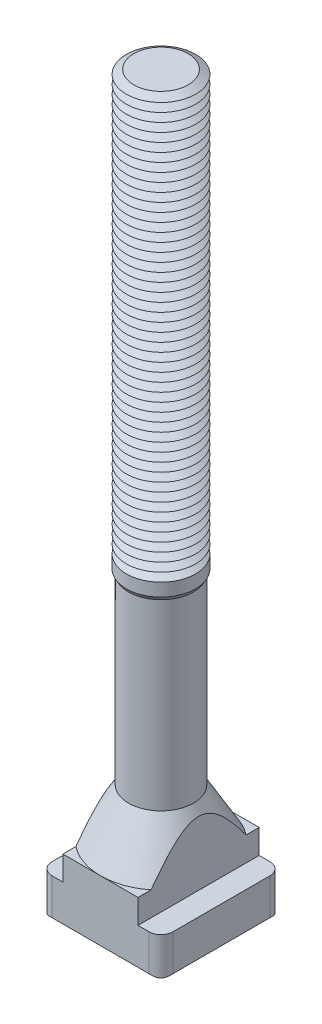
ISO-10303-21;
HEADER;
FILE_DESCRIPTION(('STEP AP214'),'2;1');
FILE_NAME('part.step','',(''),(''),'','','');
FILE_SCHEMA(('AUTOMOTIVE_DESIGN { 1 0 10303 214 1 1 1 1 }'));
ENDSEC;
DATA;
#1=APPLICATION_CONTEXT('core data for automotive mechanical design processes');
#2=APPLICATION_PROTOCOL_DEFINITION('international standard','automotive_design',2000,#1);
#3=PRODUCT_CONTEXT('',#1,'mechanical');
#4=PRODUCT('Part','Part','',(#3));
#5=PRODUCT_RELATED_PRODUCT_CATEGORY('part','',(#4));
#6=PRODUCT_DEFINITION_FORMATION('','',#4);
#7=PRODUCT_DEFINITION_CONTEXT('part definition',#1,'design');
#8=PRODUCT_DEFINITION('design','',#6,#7);
#9=PRODUCT_DEFINITION_SHAPE('','',#8);
#10=(LENGTH_UNIT() NAMED_UNIT(*) SI_UNIT(.MILLI.,.METRE.));
#11=(NAMED_UNIT(*) PLANE_ANGLE_UNIT() SI_UNIT($,.RADIAN.));
#12=(NAMED_UNIT(*) SI_UNIT($,.STERADIAN.) SOLID_ANGLE_UNIT());
#13=UNCERTAINTY_MEASURE_WITH_UNIT(LENGTH_MEASURE(1.E-05),#10,'distance_accuracy_value','');
#14=(GEOMETRIC_REPRESENTATION_CONTEXT(3) GLOBAL_UNCERTAINTY_ASSIGNED_CONTEXT((#13)) GLOBAL_UNIT_ASSIGNED_CONTEXT((#10,
#11,#12)) REPRESENTATION_CONTEXT('',''));
#15=CARTESIAN_POINT('',(0.,0.,0.));
#16=DIRECTION('',(0.,0.,1.));
#17=DIRECTION('',(1.,0.,0.));
#18=AXIS2_PLACEMENT_3D('',#15,#16,#17);
#19=CARTESIAN_POINT('',(0.,204.,0.));
#20=DIRECTION('',(0.,-1.,0.));
#21=DIRECTION('',(0.,0.,-1.));
#22=AXIS2_PLACEMENT_3D('',#19,#20,#21);
#23=CONICAL_SURFACE('',#22,7.83493649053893,1.0471975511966);
#24=CARTESIAN_POINT('',(0.,202.75,0.));
#25=DIRECTION('',(0.,-1.,0.));
#26=DIRECTION('',(0.,0.,-1.));
#27=AXIS2_PLACEMENT_3D('',#24,#25,#26);
#28=CIRCLE('',#27,10.);
#29=CARTESIAN_POINT('',(0.,202.75,-10.));
#30=VERTEX_POINT('',#29);
#31=EDGE_CURVE('E852',#30,#30,#28,.T.);
#32=ORIENTED_EDGE('',*,*,#31,.F.);
#33=EDGE_LOOP('',(#32));
#34=FACE_BOUND('',#33,.T.);
#35=CARTESIAN_POINT('',(0.,204.,0.));
#36=DIRECTION('',(0.,-1.,0.));
#37=DIRECTION('',(0.,0.,-1.));
#38=AXIS2_PLACEMENT_3D('',#35,#36,#37);
#39=CIRCLE('',#38,7.83493649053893);
#40=CARTESIAN_POINT('',(0.,204.,-7.83493649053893));
#41=VERTEX_POINT('',#40);
#42=EDGE_CURVE('E856',#41,#41,#39,.T.);
#43=ORIENTED_EDGE('',*,*,#42,.T.);
#44=EDGE_LOOP('',(#43));
#45=FACE_BOUND('',#44,.T.);
#46=ADVANCED_FACE('F39',(#34,#45),#23,.T.);
#47=CARTESIAN_POINT('',(0.,205.25,0.));
#48=DIRECTION('',(0.,1.,0.));
#49=DIRECTION('',(0.,0.,1.));
#50=AXIS2_PLACEMENT_3D('',#47,#48,#49);
#51=CONICAL_SURFACE('',#50,10.,1.0471975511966);
#52=ORIENTED_EDGE('',*,*,#42,.F.);
#53=EDGE_LOOP('',(#52));
#54=FACE_BOUND('',#53,.T.);
#55=CARTESIAN_POINT('',(0.,205.25,0.));
#56=DIRECTION('',(0.,-1.,0.));
#57=DIRECTION('',(0.,0.,-1.));
#58=AXIS2_PLACEMENT_3D('',#55,#56,#57);
#59=CIRCLE('',#58,10.);
#60=CARTESIAN_POINT('',(0.,205.25,-10.));
#61=VERTEX_POINT('',#60);
#62=EDGE_CURVE('E860',#61,#61,#59,.T.);
#63=ORIENTED_EDGE('',*,*,#62,.T.);
#64=EDGE_LOOP('',(#63));
#65=FACE_BOUND('',#64,.T.);
#66=ADVANCED_FACE('F449',(#54,#65),#51,.T.);
#67=CARTESIAN_POINT('',(4.6456826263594,214.,0.));
#68=DIRECTION('',(0.,-1.,0.));
#69=DIRECTION('',(1.,0.,0.));
#70=AXIS2_PLACEMENT_3D('',#67,#68,#69);
#71=PLANE('',#70);
#72=CARTESIAN_POINT('',(0.,214.,0.));
#73=DIRECTION('',(0.,-1.,0.));
#74=DIRECTION('',(0.,0.,-1.));
#75=AXIS2_PLACEMENT_3D('',#72,#73,#74);
#76=CIRCLE('',#75,7.83493649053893);
#77=CARTESIAN_POINT('',(0.,214.,-7.83493649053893));
#78=VERTEX_POINT('',#77);
#79=EDGE_CURVE('E704',#78,#78,#76,.T.);
#80=ORIENTED_EDGE('',*,*,#79,.F.);
#81=EDGE_LOOP('',(#80));
#82=FACE_BOUND('',#81,.T.);
#83=ADVANCED_FACE('F455',(#82),#71,.F.);
#84=CARTESIAN_POINT('',(0.,214.,0.));
#85=DIRECTION('',(0.,-1.,0.));
#86=DIRECTION('',(0.,0.,-1.));
#87=AXIS2_PLACEMENT_3D('',#84,#85,#86);
#88=CONICAL_SURFACE('',#87,7.83493649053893,1.0471975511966);
#89=CARTESIAN_POINT('',(0.,212.75,0.));
#90=DIRECTION('',(0.,-1.,0.));
#91=DIRECTION('',(0.,0.,-1.));
#92=AXIS2_PLACEMENT_3D('',#89,#90,#91);
#93=CIRCLE('',#92,10.);
#94=CARTESIAN_POINT('',(0.,212.75,-10.));
#95=VERTEX_POINT('',#94);
#96=EDGE_CURVE('E707',#95,#95,#93,.T.);
#97=ORIENTED_EDGE('',*,*,#96,.F.);
#98=EDGE_LOOP('',(#97));
#99=FACE_BOUND('',#98,.T.);
#100=ORIENTED_EDGE('',*,*,#79,.T.);
#101=EDGE_LOOP('',(#100));
#102=FACE_BOUND('',#101,.T.);
#103=ADVANCED_FACE('F483',(#99,#102),#88,.T.);
#104=CARTESIAN_POINT('',(0.,212.75,0.));
#105=DIRECTION('',(0.,1.,0.));
#106=DIRECTION('',(0.,0.,1.));
#107=AXIS2_PLACEMENT_3D('',#104,#105,#106);
#108=CONICAL_SURFACE('',#107,10.,1.0471975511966);
#109=CARTESIAN_POINT('',(0.,211.5,0.));
#110=DIRECTION('',(0.,-1.,0.));
#111=DIRECTION('',(0.,0.,-1.));
#112=AXIS2_PLACEMENT_3D('',#109,#110,#111);
#113=CIRCLE('',#112,7.83493649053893);
#114=CARTESIAN_POINT('',(0.,211.5,-7.83493649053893));
#115=VERTEX_POINT('',#114);
#116=EDGE_CURVE('E717',#115,#115,#113,.T.);
#117=ORIENTED_EDGE('',*,*,#116,.F.);
#118=EDGE_LOOP('',(#117));
#119=FACE_BOUND('',#118,.T.);
#120=ORIENTED_EDGE('',*,*,#96,.T.);
#121=EDGE_LOOP('',(#120));
#122=FACE_BOUND('',#121,.T.);
#123=ADVANCED_FACE('F480',(#119,#122),#108,.T.);
#124=CARTESIAN_POINT('',(0.,211.5,0.));
#125=DIRECTION('',(0.,-1.,0.));
#126=DIRECTION('',(0.,0.,-1.));
#127=AXIS2_PLACEMENT_3D('',#124,#125,#126);
#128=CONICAL_SURFACE('',#127,7.83493649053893,1.0471975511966);
#129=CARTESIAN_POINT('',(0.,210.25,0.));
#130=DIRECTION('',(0.,-1.,0.));
#131=DIRECTION('',(0.,0.,-1.));
#132=AXIS2_PLACEMENT_3D('',#129,#130,#131);
#133=CIRCLE('',#132,10.);
#134=CARTESIAN_POINT('',(0.,210.25,-10.));
#135=VERTEX_POINT('',#134);
#136=EDGE_CURVE('E739',#135,#135,#133,.T.);
#137=ORIENTED_EDGE('',*,*,#136,.F.);
#138=EDGE_LOOP('',(#137));
#139=FACE_BOUND('',#138,.T.);
#140=ORIENTED_EDGE('',*,*,#116,.T.);
#141=EDGE_LOOP('',(#140));
#142=FACE_BOUND('',#141,.T.);
#143=ADVANCED_FACE('F475',(#139,#142),#128,.T.);
#144=CARTESIAN_POINT('',(0.,210.25,0.));
#145=DIRECTION('',(0.,1.,0.));
#146=DIRECTION('',(0.,0.,1.));
#147=AXIS2_PLACEMENT_3D('',#144,#145,#146);
#148=CONICAL_SURFACE('',#147,10.,1.0471975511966);
#149=CARTESIAN_POINT('',(0.,209.,0.));
#150=DIRECTION('',(0.,-1.,0.));
#151=DIRECTION('',(0.,0.,-1.));
#152=AXIS2_PLACEMENT_3D('',#149,#150,#151);
#153=CIRCLE('',#152,7.83493649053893);
#154=CARTESIAN_POINT('',(0.,209.,-7.83493649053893));
#155=VERTEX_POINT('',#154);
#156=EDGE_CURVE('E701',#155,#155,#153,.T.);
#157=ORIENTED_EDGE('',*,*,#156,.F.);
#158=EDGE_LOOP('',(#157));
#159=FACE_BOUND('',#158,.T.);
#160=ORIENTED_EDGE('',*,*,#136,.T.);
#161=EDGE_LOOP('',(#160));
#162=FACE_BOUND('',#161,.T.);
#163=ADVANCED_FACE('F472',(#159,#162),#148,.T.);
#164=CARTESIAN_POINT('',(0.,209.,0.));
#165=DIRECTION('',(0.,-1.,0.));
#166=DIRECTION('',(0.,0.,-1.));
#167=AXIS2_PLACEMENT_3D('',#164,#165,#166);
#168=CONICAL_SURFACE('',#167,7.83493649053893,1.0471975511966);
#169=CARTESIAN_POINT('',(0.,207.75,0.));
#170=DIRECTION('',(0.,-1.,0.));
#171=DIRECTION('',(0.,0.,-1.));
#172=AXIS2_PLACEMENT_3D('',#169,#170,#171);
#173=CIRCLE('',#172,10.);
#174=CARTESIAN_POINT('',(0.,207.75,-10.));
#175=VERTEX_POINT('',#174);
#176=EDGE_CURVE('E698',#175,#175,#173,.T.);
#177=ORIENTED_EDGE('',*,*,#176,.F.);
#178=EDGE_LOOP('',(#177));
#179=FACE_BOUND('',#178,.T.);
#180=ORIENTED_EDGE('',*,*,#156,.T.);
#181=EDGE_LOOP('',(#180));
#182=FACE_BOUND('',#181,.T.);
#183=ADVANCED_FACE('F466',(#179,#182),#168,.T.);
#184=CARTESIAN_POINT('',(0.,207.75,0.));
#185=DIRECTION('',(0.,1.,0.));
#186=DIRECTION('',(0.,0.,1.));
#187=AXIS2_PLACEMENT_3D('',#184,#185,#186);
#188=CONICAL_SURFACE('',#187,10.,1.0471975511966);
#189=CARTESIAN_POINT('',(0.,206.5,0.));
#190=DIRECTION('',(0.,-1.,0.));
#191=DIRECTION('',(0.,0.,-1.));
#192=AXIS2_PLACEMENT_3D('',#189,#190,#191);
#193=CIRCLE('',#192,7.83493649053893);
#194=CARTESIAN_POINT('',(0.,206.5,-7.83493649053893));
#195=VERTEX_POINT('',#194);
#196=EDGE_CURVE('E702',#195,#195,#193,.T.);
#197=ORIENTED_EDGE('',*,*,#196,.F.);
#198=EDGE_LOOP('',(#197));
#199=FACE_BOUND('',#198,.T.);
#200=ORIENTED_EDGE('',*,*,#176,.T.);
#201=EDGE_LOOP('',(#200));
#202=FACE_BOUND('',#201,.T.);
#203=ADVANCED_FACE('F462',(#199,#202),#188,.T.);
#204=CARTESIAN_POINT('',(0.,206.5,0.));
#205=DIRECTION('',(0.,-1.,0.));
#206=DIRECTION('',(0.,0.,-1.));
#207=AXIS2_PLACEMENT_3D('',#204,#205,#206);
#208=CONICAL_SURFACE('',#207,7.83493649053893,1.0471975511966);
#209=ORIENTED_EDGE('',*,*,#62,.F.);
#210=EDGE_LOOP('',(#209));
#211=FACE_BOUND('',#210,.T.);
#212=ORIENTED_EDGE('',*,*,#196,.T.);
#213=EDGE_LOOP('',(#212));
#214=FACE_BOUND('',#213,.T.);
#215=ADVANCED_FACE('F465',(#211,#214),#208,.T.);
#216=CARTESIAN_POINT('',(0.,201.5,0.));
#217=DIRECTION('',(0.,-1.,0.));
#218=DIRECTION('',(0.,0.,-1.));
#219=AXIS2_PLACEMENT_3D('',#216,#217,#218);
#220=CONICAL_SURFACE('',#219,7.83493649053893,1.0471975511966);
#221=CARTESIAN_POINT('',(0.,200.25,0.));
#222=DIRECTION('',(0.,-1.,0.));
#223=DIRECTION('',(0.,0.,-1.));
#224=AXIS2_PLACEMENT_3D('',#221,#222,#223);
#225=CIRCLE('',#224,10.);
#226=CARTESIAN_POINT('',(0.,200.25,-10.));
#227=VERTEX_POINT('',#226);
#228=EDGE_CURVE('E844',#227,#227,#225,.T.);
#229=ORIENTED_EDGE('',*,*,#228,.F.);
#230=EDGE_LOOP('',(#229));
#231=FACE_BOUND('',#230,.T.);
#232=CARTESIAN_POINT('',(0.,201.5,0.));
#233=DIRECTION('',(0.,-1.,0.));
#234=DIRECTION('',(0.,0.,-1.));
#235=AXIS2_PLACEMENT_3D('',#232,#233,#234);
#236=CIRCLE('',#235,7.83493649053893);
#237=CARTESIAN_POINT('',(0.,201.5,-7.83493649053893));
#238=VERTEX_POINT('',#237);
#239=EDGE_CURVE('E848',#238,#238,#236,.T.);
#240=ORIENTED_EDGE('',*,*,#239,.T.);
#241=EDGE_LOOP('',(#240));
#242=FACE_BOUND('',#241,.T.);
#243=ADVANCED_FACE('F470',(#231,#242),#220,.T.);
#244=CARTESIAN_POINT('',(0.,202.75,0.));
#245=DIRECTION('',(0.,1.,0.));
#246=DIRECTION('',(0.,0.,1.));
#247=AXIS2_PLACEMENT_3D('',#244,#245,#246);
#248=CONICAL_SURFACE('',#247,10.,1.0471975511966);
#249=ORIENTED_EDGE('',*,*,#239,.F.);
#250=EDGE_LOOP('',(#249));
#251=FACE_BOUND('',#250,.T.);
#252=ORIENTED_EDGE('',*,*,#31,.T.);
#253=EDGE_LOOP('',(#252));
#254=FACE_BOUND('',#253,.T.);
#255=ADVANCED_FACE('F1044',(#251,#254),#248,.T.);
#256=CARTESIAN_POINT('',(0.,199.,0.));
#257=DIRECTION('',(0.,-1.,0.));
#258=DIRECTION('',(0.,0.,-1.));
#259=AXIS2_PLACEMENT_3D('',#256,#257,#258);
#260=CONICAL_SURFACE('',#259,7.83493649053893,1.0471975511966);
#261=CARTESIAN_POINT('',(0.,197.75,0.));
#262=DIRECTION('',(0.,-1.,0.));
#263=DIRECTION('',(0.,0.,-1.));
#264=AXIS2_PLACEMENT_3D('',#261,#262,#263);
#265=CIRCLE('',#264,10.);
#266=CARTESIAN_POINT('',(0.,197.75,-10.));
#267=VERTEX_POINT('',#266);
#268=EDGE_CURVE('E836',#267,#267,#265,.T.);
#269=ORIENTED_EDGE('',*,*,#268,.F.);
#270=EDGE_LOOP('',(#269));
#271=FACE_BOUND('',#270,.T.);
#272=CARTESIAN_POINT('',(0.,199.,0.));
#273=DIRECTION('',(0.,-1.,0.));
#274=DIRECTION('',(0.,0.,-1.));
#275=AXIS2_PLACEMENT_3D('',#272,#273,#274);
#276=CIRCLE('',#275,7.83493649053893);
#277=CARTESIAN_POINT('',(0.,199.,-7.83493649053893));
#278=VERTEX_POINT('',#277);
#279=EDGE_CURVE('E840',#278,#278,#276,.T.);
#280=ORIENTED_EDGE('',*,*,#279,.T.);
#281=EDGE_LOOP('',(#280));
#282=FACE_BOUND('',#281,.T.);
#283=ADVANCED_FACE('F1040',(#271,#282),#260,.T.);
#284=CARTESIAN_POINT('',(0.,200.25,0.));
#285=DIRECTION('',(0.,1.,0.));
#286=DIRECTION('',(0.,0.,1.));
#287=AXIS2_PLACEMENT_3D('',#284,#285,#286);
#288=CONICAL_SURFACE('',#287,10.,1.0471975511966);
#289=ORIENTED_EDGE('',*,*,#279,.F.);
#290=EDGE_LOOP('',(#289));
#291=FACE_BOUND('',#290,.T.);
#292=ORIENTED_EDGE('',*,*,#228,.T.);
#293=EDGE_LOOP('',(#292));
#294=FACE_BOUND('',#293,.T.);
#295=ADVANCED_FACE('F1036',(#291,#294),#288,.T.);
#296=CARTESIAN_POINT('',(0.,196.5,0.));
#297=DIRECTION('',(0.,-1.,0.));
#298=DIRECTION('',(0.,0.,-1.));
#299=AXIS2_PLACEMENT_3D('',#296,#297,#298);
#300=CONICAL_SURFACE('',#299,7.83493649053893,1.0471975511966);
#301=CARTESIAN_POINT('',(0.,195.25,0.));
#302=DIRECTION('',(0.,-1.,0.));
#303=DIRECTION('',(0.,0.,-1.));
#304=AXIS2_PLACEMENT_3D('',#301,#302,#303);
#305=CIRCLE('',#304,10.);
#306=CARTESIAN_POINT('',(0.,195.25,-10.));
#307=VERTEX_POINT('',#306);
#308=EDGE_CURVE('E828',#307,#307,#305,.T.);
#309=ORIENTED_EDGE('',*,*,#308,.F.);
#310=EDGE_LOOP('',(#309));
#311=FACE_BOUND('',#310,.T.);
#312=CARTESIAN_POINT('',(0.,196.5,0.));
#313=DIRECTION('',(0.,-1.,0.));
#314=DIRECTION('',(0.,0.,-1.));
#315=AXIS2_PLACEMENT_3D('',#312,#313,#314);
#316=CIRCLE('',#315,7.83493649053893);
#317=CARTESIAN_POINT('',(0.,196.5,-7.83493649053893));
#318=VERTEX_POINT('',#317);
#319=EDGE_CURVE('E832',#318,#318,#316,.T.);
#320=ORIENTED_EDGE('',*,*,#319,.T.);
#321=EDGE_LOOP('',(#320));
#322=FACE_BOUND('',#321,.T.);
#323=ADVANCED_FACE('F1032',(#311,#322),#300,.T.);
#324=CARTESIAN_POINT('',(0.,197.75,0.));
#325=DIRECTION('',(0.,1.,0.));
#326=DIRECTION('',(0.,0.,1.));
#327=AXIS2_PLACEMENT_3D('',#324,#325,#326);
#328=CONICAL_SURFACE('',#327,10.,1.0471975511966);
#329=ORIENTED_EDGE('',*,*,#319,.F.);
#330=EDGE_LOOP('',(#329));
#331=FACE_BOUND('',#330,.T.);
#332=ORIENTED_EDGE('',*,*,#268,.T.);
#333=EDGE_LOOP('',(#332));
#334=FACE_BOUND('',#333,.T.);
#335=ADVANCED_FACE('F1028',(#331,#334),#328,.T.);
#336=CARTESIAN_POINT('',(0.,194.,0.));
#337=DIRECTION('',(0.,-1.,0.));
#338=DIRECTION('',(0.,0.,-1.));
#339=AXIS2_PLACEMENT_3D('',#336,#337,#338);
#340=CONICAL_SURFACE('',#339,7.83493649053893,1.0471975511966);
#341=CARTESIAN_POINT('',(0.,192.75,0.));
#342=DIRECTION('',(0.,-1.,0.));
#343=DIRECTION('',(0.,0.,-1.));
#344=AXIS2_PLACEMENT_3D('',#341,#342,#343);
#345=CIRCLE('',#344,10.);
#346=CARTESIAN_POINT('',(0.,192.75,-10.));
#347=VERTEX_POINT('',#346);
#348=EDGE_CURVE('E820',#347,#347,#345,.T.);
#349=ORIENTED_EDGE('',*,*,#348,.F.);
#350=EDGE_LOOP('',(#349));
#351=FACE_BOUND('',#350,.T.);
#352=CARTESIAN_POINT('',(0.,194.,0.));
#353=DIRECTION('',(0.,-1.,0.));
#354=DIRECTION('',(0.,0.,-1.));
#355=AXIS2_PLACEMENT_3D('',#352,#353,#354);
#356=CIRCLE('',#355,7.83493649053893);
#357=CARTESIAN_POINT('',(0.,194.,-7.83493649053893));
#358=VERTEX_POINT('',#357);
#359=EDGE_CURVE('E824',#358,#358,#356,.T.);
#360=ORIENTED_EDGE('',*,*,#359,.T.);
#361=EDGE_LOOP('',(#360));
#362=FACE_BOUND('',#361,.T.);
#363=ADVANCED_FACE('F1024',(#351,#362),#340,.T.);
#364=CARTESIAN_POINT('',(0.,195.25,0.));
#365=DIRECTION('',(0.,1.,0.));
#366=DIRECTION('',(0.,0.,1.));
#367=AXIS2_PLACEMENT_3D('',#364,#365,#366);
#368=CONICAL_SURFACE('',#367,10.,1.0471975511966);
#369=ORIENTED_EDGE('',*,*,#359,.F.);
#370=EDGE_LOOP('',(#369));
#371=FACE_BOUND('',#370,.T.);
#372=ORIENTED_EDGE('',*,*,#308,.T.);
#373=EDGE_LOOP('',(#372));
#374=FACE_BOUND('',#373,.T.);
#375=ADVANCED_FACE('F1020',(#371,#374),#368,.T.);
#376=CARTESIAN_POINT('',(0.,191.5,0.));
#377=DIRECTION('',(0.,-1.,0.));
#378=DIRECTION('',(0.,0.,-1.));
#379=AXIS2_PLACEMENT_3D('',#376,#377,#378);
#380=CONICAL_SURFACE('',#379,7.83493649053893,1.0471975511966);
#381=CARTESIAN_POINT('',(0.,190.25,0.));
#382=DIRECTION('',(0.,-1.,0.));
#383=DIRECTION('',(0.,0.,-1.));
#384=AXIS2_PLACEMENT_3D('',#381,#382,#383);
#385=CIRCLE('',#384,10.);
#386=CARTESIAN_POINT('',(0.,190.25,-10.));
#387=VERTEX_POINT('',#386);
#388=EDGE_CURVE('E812',#387,#387,#385,.T.);
#389=ORIENTED_EDGE('',*,*,#388,.F.);
#390=EDGE_LOOP('',(#389));
#391=FACE_BOUND('',#390,.T.);
#392=CARTESIAN_POINT('',(0.,191.5,0.));
#393=DIRECTION('',(0.,-1.,0.));
#394=DIRECTION('',(0.,0.,-1.));
#395=AXIS2_PLACEMENT_3D('',#392,#393,#394);
#396=CIRCLE('',#395,7.83493649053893);
#397=CARTESIAN_POINT('',(0.,191.5,-7.83493649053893));
#398=VERTEX_POINT('',#397);
#399=EDGE_CURVE('E816',#398,#398,#396,.T.);
#400=ORIENTED_EDGE('',*,*,#399,.T.);
#401=EDGE_LOOP('',(#400));
#402=FACE_BOUND('',#401,.T.);
#403=ADVANCED_FACE('F1016',(#391,#402),#380,.T.);
#404=CARTESIAN_POINT('',(0.,192.75,0.));
#405=DIRECTION('',(0.,1.,0.));
#406=DIRECTION('',(0.,0.,1.));
#407=AXIS2_PLACEMENT_3D('',#404,#405,#406);
#408=CONICAL_SURFACE('',#407,10.,1.0471975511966);
#409=ORIENTED_EDGE('',*,*,#399,.F.);
#410=EDGE_LOOP('',(#409));
#411=FACE_BOUND('',#410,.T.);
#412=ORIENTED_EDGE('',*,*,#348,.T.);
#413=EDGE_LOOP('',(#412));
#414=FACE_BOUND('',#413,.T.);
#415=ADVANCED_FACE('F1012',(#411,#414),#408,.T.);
#416=CARTESIAN_POINT('',(0.,189.,0.));
#417=DIRECTION('',(0.,-1.,0.));
#418=DIRECTION('',(0.,0.,-1.));
#419=AXIS2_PLACEMENT_3D('',#416,#417,#418);
#420=CONICAL_SURFACE('',#419,7.83493649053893,1.0471975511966);
#421=CARTESIAN_POINT('',(0.,187.75,0.));
#422=DIRECTION('',(0.,-1.,0.));
#423=DIRECTION('',(0.,0.,-1.));
#424=AXIS2_PLACEMENT_3D('',#421,#422,#423);
#425=CIRCLE('',#424,10.);
#426=CARTESIAN_POINT('',(0.,187.75,-10.));
#427=VERTEX_POINT('',#426);
#428=EDGE_CURVE('E804',#427,#427,#425,.T.);
#429=ORIENTED_EDGE('',*,*,#428,.F.);
#430=EDGE_LOOP('',(#429));
#431=FACE_BOUND('',#430,.T.);
#432=CARTESIAN_POINT('',(0.,189.,0.));
#433=DIRECTION('',(0.,-1.,0.));
#434=DIRECTION('',(0.,0.,-1.));
#435=AXIS2_PLACEMENT_3D('',#432,#433,#434);
#436=CIRCLE('',#435,7.83493649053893);
#437=CARTESIAN_POINT('',(0.,189.,-7.83493649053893));
#438=VERTEX_POINT('',#437);
#439=EDGE_CURVE('E808',#438,#438,#436,.T.);
#440=ORIENTED_EDGE('',*,*,#439,.T.);
#441=EDGE_LOOP('',(#440));
#442=FACE_BOUND('',#441,.T.);
#443=ADVANCED_FACE('F1008',(#431,#442),#420,.T.);
#444=CARTESIAN_POINT('',(0.,190.25,0.));
#445=DIRECTION('',(0.,1.,0.));
#446=DIRECTION('',(0.,0.,1.));
#447=AXIS2_PLACEMENT_3D('',#444,#445,#446);
#448=CONICAL_SURFACE('',#447,10.,1.0471975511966);
#449=ORIENTED_EDGE('',*,*,#439,.F.);
#450=EDGE_LOOP('',(#449));
#451=FACE_BOUND('',#450,.T.);
#452=ORIENTED_EDGE('',*,*,#388,.T.);
#453=EDGE_LOOP('',(#452));
#454=FACE_BOUND('',#453,.T.);
#455=ADVANCED_FACE('F1004',(#451,#454),#448,.T.);
#456=CARTESIAN_POINT('',(0.,186.5,0.));
#457=DIRECTION('',(0.,-1.,0.));
#458=DIRECTION('',(0.,0.,-1.));
#459=AXIS2_PLACEMENT_3D('',#456,#457,#458);
#460=CONICAL_SURFACE('',#459,7.83493649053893,1.0471975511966);
#461=CARTESIAN_POINT('',(0.,185.25,0.));
#462=DIRECTION('',(0.,-1.,0.));
#463=DIRECTION('',(0.,0.,-1.));
#464=AXIS2_PLACEMENT_3D('',#461,#462,#463);
#465=CIRCLE('',#464,10.);
#466=CARTESIAN_POINT('',(0.,185.25,-10.));
#467=VERTEX_POINT('',#466);
#468=EDGE_CURVE('E669',#467,#467,#465,.T.);
#469=ORIENTED_EDGE('',*,*,#468,.F.);
#470=EDGE_LOOP('',(#469));
#471=FACE_BOUND('',#470,.T.);
#472=CARTESIAN_POINT('',(0.,186.5,0.));
#473=DIRECTION('',(0.,-1.,0.));
#474=DIRECTION('',(0.,0.,-1.));
#475=AXIS2_PLACEMENT_3D('',#472,#473,#474);
#476=CIRCLE('',#475,7.83493649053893);
#477=CARTESIAN_POINT('',(0.,186.5,-7.83493649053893));
#478=VERTEX_POINT('',#477);
#479=EDGE_CURVE('E671',#478,#478,#476,.T.);
#480=ORIENTED_EDGE('',*,*,#479,.T.);
#481=EDGE_LOOP('',(#480));
#482=FACE_BOUND('',#481,.T.);
#483=ADVANCED_FACE('F1000',(#471,#482),#460,.T.);
#484=CARTESIAN_POINT('',(0.,187.75,0.));
#485=DIRECTION('',(0.,1.,0.));
#486=DIRECTION('',(0.,0.,1.));
#487=AXIS2_PLACEMENT_3D('',#484,#485,#486);
#488=CONICAL_SURFACE('',#487,10.,1.0471975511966);
#489=ORIENTED_EDGE('',*,*,#479,.F.);
#490=EDGE_LOOP('',(#489));
#491=FACE_BOUND('',#490,.T.);
#492=ORIENTED_EDGE('',*,*,#428,.T.);
#493=EDGE_LOOP('',(#492));
#494=FACE_BOUND('',#493,.T.);
#495=ADVANCED_FACE('F996',(#491,#494),#488,.T.);
#496=CARTESIAN_POINT('',(0.,184.,0.));
#497=DIRECTION('',(0.,-1.,0.));
#498=DIRECTION('',(0.,0.,-1.));
#499=AXIS2_PLACEMENT_3D('',#496,#497,#498);
#500=CONICAL_SURFACE('',#499,7.83493649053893,1.0471975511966);
#501=CARTESIAN_POINT('',(0.,182.75,0.));
#502=DIRECTION('',(0.,-1.,0.));
#503=DIRECTION('',(0.,0.,-1.));
#504=AXIS2_PLACEMENT_3D('',#501,#502,#503);
#505=CIRCLE('',#504,10.);
#506=CARTESIAN_POINT('',(0.,182.75,-10.));
#507=VERTEX_POINT('',#506);
#508=EDGE_CURVE('E776',#507,#507,#505,.T.);
#509=ORIENTED_EDGE('',*,*,#508,.F.);
#510=EDGE_LOOP('',(#509));
#511=FACE_BOUND('',#510,.T.);
#512=CARTESIAN_POINT('',(0.,184.,0.));
#513=DIRECTION('',(0.,-1.,0.));
#514=DIRECTION('',(0.,0.,-1.));
#515=AXIS2_PLACEMENT_3D('',#512,#513,#514);
#516=CIRCLE('',#515,7.83493649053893);
#517=CARTESIAN_POINT('',(0.,184.,-7.83493649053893));
#518=VERTEX_POINT('',#517);
#519=EDGE_CURVE('E672',#518,#518,#516,.T.);
#520=ORIENTED_EDGE('',*,*,#519,.T.);
#521=EDGE_LOOP('',(#520));
#522=FACE_BOUND('',#521,.T.);
#523=ADVANCED_FACE('F992',(#511,#522),#500,.T.);
#524=CARTESIAN_POINT('',(0.,185.25,0.));
#525=DIRECTION('',(0.,1.,0.));
#526=DIRECTION('',(0.,0.,1.));
#527=AXIS2_PLACEMENT_3D('',#524,#525,#526);
#528=CONICAL_SURFACE('',#527,10.,1.0471975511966);
#529=ORIENTED_EDGE('',*,*,#519,.F.);
#530=EDGE_LOOP('',(#529));
#531=FACE_BOUND('',#530,.T.);
#532=ORIENTED_EDGE('',*,*,#468,.T.);
#533=EDGE_LOOP('',(#532));
#534=FACE_BOUND('',#533,.T.);
#535=ADVANCED_FACE('F978',(#531,#534),#528,.T.);
#536=CARTESIAN_POINT('',(0.,181.5,0.));
#537=DIRECTION('',(0.,-1.,0.));
#538=DIRECTION('',(0.,0.,-1.));
#539=AXIS2_PLACEMENT_3D('',#536,#537,#538);
#540=CONICAL_SURFACE('',#539,7.83493649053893,1.0471975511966);
#541=CARTESIAN_POINT('',(0.,180.25,0.));
#542=DIRECTION('',(0.,-1.,0.));
#543=DIRECTION('',(0.,0.,-1.));
#544=AXIS2_PLACEMENT_3D('',#541,#542,#543);
#545=CIRCLE('',#544,10.);
#546=CARTESIAN_POINT('',(0.,180.25,-10.));
#547=VERTEX_POINT('',#546);
#548=EDGE_CURVE('E777',#547,#547,#545,.T.);
#549=ORIENTED_EDGE('',*,*,#548,.F.);
#550=EDGE_LOOP('',(#549));
#551=FACE_BOUND('',#550,.T.);
#552=CARTESIAN_POINT('',(0.,181.5,0.));
#553=DIRECTION('',(0.,-1.,0.));
#554=DIRECTION('',(0.,0.,-1.));
#555=AXIS2_PLACEMENT_3D('',#552,#553,#554);
#556=CIRCLE('',#555,7.83493649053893);
#557=CARTESIAN_POINT('',(0.,181.5,-7.83493649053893));
#558=VERTEX_POINT('',#557);
#559=EDGE_CURVE('E774',#558,#558,#556,.T.);
#560=ORIENTED_EDGE('',*,*,#559,.T.);
#561=EDGE_LOOP('',(#560));
#562=FACE_BOUND('',#561,.T.);
#563=ADVANCED_FACE('F974',(#551,#562),#540,.T.);
#564=CARTESIAN_POINT('',(0.,182.75,0.));
#565=DIRECTION('',(0.,1.,0.));
#566=DIRECTION('',(0.,0.,1.));
#567=AXIS2_PLACEMENT_3D('',#564,#565,#566);
#568=CONICAL_SURFACE('',#567,10.,1.0471975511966);
#569=ORIENTED_EDGE('',*,*,#559,.F.);
#570=EDGE_LOOP('',(#569));
#571=FACE_BOUND('',#570,.T.);
#572=ORIENTED_EDGE('',*,*,#508,.T.);
#573=EDGE_LOOP('',(#572));
#574=FACE_BOUND('',#573,.T.);
#575=ADVANCED_FACE('F977',(#571,#574),#568,.T.);
#576=CARTESIAN_POINT('',(0.,179.,0.));
#577=DIRECTION('',(0.,-1.,0.));
#578=DIRECTION('',(0.,0.,-1.));
#579=AXIS2_PLACEMENT_3D('',#576,#577,#578);
#580=CONICAL_SURFACE('',#579,7.83493649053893,1.0471975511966);
#581=CARTESIAN_POINT('',(0.,177.75,0.));
#582=DIRECTION('',(0.,-1.,0.));
#583=DIRECTION('',(0.,0.,-1.));
#584=AXIS2_PLACEMENT_3D('',#581,#582,#583);
#585=CIRCLE('',#584,10.);
#586=CARTESIAN_POINT('',(0.,177.75,-10.));
#587=VERTEX_POINT('',#586);
#588=EDGE_CURVE('E957',#587,#587,#585,.T.);
#589=ORIENTED_EDGE('',*,*,#588,.F.);
#590=EDGE_LOOP('',(#589));
#591=FACE_BOUND('',#590,.T.);
#592=CARTESIAN_POINT('',(0.,179.,0.));
#593=DIRECTION('',(0.,-1.,0.));
#594=DIRECTION('',(0.,0.,-1.));
#595=AXIS2_PLACEMENT_3D('',#592,#593,#594);
#596=CIRCLE('',#595,7.83493649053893);
#597=CARTESIAN_POINT('',(0.,179.,-7.83493649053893));
#598=VERTEX_POINT('',#597);
#599=EDGE_CURVE('E897',#598,#598,#596,.T.);
#600=ORIENTED_EDGE('',*,*,#599,.T.);
#601=EDGE_LOOP('',(#600));
#602=FACE_BOUND('',#601,.T.);
#603=ADVANCED_FACE('F965',(#591,#602),#580,.T.);
#604=CARTESIAN_POINT('',(0.,180.25,0.));
#605=DIRECTION('',(0.,1.,0.));
#606=DIRECTION('',(0.,0.,1.));
#607=AXIS2_PLACEMENT_3D('',#604,#605,#606);
#608=CONICAL_SURFACE('',#607,10.,1.0471975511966);
#609=ORIENTED_EDGE('',*,*,#599,.F.);
#610=EDGE_LOOP('',(#609));
#611=FACE_BOUND('',#610,.T.);
#612=ORIENTED_EDGE('',*,*,#548,.T.);
#613=EDGE_LOOP('',(#612));
#614=FACE_BOUND('',#613,.T.);
#615=ADVANCED_FACE('F967',(#611,#614),#608,.T.);
#616=CARTESIAN_POINT('',(0.,176.5,0.));
#617=DIRECTION('',(0.,-1.,0.));
#618=DIRECTION('',(0.,0.,-1.));
#619=AXIS2_PLACEMENT_3D('',#616,#617,#618);
#620=CONICAL_SURFACE('',#619,7.83493649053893,1.0471975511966);
#621=CARTESIAN_POINT('',(0.,175.25,0.));
#622=DIRECTION('',(0.,-1.,0.));
#623=DIRECTION('',(0.,0.,-1.));
#624=AXIS2_PLACEMENT_3D('',#621,#622,#623);
#625=CIRCLE('',#624,10.);
#626=CARTESIAN_POINT('',(0.,175.25,-10.));
#627=VERTEX_POINT('',#626);
#628=EDGE_CURVE('E692',#627,#627,#625,.T.);
#629=ORIENTED_EDGE('',*,*,#628,.F.);
#630=EDGE_LOOP('',(#629));
#631=FACE_BOUND('',#630,.T.);
#632=CARTESIAN_POINT('',(0.,176.5,0.));
#633=DIRECTION('',(0.,-1.,0.));
#634=DIRECTION('',(0.,0.,-1.));
#635=AXIS2_PLACEMENT_3D('',#632,#633,#634);
#636=CIRCLE('',#635,7.83493649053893);
#637=CARTESIAN_POINT('',(0.,176.5,-7.83493649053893));
#638=VERTEX_POINT('',#637);
#639=EDGE_CURVE('E695',#638,#638,#636,.T.);
#640=ORIENTED_EDGE('',*,*,#639,.T.);
#641=EDGE_LOOP('',(#640));
#642=FACE_BOUND('',#641,.T.);
#643=ADVANCED_FACE('F970',(#631,#642),#620,.T.);
#644=CARTESIAN_POINT('',(0.,177.75,0.));
#645=DIRECTION('',(0.,1.,0.));
#646=DIRECTION('',(0.,0.,1.));
#647=AXIS2_PLACEMENT_3D('',#644,#645,#646);
#648=CONICAL_SURFACE('',#647,10.,1.0471975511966);
#649=ORIENTED_EDGE('',*,*,#639,.F.);
#650=EDGE_LOOP('',(#649));
#651=FACE_BOUND('',#650,.T.);
#652=ORIENTED_EDGE('',*,*,#588,.T.);
#653=EDGE_LOOP('',(#652));
#654=FACE_BOUND('',#653,.T.);
#655=ADVANCED_FACE('F1127',(#651,#654),#648,.T.);
#656=CARTESIAN_POINT('',(0.,174.,0.));
#657=DIRECTION('',(0.,-1.,0.));
#658=DIRECTION('',(0.,0.,-1.));
#659=AXIS2_PLACEMENT_3D('',#656,#657,#658);
#660=CONICAL_SURFACE('',#659,7.83493649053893,1.0471975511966);
#661=CARTESIAN_POINT('',(0.,172.75,0.));
#662=DIRECTION('',(0.,-1.,0.));
#663=DIRECTION('',(0.,0.,-1.));
#664=AXIS2_PLACEMENT_3D('',#661,#662,#663);
#665=CIRCLE('',#664,10.);
#666=CARTESIAN_POINT('',(0.,172.75,-10.));
#667=VERTEX_POINT('',#666);
#668=EDGE_CURVE('E894',#667,#667,#665,.T.);
#669=ORIENTED_EDGE('',*,*,#668,.F.);
#670=EDGE_LOOP('',(#669));
#671=FACE_BOUND('',#670,.T.);
#672=CARTESIAN_POINT('',(0.,174.,0.));
#673=DIRECTION('',(0.,-1.,0.));
#674=DIRECTION('',(0.,0.,-1.));
#675=AXIS2_PLACEMENT_3D('',#672,#673,#674);
#676=CIRCLE('',#675,7.83493649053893);
#677=CARTESIAN_POINT('',(0.,174.,-7.83493649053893));
#678=VERTEX_POINT('',#677);
#679=EDGE_CURVE('E696',#678,#678,#676,.T.);
#680=ORIENTED_EDGE('',*,*,#679,.T.);
#681=EDGE_LOOP('',(#680));
#682=FACE_BOUND('',#681,.T.);
#683=ADVANCED_FACE('F1136',(#671,#682),#660,.T.);
#684=CARTESIAN_POINT('',(0.,175.25,0.));
#685=DIRECTION('',(0.,1.,0.));
#686=DIRECTION('',(0.,0.,1.));
#687=AXIS2_PLACEMENT_3D('',#684,#685,#686);
#688=CONICAL_SURFACE('',#687,10.,1.0471975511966);
#689=ORIENTED_EDGE('',*,*,#679,.F.);
#690=EDGE_LOOP('',(#689));
#691=FACE_BOUND('',#690,.T.);
#692=ORIENTED_EDGE('',*,*,#628,.T.);
#693=EDGE_LOOP('',(#692));
#694=FACE_BOUND('',#693,.T.);
#695=ADVANCED_FACE('F1145',(#691,#694),#688,.T.);
#696=CARTESIAN_POINT('',(0.,171.5,0.));
#697=DIRECTION('',(0.,-1.,0.));
#698=DIRECTION('',(0.,0.,-1.));
#699=AXIS2_PLACEMENT_3D('',#696,#697,#698);
#700=CONICAL_SURFACE('',#699,7.83493649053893,1.0471975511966);
#701=CARTESIAN_POINT('',(0.,170.25,0.));
#702=DIRECTION('',(0.,-1.,0.));
#703=DIRECTION('',(0.,0.,-1.));
#704=AXIS2_PLACEMENT_3D('',#701,#702,#703);
#705=CIRCLE('',#704,10.);
#706=CARTESIAN_POINT('',(0.,170.25,-10.));
#707=VERTEX_POINT('',#706);
#708=EDGE_CURVE('E768',#707,#707,#705,.T.);
#709=ORIENTED_EDGE('',*,*,#708,.F.);
#710=EDGE_LOOP('',(#709));
#711=FACE_BOUND('',#710,.T.);
#712=CARTESIAN_POINT('',(0.,171.5,0.));
#713=DIRECTION('',(0.,-1.,0.));
#714=DIRECTION('',(0.,0.,-1.));
#715=AXIS2_PLACEMENT_3D('',#712,#713,#714);
#716=CIRCLE('',#715,7.83493649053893);
#717=CARTESIAN_POINT('',(0.,171.5,-7.83493649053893));
#718=VERTEX_POINT('',#717);
#719=EDGE_CURVE('E771',#718,#718,#716,.T.);
#720=ORIENTED_EDGE('',*,*,#719,.T.);
#721=EDGE_LOOP('',(#720));
#722=FACE_BOUND('',#721,.T.);
#723=ADVANCED_FACE('F1154',(#711,#722),#700,.T.);
#724=CARTESIAN_POINT('',(0.,172.75,0.));
#725=DIRECTION('',(0.,1.,0.));
#726=DIRECTION('',(0.,0.,1.));
#727=AXIS2_PLACEMENT_3D('',#724,#725,#726);
#728=CONICAL_SURFACE('',#727,10.,1.0471975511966);
#729=ORIENTED_EDGE('',*,*,#719,.F.);
#730=EDGE_LOOP('',(#729));
#731=FACE_BOUND('',#730,.T.);
#732=ORIENTED_EDGE('',*,*,#668,.T.);
#733=EDGE_LOOP('',(#732));
#734=FACE_BOUND('',#733,.T.);
#735=ADVANCED_FACE('F1163',(#731,#734),#728,.T.);
#736=CARTESIAN_POINT('',(0.,169.,0.));
#737=DIRECTION('',(0.,-1.,0.));
#738=DIRECTION('',(0.,0.,-1.));
#739=AXIS2_PLACEMENT_3D('',#736,#737,#738);
#740=CONICAL_SURFACE('',#739,7.83493649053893,1.0471975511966);
#741=CARTESIAN_POINT('',(0.,167.75,0.));
#742=DIRECTION('',(0.,-1.,0.));
#743=DIRECTION('',(0.,0.,-1.));
#744=AXIS2_PLACEMENT_3D('',#741,#742,#743);
#745=CIRCLE('',#744,10.);
#746=CARTESIAN_POINT('',(0.,167.75,-10.));
#747=VERTEX_POINT('',#746);
#748=EDGE_CURVE('E736',#747,#747,#745,.T.);
#749=ORIENTED_EDGE('',*,*,#748,.F.);
#750=EDGE_LOOP('',(#749));
#751=FACE_BOUND('',#750,.T.);
#752=CARTESIAN_POINT('',(0.,169.,0.));
#753=DIRECTION('',(0.,-1.,0.));
#754=DIRECTION('',(0.,0.,-1.));
#755=AXIS2_PLACEMENT_3D('',#752,#753,#754);
#756=CIRCLE('',#755,7.83493649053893);
#757=CARTESIAN_POINT('',(0.,169.,-7.83493649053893));
#758=VERTEX_POINT('',#757);
#759=EDGE_CURVE('E772',#758,#758,#756,.T.);
#760=ORIENTED_EDGE('',*,*,#759,.T.);
#761=EDGE_LOOP('',(#760));
#762=FACE_BOUND('',#761,.T.);
#763=ADVANCED_FACE('F1172',(#751,#762),#740,.T.);
#764=CARTESIAN_POINT('',(0.,170.25,0.));
#765=DIRECTION('',(0.,1.,0.));
#766=DIRECTION('',(0.,0.,1.));
#767=AXIS2_PLACEMENT_3D('',#764,#765,#766);
#768=CONICAL_SURFACE('',#767,10.,1.0471975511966);
#769=ORIENTED_EDGE('',*,*,#759,.F.);
#770=EDGE_LOOP('',(#769));
#771=FACE_BOUND('',#770,.T.);
#772=ORIENTED_EDGE('',*,*,#708,.T.);
#773=EDGE_LOOP('',(#772));
#774=FACE_BOUND('',#773,.T.);
#775=ADVANCED_FACE('F1181',(#771,#774),#768,.T.);
#776=CARTESIAN_POINT('',(0.,166.5,0.));
#777=DIRECTION('',(0.,-1.,0.));
#778=DIRECTION('',(0.,0.,-1.));
#779=AXIS2_PLACEMENT_3D('',#776,#777,#778);
#780=CONICAL_SURFACE('',#779,7.83493649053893,1.0471975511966);
#781=CARTESIAN_POINT('',(0.,165.25,0.));
#782=DIRECTION('',(0.,-1.,0.));
#783=DIRECTION('',(0.,0.,-1.));
#784=AXIS2_PLACEMENT_3D('',#781,#782,#783);
#785=CIRCLE('',#784,10.);
#786=CARTESIAN_POINT('',(0.,165.25,-10.));
#787=VERTEX_POINT('',#786);
#788=EDGE_CURVE('E737',#787,#787,#785,.T.);
#789=ORIENTED_EDGE('',*,*,#788,.F.);
#790=EDGE_LOOP('',(#789));
#791=FACE_BOUND('',#790,.T.);
#792=CARTESIAN_POINT('',(0.,166.5,0.));
#793=DIRECTION('',(0.,-1.,0.));
#794=DIRECTION('',(0.,0.,-1.));
#795=AXIS2_PLACEMENT_3D('',#792,#793,#794);
#796=CIRCLE('',#795,7.83493649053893);
#797=CARTESIAN_POINT('',(0.,166.5,-7.83493649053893));
#798=VERTEX_POINT('',#797);
#799=EDGE_CURVE('E733',#798,#798,#796,.T.);
#800=ORIENTED_EDGE('',*,*,#799,.T.);
#801=EDGE_LOOP('',(#800));
#802=FACE_BOUND('',#801,.T.);
#803=ADVANCED_FACE('F1190',(#791,#802),#780,.T.);
#804=CARTESIAN_POINT('',(0.,167.75,0.));
#805=DIRECTION('',(0.,1.,0.));
#806=DIRECTION('',(0.,0.,1.));
#807=AXIS2_PLACEMENT_3D('',#804,#805,#806);
#808=CONICAL_SURFACE('',#807,10.,1.0471975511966);
#809=ORIENTED_EDGE('',*,*,#799,.F.);
#810=EDGE_LOOP('',(#809));
#811=FACE_BOUND('',#810,.T.);
#812=ORIENTED_EDGE('',*,*,#748,.T.);
#813=EDGE_LOOP('',(#812));
#814=FACE_BOUND('',#813,.T.);
#815=ADVANCED_FACE('F1199',(#811,#814),#808,.T.);
#816=CARTESIAN_POINT('',(0.,164.,0.));
#817=DIRECTION('',(0.,-1.,0.));
#818=DIRECTION('',(0.,0.,-1.));
#819=AXIS2_PLACEMENT_3D('',#816,#817,#818);
#820=CONICAL_SURFACE('',#819,7.83493649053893,1.0471975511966);
#821=CARTESIAN_POINT('',(0.,162.75,0.));
#822=DIRECTION('',(0.,-1.,0.));
#823=DIRECTION('',(0.,0.,-1.));
#824=AXIS2_PLACEMENT_3D('',#821,#822,#823);
#825=CIRCLE('',#824,10.);
#826=CARTESIAN_POINT('',(0.,162.75,-10.));
#827=VERTEX_POINT('',#826);
#828=EDGE_CURVE('E933',#827,#827,#825,.T.);
#829=ORIENTED_EDGE('',*,*,#828,.F.);
#830=EDGE_LOOP('',(#829));
#831=FACE_BOUND('',#830,.T.);
#832=CARTESIAN_POINT('',(0.,164.,0.));
#833=DIRECTION('',(0.,-1.,0.));
#834=DIRECTION('',(0.,0.,-1.));
#835=AXIS2_PLACEMENT_3D('',#832,#833,#834);
#836=CIRCLE('',#835,7.83493649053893);
#837=CARTESIAN_POINT('',(0.,164.,-7.83493649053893));
#838=VERTEX_POINT('',#837);
#839=EDGE_CURVE('E937',#838,#838,#836,.T.);
#840=ORIENTED_EDGE('',*,*,#839,.T.);
#841=EDGE_LOOP('',(#840));
#842=FACE_BOUND('',#841,.T.);
#843=ADVANCED_FACE('F1208',(#831,#842),#820,.T.);
#844=CARTESIAN_POINT('',(0.,165.25,0.));
#845=DIRECTION('',(0.,1.,0.));
#846=DIRECTION('',(0.,0.,1.));
#847=AXIS2_PLACEMENT_3D('',#844,#845,#846);
#848=CONICAL_SURFACE('',#847,10.,1.0471975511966);
#849=ORIENTED_EDGE('',*,*,#839,.F.);
#850=EDGE_LOOP('',(#849));
#851=FACE_BOUND('',#850,.T.);
#852=ORIENTED_EDGE('',*,*,#788,.T.);
#853=EDGE_LOOP('',(#852));
#854=FACE_BOUND('',#853,.T.);
#855=ADVANCED_FACE('F1217',(#851,#854),#848,.T.);
#856=CARTESIAN_POINT('',(0.,161.5,0.));
#857=DIRECTION('',(0.,-1.,0.));
#858=DIRECTION('',(0.,0.,-1.));
#859=AXIS2_PLACEMENT_3D('',#856,#857,#858);
#860=CONICAL_SURFACE('',#859,7.83493649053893,1.0471975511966);
#861=CARTESIAN_POINT('',(0.,160.25,0.));
#862=DIRECTION('',(0.,-1.,0.));
#863=DIRECTION('',(0.,0.,-1.));
#864=AXIS2_PLACEMENT_3D('',#861,#862,#863);
#865=CIRCLE('',#864,10.);
#866=CARTESIAN_POINT('',(0.,160.25,-10.));
#867=VERTEX_POINT('',#866);
#868=EDGE_CURVE('E666',#867,#867,#865,.T.);
#869=ORIENTED_EDGE('',*,*,#868,.F.);
#870=EDGE_LOOP('',(#869));
#871=FACE_BOUND('',#870,.T.);
#872=CARTESIAN_POINT('',(0.,161.5,0.));
#873=DIRECTION('',(0.,-1.,0.));
#874=DIRECTION('',(0.,0.,-1.));
#875=AXIS2_PLACEMENT_3D('',#872,#873,#874);
#876=CIRCLE('',#875,7.83493649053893);
#877=CARTESIAN_POINT('',(0.,161.5,-7.83493649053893));
#878=VERTEX_POINT('',#877);
#879=EDGE_CURVE('E930',#878,#878,#876,.T.);
#880=ORIENTED_EDGE('',*,*,#879,.T.);
#881=EDGE_LOOP('',(#880));
#882=FACE_BOUND('',#881,.T.);
#883=ADVANCED_FACE('F1226',(#871,#882),#860,.T.);
#884=CARTESIAN_POINT('',(0.,162.75,0.));
#885=DIRECTION('',(0.,1.,0.));
#886=DIRECTION('',(0.,0.,1.));
#887=AXIS2_PLACEMENT_3D('',#884,#885,#886);
#888=CONICAL_SURFACE('',#887,10.,1.0471975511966);
#889=ORIENTED_EDGE('',*,*,#879,.F.);
#890=EDGE_LOOP('',(#889));
#891=FACE_BOUND('',#890,.T.);
#892=ORIENTED_EDGE('',*,*,#828,.T.);
#893=EDGE_LOOP('',(#892));
#894=FACE_BOUND('',#893,.T.);
#895=ADVANCED_FACE('F1235',(#891,#894),#888,.T.);
#896=CARTESIAN_POINT('',(0.,159.,0.));
#897=DIRECTION('',(0.,-1.,0.));
#898=DIRECTION('',(0.,0.,-1.));
#899=AXIS2_PLACEMENT_3D('',#896,#897,#898);
#900=CONICAL_SURFACE('',#899,7.83493649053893,1.0471975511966);
#901=CARTESIAN_POINT('',(0.,157.75,0.));
#902=DIRECTION('',(0.,-1.,0.));
#903=DIRECTION('',(0.,0.,-1.));
#904=AXIS2_PLACEMENT_3D('',#901,#902,#903);
#905=CIRCLE('',#904,10.);
#906=CARTESIAN_POINT('',(0.,157.75,-10.));
#907=VERTEX_POINT('',#906);
#908=EDGE_CURVE('E667',#907,#907,#905,.T.);
#909=ORIENTED_EDGE('',*,*,#908,.F.);
#910=EDGE_LOOP('',(#909));
#911=FACE_BOUND('',#910,.T.);
#912=CARTESIAN_POINT('',(0.,159.,0.));
#913=DIRECTION('',(0.,-1.,0.));
#914=DIRECTION('',(0.,0.,-1.));
#915=AXIS2_PLACEMENT_3D('',#912,#913,#914);
#916=CIRCLE('',#915,7.83493649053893);
#917=CARTESIAN_POINT('',(0.,159.,-7.83493649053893));
#918=VERTEX_POINT('',#917);
#919=EDGE_CURVE('E663',#918,#918,#916,.T.);
#920=ORIENTED_EDGE('',*,*,#919,.T.);
#921=EDGE_LOOP('',(#920));
#922=FACE_BOUND('',#921,.T.);
#923=ADVANCED_FACE('F1244',(#911,#922),#900,.T.);
#924=CARTESIAN_POINT('',(0.,160.25,0.));
#925=DIRECTION('',(0.,1.,0.));
#926=DIRECTION('',(0.,0.,1.));
#927=AXIS2_PLACEMENT_3D('',#924,#925,#926);
#928=CONICAL_SURFACE('',#927,10.,1.0471975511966);
#929=ORIENTED_EDGE('',*,*,#919,.F.);
#930=EDGE_LOOP('',(#929));
#931=FACE_BOUND('',#930,.T.);
#932=ORIENTED_EDGE('',*,*,#868,.T.);
#933=EDGE_LOOP('',(#932));
#934=FACE_BOUND('',#933,.T.);
#935=ADVANCED_FACE('F1253',(#931,#934),#928,.T.);
#936=CARTESIAN_POINT('',(0.,156.5,0.));
#937=DIRECTION('',(0.,-1.,0.));
#938=DIRECTION('',(0.,0.,-1.));
#939=AXIS2_PLACEMENT_3D('',#936,#937,#938);
#940=CONICAL_SURFACE('',#939,7.83493649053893,1.0471975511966);
#941=CARTESIAN_POINT('',(0.,155.25,0.));
#942=DIRECTION('',(0.,-1.,0.));
#943=DIRECTION('',(0.,0.,-1.));
#944=AXIS2_PLACEMENT_3D('',#941,#942,#943);
#945=CIRCLE('',#944,10.);
#946=CARTESIAN_POINT('',(0.,155.25,-10.));
#947=VERTEX_POINT('',#946);
#948=EDGE_CURVE('E914',#947,#947,#945,.T.);
#949=ORIENTED_EDGE('',*,*,#948,.F.);
#950=EDGE_LOOP('',(#949));
#951=FACE_BOUND('',#950,.T.);
#952=CARTESIAN_POINT('',(0.,156.5,0.));
#953=DIRECTION('',(0.,-1.,0.));
#954=DIRECTION('',(0.,0.,-1.));
#955=AXIS2_PLACEMENT_3D('',#952,#953,#954);
#956=CIRCLE('',#955,7.83493649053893);
#957=CARTESIAN_POINT('',(0.,156.5,-7.83493649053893));
#958=VERTEX_POINT('',#957);
#959=EDGE_CURVE('E911',#958,#958,#956,.T.);
#960=ORIENTED_EDGE('',*,*,#959,.T.);
#961=EDGE_LOOP('',(#960));
#962=FACE_BOUND('',#961,.T.);
#963=ADVANCED_FACE('F1262',(#951,#962),#940,.T.);
#964=CARTESIAN_POINT('',(0.,157.75,0.));
#965=DIRECTION('',(0.,1.,0.));
#966=DIRECTION('',(0.,0.,1.));
#967=AXIS2_PLACEMENT_3D('',#964,#965,#966);
#968=CONICAL_SURFACE('',#967,10.,1.0471975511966);
#969=ORIENTED_EDGE('',*,*,#959,.F.);
#970=EDGE_LOOP('',(#969));
#971=FACE_BOUND('',#970,.T.);
#972=ORIENTED_EDGE('',*,*,#908,.T.);
#973=EDGE_LOOP('',(#972));
#974=FACE_BOUND('',#973,.T.);
#975=ADVANCED_FACE('F1271',(#971,#974),#968,.T.);
#976=CARTESIAN_POINT('',(0.,154.,0.));
#977=DIRECTION('',(0.,-1.,0.));
#978=DIRECTION('',(0.,0.,-1.));
#979=AXIS2_PLACEMENT_3D('',#976,#977,#978);
#980=CONICAL_SURFACE('',#979,7.83493649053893,1.0471975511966);
#981=CARTESIAN_POINT('',(0.,152.75,0.));
#982=DIRECTION('',(0.,-1.,0.));
#983=DIRECTION('',(0.,0.,-1.));
#984=AXIS2_PLACEMENT_3D('',#981,#982,#983);
#985=CIRCLE('',#984,10.);
#986=CARTESIAN_POINT('',(0.,152.75,-10.));
#987=VERTEX_POINT('',#986);
#988=EDGE_CURVE('E660',#987,#987,#985,.T.);
#989=ORIENTED_EDGE('',*,*,#988,.F.);
#990=EDGE_LOOP('',(#989));
#991=FACE_BOUND('',#990,.T.);
#992=CARTESIAN_POINT('',(0.,154.,0.));
#993=DIRECTION('',(0.,-1.,0.));
#994=DIRECTION('',(0.,0.,-1.));
#995=AXIS2_PLACEMENT_3D('',#992,#993,#994);
#996=CIRCLE('',#995,7.83493649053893);
#997=CARTESIAN_POINT('',(0.,154.,-7.83493649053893));
#998=VERTEX_POINT('',#997);
#999=EDGE_CURVE('E790',#998,#998,#996,.T.);
#1000=ORIENTED_EDGE('',*,*,#999,.T.);
#1001=EDGE_LOOP('',(#1000));
#1002=FACE_BOUND('',#1001,.T.);
#1003=ADVANCED_FACE('F1280',(#991,#1002),#980,.T.);
#1004=CARTESIAN_POINT('',(0.,155.25,0.));
#1005=DIRECTION('',(0.,1.,0.));
#1006=DIRECTION('',(0.,0.,1.));
#1007=AXIS2_PLACEMENT_3D('',#1004,#1005,#1006);
#1008=CONICAL_SURFACE('',#1007,10.,1.0471975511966);
#1009=ORIENTED_EDGE('',*,*,#999,.F.);
#1010=EDGE_LOOP('',(#1009));
#1011=FACE_BOUND('',#1010,.T.);
#1012=ORIENTED_EDGE('',*,*,#948,.T.);
#1013=EDGE_LOOP('',(#1012));
#1014=FACE_BOUND('',#1013,.T.);
#1015=ADVANCED_FACE('F1289',(#1011,#1014),#1008,.T.);
#1016=CARTESIAN_POINT('',(0.,151.5,0.));
#1017=DIRECTION('',(0.,-1.,0.));
#1018=DIRECTION('',(0.,0.,-1.));
#1019=AXIS2_PLACEMENT_3D('',#1016,#1017,#1018);
#1020=CONICAL_SURFACE('',#1019,7.83493649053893,1.0471975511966);
#1021=CARTESIAN_POINT('',(0.,150.25,0.));
#1022=DIRECTION('',(0.,-1.,0.));
#1023=DIRECTION('',(0.,0.,-1.));
#1024=AXIS2_PLACEMENT_3D('',#1021,#1022,#1023);
#1025=CIRCLE('',#1024,10.);
#1026=CARTESIAN_POINT('',(0.,150.25,-10.));
#1027=VERTEX_POINT('',#1026);
#1028=EDGE_CURVE('E661',#1027,#1027,#1025,.T.);
#1029=ORIENTED_EDGE('',*,*,#1028,.F.);
#1030=EDGE_LOOP('',(#1029));
#1031=FACE_BOUND('',#1030,.T.);
#1032=CARTESIAN_POINT('',(0.,151.5,0.));
#1033=DIRECTION('',(0.,-1.,0.));
#1034=DIRECTION('',(0.,0.,-1.));
#1035=AXIS2_PLACEMENT_3D('',#1032,#1033,#1034);
#1036=CIRCLE('',#1035,7.83493649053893);
#1037=CARTESIAN_POINT('',(0.,151.5,-7.83493649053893));
#1038=VERTEX_POINT('',#1037);
#1039=EDGE_CURVE('E657',#1038,#1038,#1036,.T.);
#1040=ORIENTED_EDGE('',*,*,#1039,.T.);
#1041=EDGE_LOOP('',(#1040));
#1042=FACE_BOUND('',#1041,.T.);
#1043=ADVANCED_FACE('F1298',(#1031,#1042),#1020,.T.);
#1044=CARTESIAN_POINT('',(0.,152.75,0.));
#1045=DIRECTION('',(0.,1.,0.));
#1046=DIRECTION('',(0.,0.,1.));
#1047=AXIS2_PLACEMENT_3D('',#1044,#1045,#1046);
#1048=CONICAL_SURFACE('',#1047,10.,1.0471975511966);
#1049=ORIENTED_EDGE('',*,*,#1039,.F.);
#1050=EDGE_LOOP('',(#1049));
#1051=FACE_BOUND('',#1050,.T.);
#1052=ORIENTED_EDGE('',*,*,#988,.T.);
#1053=EDGE_LOOP('',(#1052));
#1054=FACE_BOUND('',#1053,.T.);
#1055=ADVANCED_FACE('F1307',(#1051,#1054),#1048,.T.);
#1056=CARTESIAN_POINT('',(0.,149.,0.));
#1057=DIRECTION('',(0.,-1.,0.));
#1058=DIRECTION('',(0.,0.,-1.));
#1059=AXIS2_PLACEMENT_3D('',#1056,#1057,#1058);
#1060=CONICAL_SURFACE('',#1059,7.83493649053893,1.0471975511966);
#1061=CARTESIAN_POINT('',(0.,147.75,0.));
#1062=DIRECTION('',(0.,-1.,0.));
#1063=DIRECTION('',(0.,0.,-1.));
#1064=AXIS2_PLACEMENT_3D('',#1061,#1062,#1063);
#1065=CIRCLE('',#1064,10.);
#1066=CARTESIAN_POINT('',(0.,147.75,-10.));
#1067=VERTEX_POINT('',#1066);
#1068=EDGE_CURVE('E890',#1067,#1067,#1065,.T.);
#1069=ORIENTED_EDGE('',*,*,#1068,.F.);
#1070=EDGE_LOOP('',(#1069));
#1071=FACE_BOUND('',#1070,.T.);
#1072=CARTESIAN_POINT('',(0.,149.,0.));
#1073=DIRECTION('',(0.,-1.,0.));
#1074=DIRECTION('',(0.,0.,-1.));
#1075=AXIS2_PLACEMENT_3D('',#1072,#1073,#1074);
#1076=CIRCLE('',#1075,7.83493649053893);
#1077=CARTESIAN_POINT('',(0.,149.,-7.83493649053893));
#1078=VERTEX_POINT('',#1077);
#1079=EDGE_CURVE('E887',#1078,#1078,#1076,.T.);
#1080=ORIENTED_EDGE('',*,*,#1079,.T.);
#1081=EDGE_LOOP('',(#1080));
#1082=FACE_BOUND('',#1081,.T.);
#1083=ADVANCED_FACE('F1316',(#1071,#1082),#1060,.T.);
#1084=CARTESIAN_POINT('',(0.,150.25,0.));
#1085=DIRECTION('',(0.,1.,0.));
#1086=DIRECTION('',(0.,0.,1.));
#1087=AXIS2_PLACEMENT_3D('',#1084,#1085,#1086);
#1088=CONICAL_SURFACE('',#1087,10.,1.0471975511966);
#1089=ORIENTED_EDGE('',*,*,#1079,.F.);
#1090=EDGE_LOOP('',(#1089));
#1091=FACE_BOUND('',#1090,.T.);
#1092=ORIENTED_EDGE('',*,*,#1028,.T.);
#1093=EDGE_LOOP('',(#1092));
#1094=FACE_BOUND('',#1093,.T.);
#1095=ADVANCED_FACE('F1325',(#1091,#1094),#1088,.T.);
#1096=CARTESIAN_POINT('',(0.,146.5,0.));
#1097=DIRECTION('',(0.,-1.,0.));
#1098=DIRECTION('',(0.,0.,-1.));
#1099=AXIS2_PLACEMENT_3D('',#1096,#1097,#1098);
#1100=CONICAL_SURFACE('',#1099,7.83493649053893,1.0471975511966);
#1101=CARTESIAN_POINT('',(0.,145.25,0.));
#1102=DIRECTION('',(0.,-1.,0.));
#1103=DIRECTION('',(0.,0.,-1.));
#1104=AXIS2_PLACEMENT_3D('',#1101,#1102,#1103);
#1105=CIRCLE('',#1104,10.);
#1106=CARTESIAN_POINT('',(0.,145.25,-10.));
#1107=VERTEX_POINT('',#1106);
#1108=EDGE_CURVE('E762',#1107,#1107,#1105,.T.);
#1109=ORIENTED_EDGE('',*,*,#1108,.F.);
#1110=EDGE_LOOP('',(#1109));
#1111=FACE_BOUND('',#1110,.T.);
#1112=CARTESIAN_POINT('',(0.,146.5,0.));
#1113=DIRECTION('',(0.,-1.,0.));
#1114=DIRECTION('',(0.,0.,-1.));
#1115=AXIS2_PLACEMENT_3D('',#1112,#1113,#1114);
#1116=CIRCLE('',#1115,7.83493649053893);
#1117=CARTESIAN_POINT('',(0.,146.5,-7.83493649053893));
#1118=VERTEX_POINT('',#1117);
#1119=EDGE_CURVE('E765',#1118,#1118,#1116,.T.);
#1120=ORIENTED_EDGE('',*,*,#1119,.T.);
#1121=EDGE_LOOP('',(#1120));
#1122=FACE_BOUND('',#1121,.T.);
#1123=ADVANCED_FACE('F1334',(#1111,#1122),#1100,.T.);
#1124=CARTESIAN_POINT('',(0.,147.75,0.));
#1125=DIRECTION('',(0.,1.,0.));
#1126=DIRECTION('',(0.,0.,1.));
#1127=AXIS2_PLACEMENT_3D('',#1124,#1125,#1126);
#1128=CONICAL_SURFACE('',#1127,10.,1.0471975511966);
#1129=ORIENTED_EDGE('',*,*,#1119,.F.);
#1130=EDGE_LOOP('',(#1129));
#1131=FACE_BOUND('',#1130,.T.);
#1132=ORIENTED_EDGE('',*,*,#1068,.T.);
#1133=EDGE_LOOP('',(#1132));
#1134=FACE_BOUND('',#1133,.T.);
#1135=ADVANCED_FACE('F1343',(#1131,#1134),#1128,.T.);
#1136=CARTESIAN_POINT('',(0.,144.,0.));
#1137=DIRECTION('',(0.,-1.,0.));
#1138=DIRECTION('',(0.,0.,-1.));
#1139=AXIS2_PLACEMENT_3D('',#1136,#1137,#1138);
#1140=CONICAL_SURFACE('',#1139,7.83493649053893,1.0471975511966);
#1141=CARTESIAN_POINT('',(0.,142.75,0.));
#1142=DIRECTION('',(0.,-1.,0.));
#1143=DIRECTION('',(0.,0.,-1.));
#1144=AXIS2_PLACEMENT_3D('',#1141,#1142,#1143);
#1145=CIRCLE('',#1144,10.);
#1146=CARTESIAN_POINT('',(0.,142.75,-10.));
#1147=VERTEX_POINT('',#1146);
#1148=EDGE_CURVE('E909',#1147,#1147,#1145,.T.);
#1149=ORIENTED_EDGE('',*,*,#1148,.F.);
#1150=EDGE_LOOP('',(#1149));
#1151=FACE_BOUND('',#1150,.T.);
#1152=CARTESIAN_POINT('',(0.,144.,0.));
#1153=DIRECTION('',(0.,-1.,0.));
#1154=DIRECTION('',(0.,0.,-1.));
#1155=AXIS2_PLACEMENT_3D('',#1152,#1153,#1154);
#1156=CIRCLE('',#1155,7.83493649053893);
#1157=CARTESIAN_POINT('',(0.,144.,-7.83493649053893));
#1158=VERTEX_POINT('',#1157);
#1159=EDGE_CURVE('E766',#1158,#1158,#1156,.T.);
#1160=ORIENTED_EDGE('',*,*,#1159,.T.);
#1161=EDGE_LOOP('',(#1160));
#1162=FACE_BOUND('',#1161,.T.);
#1163=ADVANCED_FACE('F1352',(#1151,#1162),#1140,.T.);
#1164=CARTESIAN_POINT('',(0.,145.25,0.));
#1165=DIRECTION('',(0.,1.,0.));
#1166=DIRECTION('',(0.,0.,1.));
#1167=AXIS2_PLACEMENT_3D('',#1164,#1165,#1166);
#1168=CONICAL_SURFACE('',#1167,10.,1.0471975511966);
#1169=ORIENTED_EDGE('',*,*,#1159,.F.);
#1170=EDGE_LOOP('',(#1169));
#1171=FACE_BOUND('',#1170,.T.);
#1172=ORIENTED_EDGE('',*,*,#1108,.T.);
#1173=EDGE_LOOP('',(#1172));
#1174=FACE_BOUND('',#1173,.T.);
#1175=ADVANCED_FACE('F1361',(#1171,#1174),#1168,.T.);
#1176=CARTESIAN_POINT('',(0.,141.5,0.));
#1177=DIRECTION('',(0.,-1.,0.));
#1178=DIRECTION('',(0.,0.,-1.));
#1179=AXIS2_PLACEMENT_3D('',#1176,#1177,#1178);
#1180=CONICAL_SURFACE('',#1179,7.83493649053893,1.0471975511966);
#1181=CARTESIAN_POINT('',(0.,140.25,0.));
#1182=DIRECTION('',(0.,-1.,0.));
#1183=DIRECTION('',(0.,0.,-1.));
#1184=AXIS2_PLACEMENT_3D('',#1181,#1182,#1183);
#1185=CIRCLE('',#1184,10.);
#1186=CARTESIAN_POINT('',(0.,140.25,-10.));
#1187=VERTEX_POINT('',#1186);
#1188=EDGE_CURVE('E690',#1187,#1187,#1185,.T.);
#1189=ORIENTED_EDGE('',*,*,#1188,.F.);
#1190=EDGE_LOOP('',(#1189));
#1191=FACE_BOUND('',#1190,.T.);
#1192=CARTESIAN_POINT('',(0.,141.5,0.));
#1193=DIRECTION('',(0.,-1.,0.));
#1194=DIRECTION('',(0.,0.,-1.));
#1195=AXIS2_PLACEMENT_3D('',#1192,#1193,#1194);
#1196=CIRCLE('',#1195,7.83493649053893);
#1197=CARTESIAN_POINT('',(0.,141.5,-7.83493649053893));
#1198=VERTEX_POINT('',#1197);
#1199=EDGE_CURVE('E787',#1198,#1198,#1196,.T.);
#1200=ORIENTED_EDGE('',*,*,#1199,.T.);
#1201=EDGE_LOOP('',(#1200));
#1202=FACE_BOUND('',#1201,.T.);
#1203=ADVANCED_FACE('F1370',(#1191,#1202),#1180,.T.);
#1204=CARTESIAN_POINT('',(0.,142.75,0.));
#1205=DIRECTION('',(0.,1.,0.));
#1206=DIRECTION('',(0.,0.,1.));
#1207=AXIS2_PLACEMENT_3D('',#1204,#1205,#1206);
#1208=CONICAL_SURFACE('',#1207,10.,1.0471975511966);
#1209=ORIENTED_EDGE('',*,*,#1199,.F.);
#1210=EDGE_LOOP('',(#1209));
#1211=FACE_BOUND('',#1210,.T.);
#1212=ORIENTED_EDGE('',*,*,#1148,.T.);
#1213=EDGE_LOOP('',(#1212));
#1214=FACE_BOUND('',#1213,.T.);
#1215=ADVANCED_FACE('F1379',(#1211,#1214),#1208,.T.);
#1216=CARTESIAN_POINT('',(0.,139.,0.));
#1217=DIRECTION('',(0.,-1.,0.));
#1218=DIRECTION('',(0.,0.,-1.));
#1219=AXIS2_PLACEMENT_3D('',#1216,#1217,#1218);
#1220=CONICAL_SURFACE('',#1219,7.83493649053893,1.0471975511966);
#1221=CARTESIAN_POINT('',(0.,137.75,0.));
#1222=DIRECTION('',(0.,-1.,0.));
#1223=DIRECTION('',(0.,0.,-1.));
#1224=AXIS2_PLACEMENT_3D('',#1221,#1222,#1223);
#1225=CIRCLE('',#1224,10.);
#1226=CARTESIAN_POINT('',(0.,137.75,-10.));
#1227=VERTEX_POINT('',#1226);
#1228=EDGE_CURVE('E654',#1227,#1227,#1225,.T.);
#1229=ORIENTED_EDGE('',*,*,#1228,.F.);
#1230=EDGE_LOOP('',(#1229));
#1231=FACE_BOUND('',#1230,.T.);
#1232=CARTESIAN_POINT('',(0.,139.,0.));
#1233=DIRECTION('',(0.,-1.,0.));
#1234=DIRECTION('',(0.,0.,-1.));
#1235=AXIS2_PLACEMENT_3D('',#1232,#1233,#1234);
#1236=CIRCLE('',#1235,7.83493649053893);
#1237=CARTESIAN_POINT('',(0.,139.,-7.83493649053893));
#1238=VERTEX_POINT('',#1237);
#1239=EDGE_CURVE('E687',#1238,#1238,#1236,.T.);
#1240=ORIENTED_EDGE('',*,*,#1239,.T.);
#1241=EDGE_LOOP('',(#1240));
#1242=FACE_BOUND('',#1241,.T.);
#1243=ADVANCED_FACE('F1388',(#1231,#1242),#1220,.T.);
#1244=CARTESIAN_POINT('',(0.,140.25,0.));
#1245=DIRECTION('',(0.,1.,0.));
#1246=DIRECTION('',(0.,0.,1.));
#1247=AXIS2_PLACEMENT_3D('',#1244,#1245,#1246);
#1248=CONICAL_SURFACE('',#1247,10.,1.0471975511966);
#1249=ORIENTED_EDGE('',*,*,#1239,.F.);
#1250=EDGE_LOOP('',(#1249));
#1251=FACE_BOUND('',#1250,.T.);
#1252=ORIENTED_EDGE('',*,*,#1188,.T.);
#1253=EDGE_LOOP('',(#1252));
#1254=FACE_BOUND('',#1253,.T.);
#1255=ADVANCED_FACE('F1397',(#1251,#1254),#1248,.T.);
#1256=CARTESIAN_POINT('',(0.,136.5,0.));
#1257=DIRECTION('',(0.,-1.,0.));
#1258=DIRECTION('',(0.,0.,-1.));
#1259=AXIS2_PLACEMENT_3D('',#1256,#1257,#1258);
#1260=CONICAL_SURFACE('',#1259,7.83493649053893,1.0471975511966);
#1261=CARTESIAN_POINT('',(0.,135.25,0.));
#1262=DIRECTION('',(0.,-1.,0.));
#1263=DIRECTION('',(0.,0.,-1.));
#1264=AXIS2_PLACEMENT_3D('',#1261,#1262,#1263);
#1265=CIRCLE('',#1264,10.);
#1266=CARTESIAN_POINT('',(0.,135.25,-10.));
#1267=VERTEX_POINT('',#1266);
#1268=EDGE_CURVE('E655',#1267,#1267,#1265,.T.);
#1269=ORIENTED_EDGE('',*,*,#1268,.F.);
#1270=EDGE_LOOP('',(#1269));
#1271=FACE_BOUND('',#1270,.T.);
#1272=CARTESIAN_POINT('',(0.,136.5,0.));
#1273=DIRECTION('',(0.,-1.,0.));
#1274=DIRECTION('',(0.,0.,-1.));
#1275=AXIS2_PLACEMENT_3D('',#1272,#1273,#1274);
#1276=CIRCLE('',#1275,7.83493649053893);
#1277=CARTESIAN_POINT('',(0.,136.5,-7.83493649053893));
#1278=VERTEX_POINT('',#1277);
#1279=EDGE_CURVE('E651',#1278,#1278,#1276,.T.);
#1280=ORIENTED_EDGE('',*,*,#1279,.T.);
#1281=EDGE_LOOP('',(#1280));
#1282=FACE_BOUND('',#1281,.T.);
#1283=ADVANCED_FACE('F1406',(#1271,#1282),#1260,.T.);
#1284=CARTESIAN_POINT('',(0.,137.75,0.));
#1285=DIRECTION('',(0.,1.,0.));
#1286=DIRECTION('',(0.,0.,1.));
#1287=AXIS2_PLACEMENT_3D('',#1284,#1285,#1286);
#1288=CONICAL_SURFACE('',#1287,10.,1.0471975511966);
#1289=ORIENTED_EDGE('',*,*,#1279,.F.);
#1290=EDGE_LOOP('',(#1289));
#1291=FACE_BOUND('',#1290,.T.);
#1292=ORIENTED_EDGE('',*,*,#1228,.T.);
#1293=EDGE_LOOP('',(#1292));
#1294=FACE_BOUND('',#1293,.T.);
#1295=ADVANCED_FACE('F1415',(#1291,#1294),#1288,.T.);
#1296=CARTESIAN_POINT('',(0.,134.,0.));
#1297=DIRECTION('',(0.,-1.,0.));
#1298=DIRECTION('',(0.,0.,-1.));
#1299=AXIS2_PLACEMENT_3D('',#1296,#1297,#1298);
#1300=CONICAL_SURFACE('',#1299,7.83493649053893,1.0471975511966);
#1301=CARTESIAN_POINT('',(0.,132.75,0.));
#1302=DIRECTION('',(0.,-1.,0.));
#1303=DIRECTION('',(0.,0.,-1.));
#1304=AXIS2_PLACEMENT_3D('',#1301,#1302,#1303);
#1305=CIRCLE('',#1304,10.);
#1306=CARTESIAN_POINT('',(0.,132.75,-10.));
#1307=VERTEX_POINT('',#1306);
#1308=EDGE_CURVE('E905',#1307,#1307,#1305,.T.);
#1309=ORIENTED_EDGE('',*,*,#1308,.F.);
#1310=EDGE_LOOP('',(#1309));
#1311=FACE_BOUND('',#1310,.T.);
#1312=CARTESIAN_POINT('',(0.,134.,0.));
#1313=DIRECTION('',(0.,-1.,0.));
#1314=DIRECTION('',(0.,0.,-1.));
#1315=AXIS2_PLACEMENT_3D('',#1312,#1313,#1314);
#1316=CIRCLE('',#1315,7.83493649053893);
#1317=CARTESIAN_POINT('',(0.,134.,-7.83493649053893));
#1318=VERTEX_POINT('',#1317);
#1319=EDGE_CURVE('E2266',#1318,#1318,#1316,.T.);
#1320=ORIENTED_EDGE('',*,*,#1319,.T.);
#1321=EDGE_LOOP('',(#1320));
#1322=FACE_BOUND('',#1321,.T.);
#1323=ADVANCED_FACE('F1424',(#1311,#1322),#1300,.T.);
#1324=CARTESIAN_POINT('',(0.,135.25,0.));
#1325=DIRECTION('',(0.,1.,0.));
#1326=DIRECTION('',(0.,0.,1.));
#1327=AXIS2_PLACEMENT_3D('',#1324,#1325,#1326);
#1328=CONICAL_SURFACE('',#1327,10.,1.0471975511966);
#1329=ORIENTED_EDGE('',*,*,#1319,.F.);
#1330=EDGE_LOOP('',(#1329));
#1331=FACE_BOUND('',#1330,.T.);
#1332=ORIENTED_EDGE('',*,*,#1268,.T.);
#1333=EDGE_LOOP('',(#1332));
#1334=FACE_BOUND('',#1333,.T.);
#1335=ADVANCED_FACE('F1433',(#1331,#1334),#1328,.T.);
#1336=CARTESIAN_POINT('',(0.,131.5,0.));
#1337=DIRECTION('',(0.,-1.,0.));
#1338=DIRECTION('',(0.,0.,-1.));
#1339=AXIS2_PLACEMENT_3D('',#1336,#1337,#1338);
#1340=CONICAL_SURFACE('',#1339,7.83493649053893,1.0471975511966);
#1341=CARTESIAN_POINT('',(0.,130.25,0.));
#1342=DIRECTION('',(0.,-1.,0.));
#1343=DIRECTION('',(0.,0.,-1.));
#1344=AXIS2_PLACEMENT_3D('',#1341,#1342,#1343);
#1345=CIRCLE('',#1344,10.);
#1346=CARTESIAN_POINT('',(0.,130.25,-10.));
#1347=VERTEX_POINT('',#1346);
#1348=EDGE_CURVE('E645',#1347,#1347,#1345,.T.);
#1349=ORIENTED_EDGE('',*,*,#1348,.F.);
#1350=EDGE_LOOP('',(#1349));
#1351=FACE_BOUND('',#1350,.T.);
#1352=CARTESIAN_POINT('',(0.,131.5,0.));
#1353=DIRECTION('',(0.,-1.,0.));
#1354=DIRECTION('',(0.,0.,-1.));
#1355=AXIS2_PLACEMENT_3D('',#1352,#1353,#1354);
#1356=CIRCLE('',#1355,7.83493649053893);
#1357=CARTESIAN_POINT('',(0.,131.5,-7.83493649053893));
#1358=VERTEX_POINT('',#1357);
#1359=EDGE_CURVE('E648',#1358,#1358,#1356,.T.);
#1360=ORIENTED_EDGE('',*,*,#1359,.T.);
#1361=EDGE_LOOP('',(#1360));
#1362=FACE_BOUND('',#1361,.T.);
#1363=ADVANCED_FACE('F1442',(#1351,#1362),#1340,.T.);
#1364=CARTESIAN_POINT('',(0.,132.75,0.));
#1365=DIRECTION('',(0.,1.,0.));
#1366=DIRECTION('',(0.,0.,1.));
#1367=AXIS2_PLACEMENT_3D('',#1364,#1365,#1366);
#1368=CONICAL_SURFACE('',#1367,10.,1.0471975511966);
#1369=ORIENTED_EDGE('',*,*,#1359,.F.);
#1370=EDGE_LOOP('',(#1369));
#1371=FACE_BOUND('',#1370,.T.);
#1372=ORIENTED_EDGE('',*,*,#1308,.T.);
#1373=EDGE_LOOP('',(#1372));
#1374=FACE_BOUND('',#1373,.T.);
#1375=ADVANCED_FACE('F1451',(#1371,#1374),#1368,.T.);
#1376=CARTESIAN_POINT('',(0.,129.,0.));
#1377=DIRECTION('',(0.,-1.,0.));
#1378=DIRECTION('',(0.,0.,-1.));
#1379=AXIS2_PLACEMENT_3D('',#1376,#1377,#1378);
#1380=CONICAL_SURFACE('',#1379,7.83493649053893,1.0471975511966);
#1381=CARTESIAN_POINT('',(0.,127.75,0.));
#1382=DIRECTION('',(0.,-1.,0.));
#1383=DIRECTION('',(0.,0.,-1.));
#1384=AXIS2_PLACEMENT_3D('',#1381,#1382,#1383);
#1385=CIRCLE('',#1384,10.);
#1386=CARTESIAN_POINT('',(0.,127.75,-10.));
#1387=VERTEX_POINT('',#1386);
#1388=EDGE_CURVE('E760',#1387,#1387,#1385,.T.);
#1389=ORIENTED_EDGE('',*,*,#1388,.F.);
#1390=EDGE_LOOP('',(#1389));
#1391=FACE_BOUND('',#1390,.T.);
#1392=CARTESIAN_POINT('',(0.,129.,0.));
#1393=DIRECTION('',(0.,-1.,0.));
#1394=DIRECTION('',(0.,0.,-1.));
#1395=AXIS2_PLACEMENT_3D('',#1392,#1393,#1394);
#1396=CIRCLE('',#1395,7.83493649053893);
#1397=CARTESIAN_POINT('',(0.,129.,-7.83493649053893));
#1398=VERTEX_POINT('',#1397);
#1399=EDGE_CURVE('E649',#1398,#1398,#1396,.T.);
#1400=ORIENTED_EDGE('',*,*,#1399,.T.);
#1401=EDGE_LOOP('',(#1400));
#1402=FACE_BOUND('',#1401,.T.);
#1403=ADVANCED_FACE('F1460',(#1391,#1402),#1380,.T.);
#1404=CARTESIAN_POINT('',(0.,130.25,0.));
#1405=DIRECTION('',(0.,1.,0.));
#1406=DIRECTION('',(0.,0.,1.));
#1407=AXIS2_PLACEMENT_3D('',#1404,#1405,#1406);
#1408=CONICAL_SURFACE('',#1407,10.,1.0471975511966);
#1409=ORIENTED_EDGE('',*,*,#1399,.F.);
#1410=EDGE_LOOP('',(#1409));
#1411=FACE_BOUND('',#1410,.T.);
#1412=ORIENTED_EDGE('',*,*,#1348,.T.);
#1413=EDGE_LOOP('',(#1412));
#1414=FACE_BOUND('',#1413,.T.);
#1415=ADVANCED_FACE('F1469',(#1411,#1414),#1408,.T.);
#1416=CARTESIAN_POINT('',(0.,126.5,0.));
#1417=DIRECTION('',(0.,-1.,0.));
#1418=DIRECTION('',(0.,0.,-1.));
#1419=AXIS2_PLACEMENT_3D('',#1416,#1417,#1418);
#1420=CONICAL_SURFACE('',#1419,7.83493649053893,1.0471975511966);
#1421=CARTESIAN_POINT('',(0.,125.25,0.));
#1422=DIRECTION('',(0.,-1.,0.));
#1423=DIRECTION('',(0.,0.,-1.));
#1424=AXIS2_PLACEMENT_3D('',#1421,#1422,#1423);
#1425=CIRCLE('',#1424,10.);
#1426=CARTESIAN_POINT('',(0.,125.25,-10.));
#1427=VERTEX_POINT('',#1426);
#1428=EDGE_CURVE('E642',#1427,#1427,#1425,.T.);
#1429=ORIENTED_EDGE('',*,*,#1428,.F.);
#1430=EDGE_LOOP('',(#1429));
#1431=FACE_BOUND('',#1430,.T.);
#1432=CARTESIAN_POINT('',(0.,126.5,0.));
#1433=DIRECTION('',(0.,-1.,0.));
#1434=DIRECTION('',(0.,0.,-1.));
#1435=AXIS2_PLACEMENT_3D('',#1432,#1433,#1434);
#1436=CIRCLE('',#1435,7.83493649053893);
#1437=CARTESIAN_POINT('',(0.,126.5,-7.83493649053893));
#1438=VERTEX_POINT('',#1437);
#1439=EDGE_CURVE('E885',#1438,#1438,#1436,.T.);
#1440=ORIENTED_EDGE('',*,*,#1439,.T.);
#1441=EDGE_LOOP('',(#1440));
#1442=FACE_BOUND('',#1441,.T.);
#1443=ADVANCED_FACE('F1478',(#1431,#1442),#1420,.T.);
#1444=CARTESIAN_POINT('',(0.,127.75,0.));
#1445=DIRECTION('',(0.,1.,0.));
#1446=DIRECTION('',(0.,0.,1.));
#1447=AXIS2_PLACEMENT_3D('',#1444,#1445,#1446);
#1448=CONICAL_SURFACE('',#1447,10.,1.0471975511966);
#1449=ORIENTED_EDGE('',*,*,#1439,.F.);
#1450=EDGE_LOOP('',(#1449));
#1451=FACE_BOUND('',#1450,.T.);
#1452=ORIENTED_EDGE('',*,*,#1388,.T.);
#1453=EDGE_LOOP('',(#1452));
#1454=FACE_BOUND('',#1453,.T.);
#1455=ADVANCED_FACE('F1487',(#1451,#1454),#1448,.T.);
#1456=CARTESIAN_POINT('',(0.,124.,0.));
#1457=DIRECTION('',(0.,-1.,0.));
#1458=DIRECTION('',(0.,0.,-1.));
#1459=AXIS2_PLACEMENT_3D('',#1456,#1457,#1458);
#1460=CONICAL_SURFACE('',#1459,7.83493649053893,1.0471975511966);
#1461=CARTESIAN_POINT('',(0.,122.75,0.));
#1462=DIRECTION('',(0.,-1.,0.));
#1463=DIRECTION('',(0.,0.,-1.));
#1464=AXIS2_PLACEMENT_3D('',#1461,#1462,#1463);
#1465=CIRCLE('',#1464,10.);
#1466=CARTESIAN_POINT('',(0.,122.75,-10.));
#1467=VERTEX_POINT('',#1466);
#1468=EDGE_CURVE('E643',#1467,#1467,#1465,.T.);
#1469=ORIENTED_EDGE('',*,*,#1468,.F.);
#1470=EDGE_LOOP('',(#1469));
#1471=FACE_BOUND('',#1470,.T.);
#1472=CARTESIAN_POINT('',(0.,124.,0.));
#1473=DIRECTION('',(0.,-1.,0.));
#1474=DIRECTION('',(0.,0.,-1.));
#1475=AXIS2_PLACEMENT_3D('',#1472,#1473,#1474);
#1476=CIRCLE('',#1475,7.83493649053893);
#1477=CARTESIAN_POINT('',(0.,124.,-7.83493649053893));
#1478=VERTEX_POINT('',#1477);
#1479=EDGE_CURVE('E639',#1478,#1478,#1476,.T.);
#1480=ORIENTED_EDGE('',*,*,#1479,.T.);
#1481=EDGE_LOOP('',(#1480));
#1482=FACE_BOUND('',#1481,.T.);
#1483=ADVANCED_FACE('F1496',(#1471,#1482),#1460,.T.);
#1484=CARTESIAN_POINT('',(0.,125.25,0.));
#1485=DIRECTION('',(0.,1.,0.));
#1486=DIRECTION('',(0.,0.,1.));
#1487=AXIS2_PLACEMENT_3D('',#1484,#1485,#1486);
#1488=CONICAL_SURFACE('',#1487,10.,1.0471975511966);
#1489=ORIENTED_EDGE('',*,*,#1479,.F.);
#1490=EDGE_LOOP('',(#1489));
#1491=FACE_BOUND('',#1490,.T.);
#1492=ORIENTED_EDGE('',*,*,#1428,.T.);
#1493=EDGE_LOOP('',(#1492));
#1494=FACE_BOUND('',#1493,.T.);
#1495=ADVANCED_FACE('F1505',(#1491,#1494),#1488,.T.);
#1496=CARTESIAN_POINT('',(0.,121.5,0.));
#1497=DIRECTION('',(0.,-1.,0.));
#1498=DIRECTION('',(0.,0.,-1.));
#1499=AXIS2_PLACEMENT_3D('',#1496,#1497,#1498);
#1500=CONICAL_SURFACE('',#1499,7.83493649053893,1.0471975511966);
#1501=CARTESIAN_POINT('',(0.,120.25,0.));
#1502=DIRECTION('',(0.,-1.,0.));
#1503=DIRECTION('',(0.,0.,-1.));
#1504=AXIS2_PLACEMENT_3D('',#1501,#1502,#1503);
#1505=CIRCLE('',#1504,10.);
#1506=CARTESIAN_POINT('',(0.,120.25,-10.));
#1507=VERTEX_POINT('',#1506);
#1508=EDGE_CURVE('E684',#1507,#1507,#1505,.T.);
#1509=ORIENTED_EDGE('',*,*,#1508,.F.);
#1510=EDGE_LOOP('',(#1509));
#1511=FACE_BOUND('',#1510,.T.);
#1512=CARTESIAN_POINT('',(0.,121.5,0.));
#1513=DIRECTION('',(0.,-1.,0.));
#1514=DIRECTION('',(0.,0.,-1.));
#1515=AXIS2_PLACEMENT_3D('',#1512,#1513,#1514);
#1516=CIRCLE('',#1515,7.83493649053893);
#1517=CARTESIAN_POINT('',(0.,121.5,-7.83493649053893));
#1518=VERTEX_POINT('',#1517);
#1519=EDGE_CURVE('E2250',#1518,#1518,#1516,.T.);
#1520=ORIENTED_EDGE('',*,*,#1519,.T.);
#1521=EDGE_LOOP('',(#1520));
#1522=FACE_BOUND('',#1521,.T.);
#1523=ADVANCED_FACE('F1514',(#1511,#1522),#1500,.T.);
#1524=CARTESIAN_POINT('',(0.,122.75,0.));
#1525=DIRECTION('',(0.,1.,0.));
#1526=DIRECTION('',(0.,0.,1.));
#1527=AXIS2_PLACEMENT_3D('',#1524,#1525,#1526);
#1528=CONICAL_SURFACE('',#1527,10.,1.0471975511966);
#1529=ORIENTED_EDGE('',*,*,#1519,.F.);
#1530=EDGE_LOOP('',(#1529));
#1531=FACE_BOUND('',#1530,.T.);
#1532=ORIENTED_EDGE('',*,*,#1468,.T.);
#1533=EDGE_LOOP('',(#1532));
#1534=FACE_BOUND('',#1533,.T.);
#1535=ADVANCED_FACE('F1523',(#1531,#1534),#1528,.T.);
#1536=CARTESIAN_POINT('',(0.,119.,0.));
#1537=DIRECTION('',(0.,-1.,0.));
#1538=DIRECTION('',(0.,0.,-1.));
#1539=AXIS2_PLACEMENT_3D('',#1536,#1537,#1538);
#1540=CONICAL_SURFACE('',#1539,7.83493649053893,1.0471975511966);
#1541=CARTESIAN_POINT('',(0.,117.75,0.));
#1542=DIRECTION('',(0.,-1.,0.));
#1543=DIRECTION('',(0.,0.,-1.));
#1544=AXIS2_PLACEMENT_3D('',#1541,#1542,#1543);
#1545=CIRCLE('',#1544,10.);
#1546=CARTESIAN_POINT('',(0.,117.75,-10.));
#1547=VERTEX_POINT('',#1546);
#1548=EDGE_CURVE('E685',#1547,#1547,#1545,.T.);
#1549=ORIENTED_EDGE('',*,*,#1548,.F.);
#1550=EDGE_LOOP('',(#1549));
#1551=FACE_BOUND('',#1550,.T.);
#1552=CARTESIAN_POINT('',(0.,119.,0.));
#1553=DIRECTION('',(0.,-1.,0.));
#1554=DIRECTION('',(0.,0.,-1.));
#1555=AXIS2_PLACEMENT_3D('',#1552,#1553,#1554);
#1556=CIRCLE('',#1555,7.83493649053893);
#1557=CARTESIAN_POINT('',(0.,119.,-7.83493649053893));
#1558=VERTEX_POINT('',#1557);
#1559=EDGE_CURVE('E681',#1558,#1558,#1556,.T.);
#1560=ORIENTED_EDGE('',*,*,#1559,.T.);
#1561=EDGE_LOOP('',(#1560));
#1562=FACE_BOUND('',#1561,.T.);
#1563=ADVANCED_FACE('F1532',(#1551,#1562),#1540,.T.);
#1564=CARTESIAN_POINT('',(0.,120.25,0.));
#1565=DIRECTION('',(0.,1.,0.));
#1566=DIRECTION('',(0.,0.,1.));
#1567=AXIS2_PLACEMENT_3D('',#1564,#1565,#1566);
#1568=CONICAL_SURFACE('',#1567,10.,1.0471975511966);
#1569=ORIENTED_EDGE('',*,*,#1559,.F.);
#1570=EDGE_LOOP('',(#1569));
#1571=FACE_BOUND('',#1570,.T.);
#1572=ORIENTED_EDGE('',*,*,#1508,.T.);
#1573=EDGE_LOOP('',(#1572));
#1574=FACE_BOUND('',#1573,.T.);
#1575=ADVANCED_FACE('F1541',(#1571,#1574),#1568,.T.);
#1576=CARTESIAN_POINT('',(0.,116.5,0.));
#1577=DIRECTION('',(0.,-1.,0.));
#1578=DIRECTION('',(0.,0.,-1.));
#1579=AXIS2_PLACEMENT_3D('',#1576,#1577,#1578);
#1580=CONICAL_SURFACE('',#1579,7.83493649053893,1.0471975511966);
#1581=CARTESIAN_POINT('',(0.,115.25,0.));
#1582=DIRECTION('',(0.,-1.,0.));
#1583=DIRECTION('',(0.,0.,-1.));
#1584=AXIS2_PLACEMENT_3D('',#1581,#1582,#1583);
#1585=CIRCLE('',#1584,10.);
#1586=CARTESIAN_POINT('',(0.,115.25,-10.));
#1587=VERTEX_POINT('',#1586);
#1588=EDGE_CURVE('E881',#1587,#1587,#1585,.T.);
#1589=ORIENTED_EDGE('',*,*,#1588,.F.);
#1590=EDGE_LOOP('',(#1589));
#1591=FACE_BOUND('',#1590,.T.);
#1592=CARTESIAN_POINT('',(0.,116.5,0.));
#1593=DIRECTION('',(0.,-1.,0.));
#1594=DIRECTION('',(0.,0.,-1.));
#1595=AXIS2_PLACEMENT_3D('',#1592,#1593,#1594);
#1596=CIRCLE('',#1595,7.83493649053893);
#1597=CARTESIAN_POINT('',(0.,116.5,-7.83493649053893));
#1598=VERTEX_POINT('',#1597);
#1599=EDGE_CURVE('E756',#1598,#1598,#1596,.T.);
#1600=ORIENTED_EDGE('',*,*,#1599,.T.);
#1601=EDGE_LOOP('',(#1600));
#1602=FACE_BOUND('',#1601,.T.);
#1603=ADVANCED_FACE('F1550',(#1591,#1602),#1580,.T.);
#1604=CARTESIAN_POINT('',(0.,117.75,0.));
#1605=DIRECTION('',(0.,1.,0.));
#1606=DIRECTION('',(0.,0.,1.));
#1607=AXIS2_PLACEMENT_3D('',#1604,#1605,#1606);
#1608=CONICAL_SURFACE('',#1607,10.,1.0471975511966);
#1609=ORIENTED_EDGE('',*,*,#1599,.F.);
#1610=EDGE_LOOP('',(#1609));
#1611=FACE_BOUND('',#1610,.T.);
#1612=ORIENTED_EDGE('',*,*,#1548,.T.);
#1613=EDGE_LOOP('',(#1612));
#1614=FACE_BOUND('',#1613,.T.);
#1615=ADVANCED_FACE('F1559',(#1611,#1614),#1608,.T.);
#1616=CARTESIAN_POINT('',(0.,114.,0.));
#1617=DIRECTION('',(0.,-1.,0.));
#1618=DIRECTION('',(0.,0.,-1.));
#1619=AXIS2_PLACEMENT_3D('',#1616,#1617,#1618);
#1620=CONICAL_SURFACE('',#1619,7.83493649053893,1.0471975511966);
#1621=CARTESIAN_POINT('',(0.,112.75,0.));
#1622=DIRECTION('',(0.,-1.,0.));
#1623=DIRECTION('',(0.,0.,-1.));
#1624=AXIS2_PLACEMENT_3D('',#1621,#1622,#1623);
#1625=CIRCLE('',#1624,10.);
#1626=CARTESIAN_POINT('',(0.,112.75,-10.));
#1627=VERTEX_POINT('',#1626);
#1628=EDGE_CURVE('E748',#1627,#1627,#1625,.T.);
#1629=ORIENTED_EDGE('',*,*,#1628,.F.);
#1630=EDGE_LOOP('',(#1629));
#1631=FACE_BOUND('',#1630,.T.);
#1632=CARTESIAN_POINT('',(0.,114.,0.));
#1633=DIRECTION('',(0.,-1.,0.));
#1634=DIRECTION('',(0.,0.,-1.));
#1635=AXIS2_PLACEMENT_3D('',#1632,#1633,#1634);
#1636=CIRCLE('',#1635,7.83493649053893);
#1637=CARTESIAN_POINT('',(0.,114.,-7.83493649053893));
#1638=VERTEX_POINT('',#1637);
#1639=EDGE_CURVE('E751',#1638,#1638,#1636,.T.);
#1640=ORIENTED_EDGE('',*,*,#1639,.T.);
#1641=EDGE_LOOP('',(#1640));
#1642=FACE_BOUND('',#1641,.T.);
#1643=ADVANCED_FACE('F1568',(#1631,#1642),#1620,.T.);
#1644=CARTESIAN_POINT('',(0.,115.25,0.));
#1645=DIRECTION('',(0.,1.,0.));
#1646=DIRECTION('',(0.,0.,1.));
#1647=AXIS2_PLACEMENT_3D('',#1644,#1645,#1646);
#1648=CONICAL_SURFACE('',#1647,10.,1.0471975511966);
#1649=ORIENTED_EDGE('',*,*,#1639,.F.);
#1650=EDGE_LOOP('',(#1649));
#1651=FACE_BOUND('',#1650,.T.);
#1652=ORIENTED_EDGE('',*,*,#1588,.T.);
#1653=EDGE_LOOP('',(#1652));
#1654=FACE_BOUND('',#1653,.T.);
#1655=ADVANCED_FACE('F1577',(#1651,#1654),#1648,.T.);
#1656=CARTESIAN_POINT('',(0.,111.5,0.));
#1657=DIRECTION('',(0.,-1.,0.));
#1658=DIRECTION('',(0.,0.,-1.));
#1659=AXIS2_PLACEMENT_3D('',#1656,#1657,#1658);
#1660=CONICAL_SURFACE('',#1659,7.83493649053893,1.0471975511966);
#1661=CARTESIAN_POINT('',(0.,110.25,0.));
#1662=DIRECTION('',(0.,-1.,0.));
#1663=DIRECTION('',(0.,0.,-1.));
#1664=AXIS2_PLACEMENT_3D('',#1661,#1662,#1663);
#1665=CIRCLE('',#1664,10.);
#1666=CARTESIAN_POINT('',(0.,110.25,-10.));
#1667=VERTEX_POINT('',#1666);
#1668=EDGE_CURVE('E780',#1667,#1667,#1665,.T.);
#1669=ORIENTED_EDGE('',*,*,#1668,.F.);
#1670=EDGE_LOOP('',(#1669));
#1671=FACE_BOUND('',#1670,.T.);
#1672=CARTESIAN_POINT('',(0.,111.5,0.));
#1673=DIRECTION('',(0.,-1.,0.));
#1674=DIRECTION('',(0.,0.,-1.));
#1675=AXIS2_PLACEMENT_3D('',#1672,#1673,#1674);
#1676=CIRCLE('',#1675,7.83493649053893);
#1677=CARTESIAN_POINT('',(0.,111.5,-7.83493649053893));
#1678=VERTEX_POINT('',#1677);
#1679=EDGE_CURVE('E752',#1678,#1678,#1676,.T.);
#1680=ORIENTED_EDGE('',*,*,#1679,.T.);
#1681=EDGE_LOOP('',(#1680));
#1682=FACE_BOUND('',#1681,.T.);
#1683=ADVANCED_FACE('F1586',(#1671,#1682),#1660,.T.);
#1684=CARTESIAN_POINT('',(0.,112.75,0.));
#1685=DIRECTION('',(0.,1.,0.));
#1686=DIRECTION('',(0.,0.,1.));
#1687=AXIS2_PLACEMENT_3D('',#1684,#1685,#1686);
#1688=CONICAL_SURFACE('',#1687,10.,1.0471975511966);
#1689=ORIENTED_EDGE('',*,*,#1679,.F.);
#1690=EDGE_LOOP('',(#1689));
#1691=FACE_BOUND('',#1690,.T.);
#1692=ORIENTED_EDGE('',*,*,#1628,.T.);
#1693=EDGE_LOOP('',(#1692));
#1694=FACE_BOUND('',#1693,.T.);
#1695=ADVANCED_FACE('F1595',(#1691,#1694),#1688,.T.);
#1696=CARTESIAN_POINT('',(0.,109.,0.));
#1697=DIRECTION('',(0.,-1.,0.));
#1698=DIRECTION('',(0.,0.,-1.));
#1699=AXIS2_PLACEMENT_3D('',#1696,#1697,#1698);
#1700=CONICAL_SURFACE('',#1699,7.83493649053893,1.0471975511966);
#1701=CARTESIAN_POINT('',(0.,107.75,0.));
#1702=DIRECTION('',(0.,-1.,0.));
#1703=DIRECTION('',(0.,0.,-1.));
#1704=AXIS2_PLACEMENT_3D('',#1701,#1702,#1703);
#1705=CIRCLE('',#1704,10.);
#1706=CARTESIAN_POINT('',(0.,107.75,-10.));
#1707=VERTEX_POINT('',#1706);
#1708=EDGE_CURVE('E731',#1707,#1707,#1705,.T.);
#1709=ORIENTED_EDGE('',*,*,#1708,.F.);
#1710=EDGE_LOOP('',(#1709));
#1711=FACE_BOUND('',#1710,.T.);
#1712=CARTESIAN_POINT('',(0.,109.,0.));
#1713=DIRECTION('',(0.,-1.,0.));
#1714=DIRECTION('',(0.,0.,-1.));
#1715=AXIS2_PLACEMENT_3D('',#1712,#1713,#1714);
#1716=CIRCLE('',#1715,7.83493649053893);
#1717=CARTESIAN_POINT('',(0.,109.,-7.83493649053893));
#1718=VERTEX_POINT('',#1717);
#1719=EDGE_CURVE('E783',#1718,#1718,#1716,.T.);
#1720=ORIENTED_EDGE('',*,*,#1719,.T.);
#1721=EDGE_LOOP('',(#1720));
#1722=FACE_BOUND('',#1721,.T.);
#1723=ADVANCED_FACE('F1604',(#1711,#1722),#1700,.T.);
#1724=CARTESIAN_POINT('',(0.,110.25,0.));
#1725=DIRECTION('',(0.,1.,0.));
#1726=DIRECTION('',(0.,0.,1.));
#1727=AXIS2_PLACEMENT_3D('',#1724,#1725,#1726);
#1728=CONICAL_SURFACE('',#1727,10.,1.0471975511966);
#1729=ORIENTED_EDGE('',*,*,#1719,.F.);
#1730=EDGE_LOOP('',(#1729));
#1731=FACE_BOUND('',#1730,.T.);
#1732=ORIENTED_EDGE('',*,*,#1668,.T.);
#1733=EDGE_LOOP('',(#1732));
#1734=FACE_BOUND('',#1733,.T.);
#1735=ADVANCED_FACE('F1613',(#1731,#1734),#1728,.T.);
#1736=CARTESIAN_POINT('',(0.,106.5,0.));
#1737=DIRECTION('',(0.,-1.,0.));
#1738=DIRECTION('',(0.,0.,-1.));
#1739=AXIS2_PLACEMENT_3D('',#1736,#1737,#1738);
#1740=CONICAL_SURFACE('',#1739,7.83493649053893,1.0471975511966);
#1741=CARTESIAN_POINT('',(0.,105.25,0.));
#1742=DIRECTION('',(0.,-1.,0.));
#1743=DIRECTION('',(0.,0.,-1.));
#1744=AXIS2_PLACEMENT_3D('',#1741,#1742,#1743);
#1745=CIRCLE('',#1744,10.);
#1746=CARTESIAN_POINT('',(0.,105.25,-10.));
#1747=VERTEX_POINT('',#1746);
#1748=EDGE_CURVE('E678',#1747,#1747,#1745,.T.);
#1749=ORIENTED_EDGE('',*,*,#1748,.F.);
#1750=EDGE_LOOP('',(#1749));
#1751=FACE_BOUND('',#1750,.T.);
#1752=CARTESIAN_POINT('',(0.,106.5,0.));
#1753=DIRECTION('',(0.,-1.,0.));
#1754=DIRECTION('',(0.,0.,-1.));
#1755=AXIS2_PLACEMENT_3D('',#1752,#1753,#1754);
#1756=CIRCLE('',#1755,7.83493649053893);
#1757=CARTESIAN_POINT('',(0.,106.5,-7.83493649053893));
#1758=VERTEX_POINT('',#1757);
#1759=EDGE_CURVE('E728',#1758,#1758,#1756,.T.);
#1760=ORIENTED_EDGE('',*,*,#1759,.T.);
#1761=EDGE_LOOP('',(#1760));
#1762=FACE_BOUND('',#1761,.T.);
#1763=ADVANCED_FACE('F1622',(#1751,#1762),#1740,.T.);
#1764=CARTESIAN_POINT('',(0.,107.75,0.));
#1765=DIRECTION('',(0.,1.,0.));
#1766=DIRECTION('',(0.,0.,1.));
#1767=AXIS2_PLACEMENT_3D('',#1764,#1765,#1766);
#1768=CONICAL_SURFACE('',#1767,10.,1.0471975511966);
#1769=ORIENTED_EDGE('',*,*,#1759,.F.);
#1770=EDGE_LOOP('',(#1769));
#1771=FACE_BOUND('',#1770,.T.);
#1772=ORIENTED_EDGE('',*,*,#1708,.T.);
#1773=EDGE_LOOP('',(#1772));
#1774=FACE_BOUND('',#1773,.T.);
#1775=ADVANCED_FACE('F1631',(#1771,#1774),#1768,.T.);
#1776=CARTESIAN_POINT('',(0.,104.,0.));
#1777=DIRECTION('',(0.,-1.,0.));
#1778=DIRECTION('',(0.,0.,-1.));
#1779=AXIS2_PLACEMENT_3D('',#1776,#1777,#1778);
#1780=CONICAL_SURFACE('',#1779,7.83493649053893,1.0471975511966);
#1781=CARTESIAN_POINT('',(0.,102.75,0.));
#1782=DIRECTION('',(0.,-1.,0.));
#1783=DIRECTION('',(0.,0.,-1.));
#1784=AXIS2_PLACEMENT_3D('',#1781,#1782,#1783);
#1785=CIRCLE('',#1784,10.);
#1786=CARTESIAN_POINT('',(0.,102.75,-10.));
#1787=VERTEX_POINT('',#1786);
#1788=EDGE_CURVE('E679',#1787,#1787,#1785,.T.);
#1789=ORIENTED_EDGE('',*,*,#1788,.F.);
#1790=EDGE_LOOP('',(#1789));
#1791=FACE_BOUND('',#1790,.T.);
#1792=CARTESIAN_POINT('',(0.,104.,0.));
#1793=DIRECTION('',(0.,-1.,0.));
#1794=DIRECTION('',(0.,0.,-1.));
#1795=AXIS2_PLACEMENT_3D('',#1792,#1793,#1794);
#1796=CIRCLE('',#1795,7.83493649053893);
#1797=CARTESIAN_POINT('',(0.,104.,-7.83493649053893));
#1798=VERTEX_POINT('',#1797);
#1799=EDGE_CURVE('E675',#1798,#1798,#1796,.T.);
#1800=ORIENTED_EDGE('',*,*,#1799,.T.);
#1801=EDGE_LOOP('',(#1800));
#1802=FACE_BOUND('',#1801,.T.);
#1803=ADVANCED_FACE('F1640',(#1791,#1802),#1780,.T.);
#1804=CARTESIAN_POINT('',(0.,105.25,0.));
#1805=DIRECTION('',(0.,1.,0.));
#1806=DIRECTION('',(0.,0.,1.));
#1807=AXIS2_PLACEMENT_3D('',#1804,#1805,#1806);
#1808=CONICAL_SURFACE('',#1807,10.,1.0471975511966);
#1809=ORIENTED_EDGE('',*,*,#1799,.F.);
#1810=EDGE_LOOP('',(#1809));
#1811=FACE_BOUND('',#1810,.T.);
#1812=ORIENTED_EDGE('',*,*,#1748,.T.);
#1813=EDGE_LOOP('',(#1812));
#1814=FACE_BOUND('',#1813,.T.);
#1815=ADVANCED_FACE('F1649',(#1811,#1814),#1808,.T.);
#1816=CARTESIAN_POINT('',(0.,101.5,0.));
#1817=DIRECTION('',(0.,-1.,0.));
#1818=DIRECTION('',(0.,0.,-1.));
#1819=AXIS2_PLACEMENT_3D('',#1816,#1817,#1818);
#1820=CONICAL_SURFACE('',#1819,7.83493649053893,1.0471975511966);
#1821=CARTESIAN_POINT('',(0.,100.25,0.));
#1822=DIRECTION('',(0.,-1.,0.));
#1823=DIRECTION('',(0.,0.,-1.));
#1824=AXIS2_PLACEMENT_3D('',#1821,#1822,#1823);
#1825=CIRCLE('',#1824,10.);
#1826=CARTESIAN_POINT('',(0.,100.25,-10.));
#1827=VERTEX_POINT('',#1826);
#1828=EDGE_CURVE('E2228',#1827,#1827,#1825,.T.);
#1829=ORIENTED_EDGE('',*,*,#1828,.F.);
#1830=EDGE_LOOP('',(#1829));
#1831=FACE_BOUND('',#1830,.T.);
#1832=CARTESIAN_POINT('',(0.,101.5,0.));
#1833=DIRECTION('',(0.,-1.,0.));
#1834=DIRECTION('',(0.,0.,-1.));
#1835=AXIS2_PLACEMENT_3D('',#1832,#1833,#1834);
#1836=CIRCLE('',#1835,7.83493649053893);
#1837=CARTESIAN_POINT('',(0.,101.5,-7.83493649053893));
#1838=VERTEX_POINT('',#1837);
#1839=EDGE_CURVE('E2225',#1838,#1838,#1836,.T.);
#1840=ORIENTED_EDGE('',*,*,#1839,.T.);
#1841=EDGE_LOOP('',(#1840));
#1842=FACE_BOUND('',#1841,.T.);
#1843=ADVANCED_FACE('F1658',(#1831,#1842),#1820,.T.);
#1844=CARTESIAN_POINT('',(0.,102.75,0.));
#1845=DIRECTION('',(0.,1.,0.));
#1846=DIRECTION('',(0.,0.,1.));
#1847=AXIS2_PLACEMENT_3D('',#1844,#1845,#1846);
#1848=CONICAL_SURFACE('',#1847,10.,1.0471975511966);
#1849=ORIENTED_EDGE('',*,*,#1839,.F.);
#1850=EDGE_LOOP('',(#1849));
#1851=FACE_BOUND('',#1850,.T.);
#1852=ORIENTED_EDGE('',*,*,#1788,.T.);
#1853=EDGE_LOOP('',(#1852));
#1854=FACE_BOUND('',#1853,.T.);
#1855=ADVANCED_FACE('F1667',(#1851,#1854),#1848,.T.);
#1856=CARTESIAN_POINT('',(0.,99.,0.));
#1857=DIRECTION('',(0.,-1.,0.));
#1858=DIRECTION('',(0.,0.,-1.));
#1859=AXIS2_PLACEMENT_3D('',#1856,#1857,#1858);
#1860=CONICAL_SURFACE('',#1859,7.83493649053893,1.0471975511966);
#1861=CARTESIAN_POINT('',(0.,97.75,0.));
#1862=DIRECTION('',(0.,-1.,0.));
#1863=DIRECTION('',(0.,0.,-1.));
#1864=AXIS2_PLACEMENT_3D('',#1861,#1862,#1863);
#1865=CIRCLE('',#1864,10.);
#1866=CARTESIAN_POINT('',(0.,97.75,-10.));
#1867=VERTEX_POINT('',#1866);
#1868=EDGE_CURVE('E743',#1867,#1867,#1865,.T.);
#1869=ORIENTED_EDGE('',*,*,#1868,.F.);
#1870=EDGE_LOOP('',(#1869));
#1871=FACE_BOUND('',#1870,.T.);
#1872=CARTESIAN_POINT('',(0.,99.,0.));
#1873=DIRECTION('',(0.,-1.,0.));
#1874=DIRECTION('',(0.,0.,-1.));
#1875=AXIS2_PLACEMENT_3D('',#1872,#1873,#1874);
#1876=CIRCLE('',#1875,7.83493649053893);
#1877=CARTESIAN_POINT('',(0.,99.,-7.83493649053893));
#1878=VERTEX_POINT('',#1877);
#1879=EDGE_CURVE('E746',#1878,#1878,#1876,.T.);
#1880=ORIENTED_EDGE('',*,*,#1879,.T.);
#1881=EDGE_LOOP('',(#1880));
#1882=FACE_BOUND('',#1881,.T.);
#1883=ADVANCED_FACE('F1676',(#1871,#1882),#1860,.T.);
#1884=CARTESIAN_POINT('',(0.,100.25,0.));
#1885=DIRECTION('',(0.,1.,0.));
#1886=DIRECTION('',(0.,0.,1.));
#1887=AXIS2_PLACEMENT_3D('',#1884,#1885,#1886);
#1888=CONICAL_SURFACE('',#1887,10.,1.0471975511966);
#1889=ORIENTED_EDGE('',*,*,#1879,.F.);
#1890=EDGE_LOOP('',(#1889));
#1891=FACE_BOUND('',#1890,.T.);
#1892=ORIENTED_EDGE('',*,*,#1828,.T.);
#1893=EDGE_LOOP('',(#1892));
#1894=FACE_BOUND('',#1893,.T.);
#1895=ADVANCED_FACE('F1685',(#1891,#1894),#1888,.T.);
#1896=CARTESIAN_POINT('',(0.,96.5,0.));
#1897=DIRECTION('',(0.,-1.,0.));
#1898=DIRECTION('',(0.,0.,-1.));
#1899=AXIS2_PLACEMENT_3D('',#1896,#1897,#1898);
#1900=CONICAL_SURFACE('',#1899,7.83493649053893,1.0471975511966);
#1901=CARTESIAN_POINT('',(0.,95.25,0.));
#1902=DIRECTION('',(0.,-1.,0.));
#1903=DIRECTION('',(0.,0.,-1.));
#1904=AXIS2_PLACEMENT_3D('',#1901,#1902,#1903);
#1905=CIRCLE('',#1904,10.);
#1906=CARTESIAN_POINT('',(0.,95.25,-10.));
#1907=VERTEX_POINT('',#1906);
#1908=EDGE_CURVE('E637',#1907,#1907,#1905,.T.);
#1909=ORIENTED_EDGE('',*,*,#1908,.F.);
#1910=EDGE_LOOP('',(#1909));
#1911=FACE_BOUND('',#1910,.T.);
#1912=CARTESIAN_POINT('',(0.,96.5,0.));
#1913=DIRECTION('',(0.,-1.,0.));
#1914=DIRECTION('',(0.,0.,-1.));
#1915=AXIS2_PLACEMENT_3D('',#1912,#1913,#1914);
#1916=CIRCLE('',#1915,7.83493649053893);
#1917=CARTESIAN_POINT('',(0.,96.5,-7.83493649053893));
#1918=VERTEX_POINT('',#1917);
#1919=EDGE_CURVE('E636',#1918,#1918,#1916,.T.);
#1920=ORIENTED_EDGE('',*,*,#1919,.T.);
#1921=EDGE_LOOP('',(#1920));
#1922=FACE_BOUND('',#1921,.T.);
#1923=ADVANCED_FACE('F1694',(#1911,#1922),#1900,.T.);
#1924=CARTESIAN_POINT('',(0.,97.75,0.));
#1925=DIRECTION('',(0.,1.,0.));
#1926=DIRECTION('',(0.,0.,1.));
#1927=AXIS2_PLACEMENT_3D('',#1924,#1925,#1926);
#1928=CONICAL_SURFACE('',#1927,10.,1.0471975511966);
#1929=ORIENTED_EDGE('',*,*,#1919,.F.);
#1930=EDGE_LOOP('',(#1929));
#1931=FACE_BOUND('',#1930,.T.);
#1932=ORIENTED_EDGE('',*,*,#1868,.T.);
#1933=EDGE_LOOP('',(#1932));
#1934=FACE_BOUND('',#1933,.T.);
#1935=ADVANCED_FACE('F1703',(#1931,#1934),#1928,.T.);
#1936=CARTESIAN_POINT('',(0.,94.,0.));
#1937=DIRECTION('',(0.,-1.,0.));
#1938=DIRECTION('',(0.,0.,-1.));
#1939=AXIS2_PLACEMENT_3D('',#1936,#1937,#1938);
#1940=CONICAL_SURFACE('',#1939,7.83493649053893,1.0471975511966);
#1941=CARTESIAN_POINT('',(0.,92.75,0.));
#1942=DIRECTION('',(0.,-1.,0.));
#1943=DIRECTION('',(0.,0.,-1.));
#1944=AXIS2_PLACEMENT_3D('',#1941,#1942,#1943);
#1945=CIRCLE('',#1944,10.);
#1946=CARTESIAN_POINT('',(0.,92.75,-10.));
#1947=VERTEX_POINT('',#1946);
#1948=EDGE_CURVE('E633',#1947,#1947,#1945,.T.);
#1949=ORIENTED_EDGE('',*,*,#1948,.F.);
#1950=EDGE_LOOP('',(#1949));
#1951=FACE_BOUND('',#1950,.T.);
#1952=CARTESIAN_POINT('',(0.,94.,0.));
#1953=DIRECTION('',(0.,-1.,0.));
#1954=DIRECTION('',(0.,0.,-1.));
#1955=AXIS2_PLACEMENT_3D('',#1952,#1953,#1954);
#1956=CIRCLE('',#1955,7.83493649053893);
#1957=CARTESIAN_POINT('',(0.,94.,-7.83493649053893));
#1958=VERTEX_POINT('',#1957);
#1959=EDGE_CURVE('E899',#1958,#1958,#1956,.T.);
#1960=ORIENTED_EDGE('',*,*,#1959,.T.);
#1961=EDGE_LOOP('',(#1960));
#1962=FACE_BOUND('',#1961,.T.);
#1963=ADVANCED_FACE('F567',(#1951,#1962),#1940,.T.);
#1964=CARTESIAN_POINT('',(0.,95.25,0.));
#1965=DIRECTION('',(0.,1.,0.));
#1966=DIRECTION('',(0.,0.,1.));
#1967=AXIS2_PLACEMENT_3D('',#1964,#1965,#1966);
#1968=CONICAL_SURFACE('',#1967,10.,1.0471975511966);
#1969=ORIENTED_EDGE('',*,*,#1959,.F.);
#1970=EDGE_LOOP('',(#1969));
#1971=FACE_BOUND('',#1970,.T.);
#1972=ORIENTED_EDGE('',*,*,#1908,.T.);
#1973=EDGE_LOOP('',(#1972));
#1974=FACE_BOUND('',#1973,.T.);
#1975=ADVANCED_FACE('F562',(#1971,#1974),#1968,.T.);
#1976=CARTESIAN_POINT('',(-15.8500841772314,6.79983164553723,-15.8500841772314));
#1977=DIRECTION('',(-0.577350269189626,0.577350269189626,-0.577350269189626));
#1978=DIRECTION('',(-0.707106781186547,0.,0.707106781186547));
#1979=AXIS2_PLACEMENT_3D('',#1976,#1977,#1978);
#1980=CYLINDRICAL_SURFACE('',#1979,3.5);
#1981=CARTESIAN_POINT('',(-9.05025253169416,0.,-9.05025253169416));
#1982=DIRECTION('',(0.,1.,0.));
#1983=DIRECTION('',(-0.707106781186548,0.,-0.707106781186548));
#1984=AXIS2_PLACEMENT_3D('',#1981,#1982,#1983);
#1985=ELLIPSE('',#1984,6.06217782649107,3.5);
#1986=CARTESIAN_POINT('',(-14.,0.,-11.5251262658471));
#1987=VERTEX_POINT('',#1986);
#1988=CARTESIAN_POINT('',(-11.5251262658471,0.,-14.));
#1989=VERTEX_POINT('',#1988);
#1990=EDGE_CURVE('E326',#1987,#1989,#1985,.F.);
#1991=ORIENTED_EDGE('',*,*,#1990,.F.);
#1992=DIRECTION('',(0.577350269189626,-0.577350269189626,0.577350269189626));
#1993=VECTOR('',#1992,1.);
#1994=CARTESIAN_POINT('',(-6.65829124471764,-7.34170875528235,-4.18341751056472));
#1995=LINE('',#1994,#1993);
#1996=CARTESIAN_POINT('',(-17.3807403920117,3.38074039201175,-14.9058666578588));
#1997=VERTEX_POINT('',#1996);
#1998=EDGE_CURVE('E367',#1997,#1987,#1995,.T.);
#1999=ORIENTED_EDGE('',*,*,#1998,.F.);
#2000=CARTESIAN_POINT('',(-14.,4.94974746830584,-14.));
#2001=DIRECTION('',(0.325057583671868,-0.888073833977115,0.325057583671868));
#2002=DIRECTION('',(-0.627963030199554,-0.459700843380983,-0.627963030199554));
#2003=AXIS2_PLACEMENT_3D('',#2000,#2001,#2002);
#2004=ELLIPSE('',#2003,3.94111375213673,3.5);
#2005=CARTESIAN_POINT('',(-14.9058666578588,3.38074039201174,-17.3807403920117));
#2006=VERTEX_POINT('',#2005);
#2007=EDGE_CURVE('E264',#1997,#2006,#2004,.T.);
#2008=ORIENTED_EDGE('',*,*,#2007,.T.);
#2009=DIRECTION('',(0.577350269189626,-0.577350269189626,0.577350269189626));
#2010=VECTOR('',#2009,1.);
#2011=CARTESIAN_POINT('',(-15.8500841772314,4.32495791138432,-18.3249579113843));
#2012=LINE('',#2011,#2010);
#2013=EDGE_CURVE('E360',#1989,#2006,#2012,.F.);
#2014=ORIENTED_EDGE('',*,*,#2013,.F.);
#2015=EDGE_LOOP('',(#1991,#1999,#2008,#2014));
#2016=FACE_BOUND('',#2015,.T.);
#2017=ADVANCED_FACE('F551',(#2016),#1980,.T.);
#2018=CARTESIAN_POINT('',(4.18341751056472,-4.86683502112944,-4.18341751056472));
#2019=DIRECTION('',(0.577350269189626,0.577350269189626,-0.577350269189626));
#2020=DIRECTION('',(-0.707106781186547,0.,-0.707106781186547));
#2021=AXIS2_PLACEMENT_3D('',#2018,#2019,#2020);
#2022=CYLINDRICAL_SURFACE('',#2021,3.5);
#2023=CARTESIAN_POINT('',(9.05025253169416,0.,-9.05025253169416));
#2024=DIRECTION('',(0.,1.,0.));
#2025=DIRECTION('',(0.707106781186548,0.,-0.707106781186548));
#2026=AXIS2_PLACEMENT_3D('',#2023,#2024,#2025);
#2027=ELLIPSE('',#2026,6.06217782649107,3.5);
#2028=CARTESIAN_POINT('',(11.5251262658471,0.,-14.));
#2029=VERTEX_POINT('',#2028);
#2030=CARTESIAN_POINT('',(14.,0.,-11.5251262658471));
#2031=VERTEX_POINT('',#2030);
#2032=EDGE_CURVE('E332',#2029,#2031,#2027,.F.);
#2033=ORIENTED_EDGE('',*,*,#2032,.F.);
#2034=DIRECTION('',(-0.577350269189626,-0.577350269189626,0.577350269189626));
#2035=VECTOR('',#2034,1.);
#2036=CARTESIAN_POINT('',(4.18341751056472,-7.34170875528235,-6.65829124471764));
#2037=LINE('',#2036,#2035);
#2038=CARTESIAN_POINT('',(14.9058666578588,3.38074039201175,-17.3807403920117));
#2039=VERTEX_POINT('',#2038);
#2040=EDGE_CURVE('E354',#2039,#2029,#2037,.T.);
#2041=ORIENTED_EDGE('',*,*,#2040,.F.);
#2042=CARTESIAN_POINT('',(14.,4.94974746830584,-14.));
#2043=DIRECTION('',(-0.325057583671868,-0.888073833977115,0.325057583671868));
#2044=DIRECTION('',(0.627963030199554,-0.459700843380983,-0.627963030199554));
#2045=AXIS2_PLACEMENT_3D('',#2042,#2043,#2044);
#2046=ELLIPSE('',#2045,3.94111375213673,3.5);
#2047=CARTESIAN_POINT('',(17.3807403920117,3.38074039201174,-14.9058666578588));
#2048=VERTEX_POINT('',#2047);
#2049=EDGE_CURVE('E407',#2039,#2048,#2046,.T.);
#2050=ORIENTED_EDGE('',*,*,#2049,.T.);
#2051=DIRECTION('',(-0.577350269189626,-0.577350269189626,0.577350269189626));
#2052=VECTOR('',#2051,1.);
#2053=CARTESIAN_POINT('',(6.65829124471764,-7.34170875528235,-4.18341751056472));
#2054=LINE('',#2053,#2052);
#2055=EDGE_CURVE('E322',#2031,#2048,#2054,.F.);
#2056=ORIENTED_EDGE('',*,*,#2055,.F.);
#2057=EDGE_LOOP('',(#2033,#2041,#2050,#2056));
#2058=FACE_BOUND('',#2057,.T.);
#2059=ADVANCED_FACE('F547',(#2058),#2022,.T.);
#2060=CARTESIAN_POINT('',(17.5,0.,-17.5));
#2061=DIRECTION('',(0.,1.,0.));
#2062=DIRECTION('',(0.,0.,1.));
#2063=AXIS2_PLACEMENT_3D('',#2060,#2061,#2062);
#2064=PLANE('',#2063);
#2065=DIRECTION('',(0.,0.,1.));
#2066=VECTOR('',#2065,1.);
#2067=CARTESIAN_POINT('',(14.,0.,-17.5));
#2068=LINE('',#2067,#2066);
#2069=CARTESIAN_POINT('',(14.,0.,11.5251262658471));
#2070=VERTEX_POINT('',#2069);
#2071=EDGE_CURVE('E296',#2031,#2070,#2068,.T.);
#2072=ORIENTED_EDGE('',*,*,#2071,.T.);
#2073=CARTESIAN_POINT('',(9.05025253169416,0.,9.05025253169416));
#2074=DIRECTION('',(0.,1.,0.));
#2075=DIRECTION('',(-0.707106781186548,0.,-0.707106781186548));
#2076=AXIS2_PLACEMENT_3D('',#2073,#2074,#2075);
#2077=ELLIPSE('',#2076,6.06217782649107,3.5);
#2078=CARTESIAN_POINT('',(11.5251262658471,0.,14.));
#2079=VERTEX_POINT('',#2078);
#2080=EDGE_CURVE('E335',#2070,#2079,#2077,.F.);
#2081=ORIENTED_EDGE('',*,*,#2080,.T.);
#2082=DIRECTION('',(-1.,0.,0.));
#2083=VECTOR('',#2082,1.);
#2084=CARTESIAN_POINT('',(17.5,0.,14.));
#2085=LINE('',#2084,#2083);
#2086=CARTESIAN_POINT('',(-11.5251262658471,0.,14.));
#2087=VERTEX_POINT('',#2086);
#2088=EDGE_CURVE('E283',#2079,#2087,#2085,.T.);
#2089=ORIENTED_EDGE('',*,*,#2088,.T.);
#2090=CARTESIAN_POINT('',(-9.05025253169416,0.,9.05025253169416));
#2091=DIRECTION('',(0.,1.,0.));
#2092=DIRECTION('',(0.707106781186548,0.,-0.707106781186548));
#2093=AXIS2_PLACEMENT_3D('',#2090,#2091,#2092);
#2094=ELLIPSE('',#2093,6.06217782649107,3.5);
#2095=CARTESIAN_POINT('',(-14.,0.,11.5251262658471));
#2096=VERTEX_POINT('',#2095);
#2097=EDGE_CURVE('E329',#2087,#2096,#2094,.F.);
#2098=ORIENTED_EDGE('',*,*,#2097,.T.);
#2099=DIRECTION('',(0.,0.,-1.));
#2100=VECTOR('',#2099,1.);
#2101=CARTESIAN_POINT('',(-14.,0.,-17.5));
#2102=LINE('',#2101,#2100);
#2103=EDGE_CURVE('E288',#2096,#1987,#2102,.T.);
#2104=ORIENTED_EDGE('',*,*,#2103,.T.);
#2105=ORIENTED_EDGE('',*,*,#1990,.T.);
#2106=DIRECTION('',(1.,0.,0.));
#2107=VECTOR('',#2106,1.);
#2108=CARTESIAN_POINT('',(17.5,0.,-14.));
#2109=LINE('',#2108,#2107);
#2110=EDGE_CURVE('E292',#1989,#2029,#2109,.T.);
#2111=ORIENTED_EDGE('',*,*,#2110,.T.);
#2112=ORIENTED_EDGE('',*,*,#2032,.T.);
#2113=EDGE_LOOP('',(#2072,#2081,#2089,#2098,#2104,#2105,#2111,#2112));
#2114=FACE_BOUND('',#2113,.T.);
#2115=ADVANCED_FACE('F550',(#2114),#2064,.F.);
#2116=CARTESIAN_POINT('',(-15.8500841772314,6.79983164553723,15.8500841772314));
#2117=DIRECTION('',(0.577350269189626,-0.577350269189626,-0.577350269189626));
#2118=DIRECTION('',(-0.707106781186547,0.,-0.707106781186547));
#2119=AXIS2_PLACEMENT_3D('',#2116,#2117,#2118);
#2120=CYLINDRICAL_SURFACE('',#2119,3.5);
#2121=CARTESIAN_POINT('',(-14.,4.94974746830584,14.));
#2122=DIRECTION('',(0.325057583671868,-0.888073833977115,-0.325057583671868));
#2123=DIRECTION('',(-0.627963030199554,-0.459700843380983,0.627963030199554));
#2124=AXIS2_PLACEMENT_3D('',#2121,#2122,#2123);
#2125=ELLIPSE('',#2124,3.94111375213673,3.5);
#2126=CARTESIAN_POINT('',(-14.9058666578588,3.38074039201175,17.3807403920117));
#2127=VERTEX_POINT('',#2126);
#2128=CARTESIAN_POINT('',(-17.3807403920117,3.38074039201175,14.9058666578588));
#2129=VERTEX_POINT('',#2128);
#2130=EDGE_CURVE('E410',#2127,#2129,#2125,.T.);
#2131=ORIENTED_EDGE('',*,*,#2130,.T.);
#2132=DIRECTION('',(-0.577350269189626,0.577350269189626,0.577350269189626));
#2133=VECTOR('',#2132,1.);
#2134=CARTESIAN_POINT('',(-18.3249579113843,4.32495791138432,15.8500841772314));
#2135=LINE('',#2134,#2133);
#2136=EDGE_CURVE('E373',#2096,#2129,#2135,.T.);
#2137=ORIENTED_EDGE('',*,*,#2136,.F.);
#2138=ORIENTED_EDGE('',*,*,#2097,.F.);
#2139=DIRECTION('',(-0.577350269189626,0.577350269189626,0.577350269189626));
#2140=VECTOR('',#2139,1.);
#2141=CARTESIAN_POINT('',(-15.8500841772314,4.32495791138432,18.3249579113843));
#2142=LINE('',#2141,#2140);
#2143=EDGE_CURVE('E347',#2127,#2087,#2142,.F.);
#2144=ORIENTED_EDGE('',*,*,#2143,.F.);
#2145=EDGE_LOOP('',(#2131,#2137,#2138,#2144));
#2146=FACE_BOUND('',#2145,.T.);
#2147=ADVANCED_FACE('F542',(#2146),#2120,.T.);
#2148=CARTESIAN_POINT('',(-17.5,3.50000000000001,17.5));
#2149=DIRECTION('',(0.707106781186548,0.707106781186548,0.));
#2150=DIRECTION('',(-0.707106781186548,0.707106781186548,0.));
#2151=AXIS2_PLACEMENT_3D('',#2148,#2149,#2150);
#2152=PLANE('',#2151);
#2153=ORIENTED_EDGE('',*,*,#2103,.F.);
#2154=ORIENTED_EDGE('',*,*,#2136,.T.);
#2155=CARTESIAN_POINT('',(-14.,0.,14.));
#2156=DIRECTION('',(0.707106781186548,0.707106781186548,0.));
#2157=DIRECTION('',(0.707106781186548,-0.707106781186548,0.));
#2158=AXIS2_PLACEMENT_3D('',#2155,#2156,#2157);
#2159=ELLIPSE('',#2158,4.94974746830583,3.5);
#2160=CARTESIAN_POINT('',(-17.5,3.50000000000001,14.));
#2161=VERTEX_POINT('',#2160);
#2162=EDGE_CURVE('E370',#2129,#2161,#2159,.F.);
#2163=ORIENTED_EDGE('',*,*,#2162,.T.);
#2164=DIRECTION('',(0.,0.,1.));
#2165=VECTOR('',#2164,1.);
#2166=CARTESIAN_POINT('',(-17.5,3.50000000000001,17.5));
#2167=LINE('',#2166,#2165);
#2168=CARTESIAN_POINT('',(-17.5,3.50000000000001,-14.));
#2169=VERTEX_POINT('',#2168);
#2170=EDGE_CURVE('E304',#2169,#2161,#2167,.T.);
#2171=ORIENTED_EDGE('',*,*,#2170,.F.);
#2172=CARTESIAN_POINT('',(-14.,0.,-14.));
#2173=DIRECTION('',(0.707106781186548,0.707106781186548,0.));
#2174=DIRECTION('',(0.707106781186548,-0.707106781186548,0.));
#2175=AXIS2_PLACEMENT_3D('',#2172,#2173,#2174);
#2176=ELLIPSE('',#2175,4.94974746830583,3.5);
#2177=EDGE_CURVE('E364',#2169,#1997,#2176,.F.);
#2178=ORIENTED_EDGE('',*,*,#2177,.T.);
#2179=ORIENTED_EDGE('',*,*,#1998,.T.);
#2180=EDGE_LOOP('',(#2153,#2154,#2163,#2171,#2178,#2179));
#2181=FACE_BOUND('',#2180,.T.);
#2182=ADVANCED_FACE('F529',(#2181),#2152,.F.);
#2183=CARTESIAN_POINT('',(17.5,3.50000000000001,17.5));
#2184=DIRECTION('',(-0.707106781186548,0.707106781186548,0.));
#2185=DIRECTION('',(-0.707106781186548,-0.707106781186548,0.));
#2186=AXIS2_PLACEMENT_3D('',#2183,#2184,#2185);
#2187=PLANE('',#2186);
#2188=ORIENTED_EDGE('',*,*,#2071,.F.);
#2189=ORIENTED_EDGE('',*,*,#2055,.T.);
#2190=CARTESIAN_POINT('',(14.,0.,-14.));
#2191=DIRECTION('',(-0.707106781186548,0.707106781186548,0.));
#2192=DIRECTION('',(-0.707106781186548,-0.707106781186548,0.));
#2193=AXIS2_PLACEMENT_3D('',#2190,#2191,#2192);
#2194=ELLIPSE('',#2193,4.94974746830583,3.5);
#2195=CARTESIAN_POINT('',(17.5,3.50000000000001,-14.));
#2196=VERTEX_POINT('',#2195);
#2197=EDGE_CURVE('E319',#2048,#2196,#2194,.F.);
#2198=ORIENTED_EDGE('',*,*,#2197,.T.);
#2199=DIRECTION('',(0.,0.,-1.));
#2200=VECTOR('',#2199,1.);
#2201=CARTESIAN_POINT('',(17.5,3.50000000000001,17.5));
#2202=LINE('',#2201,#2200);
#2203=CARTESIAN_POINT('',(17.5,3.50000000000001,14.));
#2204=VERTEX_POINT('',#2203);
#2205=EDGE_CURVE('E279',#2204,#2196,#2202,.T.);
#2206=ORIENTED_EDGE('',*,*,#2205,.F.);
#2207=CARTESIAN_POINT('',(14.,0.,14.));
#2208=DIRECTION('',(-0.707106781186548,0.707106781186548,0.));
#2209=DIRECTION('',(-0.707106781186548,-0.707106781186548,0.));
#2210=AXIS2_PLACEMENT_3D('',#2207,#2208,#2209);
#2211=ELLIPSE('',#2210,4.94974746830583,3.5);
#2212=CARTESIAN_POINT('',(17.3807403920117,3.38074039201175,14.9058666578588));
#2213=VERTEX_POINT('',#2212);
#2214=EDGE_CURVE('E312',#2204,#2213,#2211,.F.);
#2215=ORIENTED_EDGE('',*,*,#2214,.T.);
#2216=DIRECTION('',(0.577350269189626,0.577350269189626,0.577350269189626));
#2217=VECTOR('',#2216,1.);
#2218=CARTESIAN_POINT('',(18.3249579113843,4.32495791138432,15.8500841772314));
#2219=LINE('',#2218,#2217);
#2220=EDGE_CURVE('E315',#2213,#2070,#2219,.F.);
#2221=ORIENTED_EDGE('',*,*,#2220,.T.);
#2222=EDGE_LOOP('',(#2188,#2189,#2198,#2206,#2215,#2221));
#2223=FACE_BOUND('',#2222,.T.);
#2224=ADVANCED_FACE('F526',(#2223),#2187,.F.);
#2225=CARTESIAN_POINT('',(15.8500841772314,6.79983164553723,15.8500841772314));
#2226=DIRECTION('',(-0.577350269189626,-0.577350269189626,-0.577350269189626));
#2227=DIRECTION('',(-0.707106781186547,0.,0.707106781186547));
#2228=AXIS2_PLACEMENT_3D('',#2225,#2226,#2227);
#2229=CYLINDRICAL_SURFACE('',#2228,3.5);
#2230=CARTESIAN_POINT('',(14.,4.94974746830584,14.));
#2231=DIRECTION('',(-0.325057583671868,-0.888073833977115,-0.325057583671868));
#2232=DIRECTION('',(0.627963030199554,-0.459700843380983,0.627963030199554));
#2233=AXIS2_PLACEMENT_3D('',#2230,#2231,#2232);
#2234=ELLIPSE('',#2233,3.94111375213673,3.5);
#2235=CARTESIAN_POINT('',(14.9058666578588,3.38074039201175,17.3807403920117));
#2236=VERTEX_POINT('',#2235);
#2237=EDGE_CURVE('E269',#2213,#2236,#2234,.T.);
#2238=ORIENTED_EDGE('',*,*,#2237,.T.);
#2239=DIRECTION('',(0.577350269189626,0.577350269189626,0.577350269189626));
#2240=VECTOR('',#2239,1.);
#2241=CARTESIAN_POINT('',(4.18341751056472,-7.34170875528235,6.65829124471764));
#2242=LINE('',#2241,#2240);
#2243=EDGE_CURVE('E341',#2079,#2236,#2242,.T.);
#2244=ORIENTED_EDGE('',*,*,#2243,.F.);
#2245=ORIENTED_EDGE('',*,*,#2080,.F.);
#2246=ORIENTED_EDGE('',*,*,#2220,.F.);
#2247=EDGE_LOOP('',(#2238,#2244,#2245,#2246));
#2248=FACE_BOUND('',#2247,.T.);
#2249=ADVANCED_FACE('F523',(#2248),#2229,.T.);
#2250=CARTESIAN_POINT('',(-17.5,21.,17.5));
#2251=DIRECTION('',(1.,0.,0.));
#2252=DIRECTION('',(0.,0.,-1.));
#2253=AXIS2_PLACEMENT_3D('',#2250,#2251,#2252);
#2254=PLANE('',#2253);
#2255=DIRECTION('',(0.,-1.,0.));
#2256=VECTOR('',#2255,1.);
#2257=CARTESIAN_POINT('',(-17.5,21.,14.));
#2258=LINE('',#2257,#2256);
#2259=CARTESIAN_POINT('',(-17.5,14.,14.));
#2260=VERTEX_POINT('',#2259);
#2261=EDGE_CURVE('E385',#2161,#2260,#2258,.F.);
#2262=ORIENTED_EDGE('',*,*,#2261,.T.);
#2263=DIRECTION('',(0.,0.,-1.));
#2264=VECTOR('',#2263,1.);
#2265=CARTESIAN_POINT('',(-17.5,14.,17.5));
#2266=LINE('',#2265,#2264);
#2267=CARTESIAN_POINT('',(-17.5,14.,-14.));
#2268=VERTEX_POINT('',#2267);
#2269=EDGE_CURVE('E231',#2260,#2268,#2266,.T.);
#2270=ORIENTED_EDGE('',*,*,#2269,.T.);
#2271=DIRECTION('',(0.,-1.,0.));
#2272=VECTOR('',#2271,1.);
#2273=CARTESIAN_POINT('',(-17.5,21.,-14.));
#2274=LINE('',#2273,#2272);
#2275=EDGE_CURVE('E382',#2268,#2169,#2274,.T.);
#2276=ORIENTED_EDGE('',*,*,#2275,.T.);
#2277=ORIENTED_EDGE('',*,*,#2170,.T.);
#2278=EDGE_LOOP('',(#2262,#2270,#2276,#2277));
#2279=FACE_BOUND('',#2278,.T.);
#2280=ADVANCED_FACE('F521',(#2279),#2254,.F.);
#2281=CARTESIAN_POINT('',(-14.,21.,-14.));
#2282=DIRECTION('',(0.,-1.,0.));
#2283=DIRECTION('',(0.,0.,-1.));
#2284=AXIS2_PLACEMENT_3D('',#2281,#2282,#2283);
#2285=CYLINDRICAL_SURFACE('',#2284,3.5);
#2286=CARTESIAN_POINT('',(-14.,14.,-14.));
#2287=DIRECTION('',(0.,-1.,0.));
#2288=DIRECTION('',(1.,0.,0.));
#2289=AXIS2_PLACEMENT_3D('',#2286,#2287,#2288);
#2290=CIRCLE('',#2289,3.5);
#2291=CARTESIAN_POINT('',(-14.,14.,-17.5));
#2292=VERTEX_POINT('',#2291);
#2293=EDGE_CURVE('E403',#2292,#2268,#2290,.F.);
#2294=ORIENTED_EDGE('',*,*,#2293,.F.);
#2295=DIRECTION('',(0.,-1.,0.));
#2296=VECTOR('',#2295,1.);
#2297=CARTESIAN_POINT('',(-14.,21.,-17.5));
#2298=LINE('',#2297,#2296);
#2299=CARTESIAN_POINT('',(-14.,3.50000000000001,-17.5));
#2300=VERTEX_POINT('',#2299);
#2301=EDGE_CURVE('E392',#2300,#2292,#2298,.F.);
#2302=ORIENTED_EDGE('',*,*,#2301,.F.);
#2303=CARTESIAN_POINT('',(-14.,0.,-14.));
#2304=DIRECTION('',(0.,0.707106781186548,0.707106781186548));
#2305=DIRECTION('',(0.,-0.707106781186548,0.707106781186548));
#2306=AXIS2_PLACEMENT_3D('',#2303,#2304,#2305);
#2307=ELLIPSE('',#2306,4.94974746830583,3.5);
#2308=EDGE_CURVE('E357',#2006,#2300,#2307,.F.);
#2309=ORIENTED_EDGE('',*,*,#2308,.F.);
#2310=ORIENTED_EDGE('',*,*,#2007,.F.);
#2311=ORIENTED_EDGE('',*,*,#2177,.F.);
#2312=ORIENTED_EDGE('',*,*,#2275,.F.);
#2313=EDGE_LOOP('',(#2294,#2302,#2309,#2310,#2311,#2312));
#2314=FACE_BOUND('',#2313,.T.);
#2315=ADVANCED_FACE('F41',(#2314),#2285,.T.);
#2316=CARTESIAN_POINT('',(-17.5,3.50000000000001,-17.5));
#2317=DIRECTION('',(0.,0.707106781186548,0.707106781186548));
#2318=DIRECTION('',(0.,-0.707106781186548,0.707106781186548));
#2319=AXIS2_PLACEMENT_3D('',#2316,#2317,#2318);
#2320=PLANE('',#2319);
#2321=ORIENTED_EDGE('',*,*,#2110,.F.);
#2322=ORIENTED_EDGE('',*,*,#2013,.T.);
#2323=ORIENTED_EDGE('',*,*,#2308,.T.);
#2324=DIRECTION('',(-1.,0.,0.));
#2325=VECTOR('',#2324,1.);
#2326=CARTESIAN_POINT('',(-17.5,3.50000000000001,-17.5));
#2327=LINE('',#2326,#2325);
#2328=CARTESIAN_POINT('',(14.,3.50000000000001,-17.5));
#2329=VERTEX_POINT('',#2328);
#2330=EDGE_CURVE('E300',#2329,#2300,#2327,.T.);
#2331=ORIENTED_EDGE('',*,*,#2330,.F.);
#2332=CARTESIAN_POINT('',(14.,0.,-14.));
#2333=DIRECTION('',(0.,0.707106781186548,0.707106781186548));
#2334=DIRECTION('',(0.,-0.707106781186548,0.707106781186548));
#2335=AXIS2_PLACEMENT_3D('',#2332,#2333,#2334);
#2336=ELLIPSE('',#2335,4.94974746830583,3.5);
#2337=EDGE_CURVE('E351',#2329,#2039,#2336,.F.);
#2338=ORIENTED_EDGE('',*,*,#2337,.T.);
#2339=ORIENTED_EDGE('',*,*,#2040,.T.);
#2340=EDGE_LOOP('',(#2321,#2322,#2323,#2331,#2338,#2339));
#2341=FACE_BOUND('',#2340,.T.);
#2342=ADVANCED_FACE('F531',(#2341),#2320,.F.);
#2343=CARTESIAN_POINT('',(14.,21.,-14.));
#2344=DIRECTION('',(0.,-1.,0.));
#2345=DIRECTION('',(0.,0.,-1.));
#2346=AXIS2_PLACEMENT_3D('',#2343,#2344,#2345);
#2347=CYLINDRICAL_SURFACE('',#2346,3.5);
#2348=CARTESIAN_POINT('',(14.,14.,-14.));
#2349=DIRECTION('',(0.,-1.,0.));
#2350=DIRECTION('',(1.,0.,0.));
#2351=AXIS2_PLACEMENT_3D('',#2348,#2349,#2350);
#2352=CIRCLE('',#2351,3.5);
#2353=CARTESIAN_POINT('',(17.5,14.,-14.));
#2354=VERTEX_POINT('',#2353);
#2355=CARTESIAN_POINT('',(14.,14.,-17.5));
#2356=VERTEX_POINT('',#2355);
#2357=EDGE_CURVE('E53',#2354,#2356,#2352,.F.);
#2358=ORIENTED_EDGE('',*,*,#2357,.F.);
#2359=DIRECTION('',(0.,-1.,0.));
#2360=VECTOR('',#2359,1.);
#2361=CARTESIAN_POINT('',(17.5,21.,-14.));
#2362=LINE('',#2361,#2360);
#2363=EDGE_CURVE('E399',#2196,#2354,#2362,.F.);
#2364=ORIENTED_EDGE('',*,*,#2363,.F.);
#2365=ORIENTED_EDGE('',*,*,#2197,.F.);
#2366=ORIENTED_EDGE('',*,*,#2049,.F.);
#2367=ORIENTED_EDGE('',*,*,#2337,.F.);
#2368=DIRECTION('',(0.,-1.,0.));
#2369=VECTOR('',#2368,1.);
#2370=CARTESIAN_POINT('',(14.,21.,-17.5));
#2371=LINE('',#2370,#2369);
#2372=EDGE_CURVE('E389',#2356,#2329,#2371,.T.);
#2373=ORIENTED_EDGE('',*,*,#2372,.F.);
#2374=EDGE_LOOP('',(#2358,#2364,#2365,#2366,#2367,#2373));
#2375=FACE_BOUND('',#2374,.T.);
#2376=ADVANCED_FACE('F534',(#2375),#2347,.T.);
#2377=CARTESIAN_POINT('',(17.5,21.,17.5));
#2378=DIRECTION('',(-1.,0.,0.));
#2379=DIRECTION('',(0.,0.,1.));
#2380=AXIS2_PLACEMENT_3D('',#2377,#2378,#2379);
#2381=PLANE('',#2380);
#2382=ORIENTED_EDGE('',*,*,#2363,.T.);
#2383=DIRECTION('',(0.,0.,1.));
#2384=VECTOR('',#2383,1.);
#2385=CARTESIAN_POINT('',(17.5,14.,17.5));
#2386=LINE('',#2385,#2384);
#2387=CARTESIAN_POINT('',(17.5,14.,14.));
#2388=VERTEX_POINT('',#2387);
#2389=EDGE_CURVE('E60',#2354,#2388,#2386,.T.);
#2390=ORIENTED_EDGE('',*,*,#2389,.T.);
#2391=DIRECTION('',(0.,-1.,0.));
#2392=VECTOR('',#2391,1.);
#2393=CARTESIAN_POINT('',(17.5,21.,14.));
#2394=LINE('',#2393,#2392);
#2395=EDGE_CURVE('E396',#2388,#2204,#2394,.T.);
#2396=ORIENTED_EDGE('',*,*,#2395,.T.);
#2397=ORIENTED_EDGE('',*,*,#2205,.T.);
#2398=EDGE_LOOP('',(#2382,#2390,#2396,#2397));
#2399=FACE_BOUND('',#2398,.T.);
#2400=ADVANCED_FACE('F519',(#2399),#2381,.F.);
#2401=CARTESIAN_POINT('',(-17.5,3.50000000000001,17.5));
#2402=DIRECTION('',(0.,0.707106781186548,-0.707106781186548));
#2403=DIRECTION('',(0.,0.707106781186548,0.707106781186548));
#2404=AXIS2_PLACEMENT_3D('',#2401,#2402,#2403);
#2405=PLANE('',#2404);
#2406=CARTESIAN_POINT('',(-14.,0.,14.));
#2407=DIRECTION('',(0.,0.707106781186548,-0.707106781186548));
#2408=DIRECTION('',(0.,-0.707106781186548,-0.707106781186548));
#2409=AXIS2_PLACEMENT_3D('',#2406,#2407,#2408);
#2410=ELLIPSE('',#2409,4.94974746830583,3.5);
#2411=CARTESIAN_POINT('',(-14.,3.50000000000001,17.5));
#2412=VERTEX_POINT('',#2411);
#2413=EDGE_CURVE('E344',#2412,#2127,#2410,.F.);
#2414=ORIENTED_EDGE('',*,*,#2413,.T.);
#2415=ORIENTED_EDGE('',*,*,#2143,.T.);
#2416=ORIENTED_EDGE('',*,*,#2088,.F.);
#2417=ORIENTED_EDGE('',*,*,#2243,.T.);
#2418=CARTESIAN_POINT('',(14.,0.,14.));
#2419=DIRECTION('',(0.,0.707106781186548,-0.707106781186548));
#2420=DIRECTION('',(0.,-0.707106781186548,-0.707106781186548));
#2421=AXIS2_PLACEMENT_3D('',#2418,#2419,#2420);
#2422=ELLIPSE('',#2421,4.94974746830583,3.5);
#2423=CARTESIAN_POINT('',(14.,3.50000000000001,17.5));
#2424=VERTEX_POINT('',#2423);
#2425=EDGE_CURVE('E338',#2236,#2424,#2422,.F.);
#2426=ORIENTED_EDGE('',*,*,#2425,.T.);
#2427=DIRECTION('',(1.,0.,0.));
#2428=VECTOR('',#2427,1.);
#2429=CARTESIAN_POINT('',(-17.5,3.50000000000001,17.5));
#2430=LINE('',#2429,#2428);
#2431=EDGE_CURVE('E308',#2412,#2424,#2430,.T.);
#2432=ORIENTED_EDGE('',*,*,#2431,.F.);
#2433=EDGE_LOOP('',(#2414,#2415,#2416,#2417,#2426,#2432));
#2434=FACE_BOUND('',#2433,.T.);
#2435=ADVANCED_FACE('F536',(#2434),#2405,.F.);
#2436=CARTESIAN_POINT('',(-14.,21.,14.));
#2437=DIRECTION('',(0.,-1.,0.));
#2438=DIRECTION('',(0.,0.,-1.));
#2439=AXIS2_PLACEMENT_3D('',#2436,#2437,#2438);
#2440=CYLINDRICAL_SURFACE('',#2439,3.5);
#2441=CARTESIAN_POINT('',(-14.,14.,14.));
#2442=DIRECTION('',(0.,-1.,0.));
#2443=DIRECTION('',(1.,0.,0.));
#2444=AXIS2_PLACEMENT_3D('',#2441,#2442,#2443);
#2445=CIRCLE('',#2444,3.5);
#2446=CARTESIAN_POINT('',(-14.,14.,17.5));
#2447=VERTEX_POINT('',#2446);
#2448=EDGE_CURVE('E243',#2260,#2447,#2445,.F.);
#2449=ORIENTED_EDGE('',*,*,#2448,.F.);
#2450=ORIENTED_EDGE('',*,*,#2261,.F.);
#2451=ORIENTED_EDGE('',*,*,#2162,.F.);
#2452=ORIENTED_EDGE('',*,*,#2130,.F.);
#2453=ORIENTED_EDGE('',*,*,#2413,.F.);
#2454=DIRECTION('',(0.,-1.,0.));
#2455=VECTOR('',#2454,1.);
#2456=CARTESIAN_POINT('',(-14.,21.,17.5));
#2457=LINE('',#2456,#2455);
#2458=EDGE_CURVE('E379',#2447,#2412,#2457,.T.);
#2459=ORIENTED_EDGE('',*,*,#2458,.F.);
#2460=EDGE_LOOP('',(#2449,#2450,#2451,#2452,#2453,#2459));
#2461=FACE_BOUND('',#2460,.T.);
#2462=ADVANCED_FACE('F445',(#2461),#2440,.T.);
#2463=CARTESIAN_POINT('',(14.,21.,14.));
#2464=DIRECTION('',(0.,-1.,0.));
#2465=DIRECTION('',(0.,0.,-1.));
#2466=AXIS2_PLACEMENT_3D('',#2463,#2464,#2465);
#2467=CYLINDRICAL_SURFACE('',#2466,3.5);
#2468=CARTESIAN_POINT('',(14.,14.,14.));
#2469=DIRECTION('',(0.,-1.,0.));
#2470=DIRECTION('',(1.,0.,0.));
#2471=AXIS2_PLACEMENT_3D('',#2468,#2469,#2470);
#2472=CIRCLE('',#2471,3.5);
#2473=CARTESIAN_POINT('',(14.,14.,17.5));
#2474=VERTEX_POINT('',#2473);
#2475=EDGE_CURVE('E209',#2474,#2388,#2472,.F.);
#2476=ORIENTED_EDGE('',*,*,#2475,.F.);
#2477=DIRECTION('',(0.,-1.,0.));
#2478=VECTOR('',#2477,1.);
#2479=CARTESIAN_POINT('',(14.,21.,17.5));
#2480=LINE('',#2479,#2478);
#2481=EDGE_CURVE('E376',#2424,#2474,#2480,.F.);
#2482=ORIENTED_EDGE('',*,*,#2481,.F.);
#2483=ORIENTED_EDGE('',*,*,#2425,.F.);
#2484=ORIENTED_EDGE('',*,*,#2237,.F.);
#2485=ORIENTED_EDGE('',*,*,#2214,.F.);
#2486=ORIENTED_EDGE('',*,*,#2395,.F.);
#2487=EDGE_LOOP('',(#2476,#2482,#2483,#2484,#2485,#2486));
#2488=FACE_BOUND('',#2487,.T.);
#2489=ADVANCED_FACE('F439',(#2488),#2467,.T.);
#2490=CARTESIAN_POINT('',(-60.85,14.,-50.));
#2491=DIRECTION('',(0.,-1.,0.));
#2492=DIRECTION('',(1.,0.,0.));
#2493=AXIS2_PLACEMENT_3D('',#2490,#2491,#2492);
#2494=PLANE('',#2493);
#2495=DIRECTION('',(0.,0.,1.));
#2496=VECTOR('',#2495,1.);
#2497=CARTESIAN_POINT('',(-10.85,14.,-50.));
#2498=LINE('',#2497,#2496);
#2499=CARTESIAN_POINT('',(-10.85,14.,-17.5));
#2500=VERTEX_POINT('',#2499);
#2501=CARTESIAN_POINT('',(-10.85,14.,17.5));
#2502=VERTEX_POINT('',#2501);
#2503=EDGE_CURVE('E225',#2500,#2502,#2498,.T.);
#2504=ORIENTED_EDGE('',*,*,#2503,.F.);
#2505=DIRECTION('',(1.,0.,0.));
#2506=VECTOR('',#2505,1.);
#2507=CARTESIAN_POINT('',(-17.5,14.,-17.5));
#2508=LINE('',#2507,#2506);
#2509=EDGE_CURVE('E68',#2292,#2500,#2508,.T.);
#2510=ORIENTED_EDGE('',*,*,#2509,.F.);
#2511=ORIENTED_EDGE('',*,*,#2293,.T.);
#2512=ORIENTED_EDGE('',*,*,#2269,.F.);
#2513=ORIENTED_EDGE('',*,*,#2448,.T.);
#2514=DIRECTION('',(-1.,0.,0.));
#2515=VECTOR('',#2514,1.);
#2516=CARTESIAN_POINT('',(-17.5,14.,17.5));
#2517=LINE('',#2516,#2515);
#2518=EDGE_CURVE('E246',#2502,#2447,#2517,.T.);
#2519=ORIENTED_EDGE('',*,*,#2518,.F.);
#2520=EDGE_LOOP('',(#2504,#2510,#2511,#2512,#2513,#2519));
#2521=FACE_BOUND('',#2520,.T.);
#2522=ADVANCED_FACE('F437',(#2521),#2494,.F.);
#2523=CARTESIAN_POINT('',(-17.5,21.,-17.5));
#2524=DIRECTION('',(0.,0.,1.));
#2525=DIRECTION('',(1.,0.,0.));
#2526=AXIS2_PLACEMENT_3D('',#2523,#2524,#2525);
#2527=PLANE('',#2526);
#2528=DIRECTION('',(0.,-1.,0.));
#2529=VECTOR('',#2528,1.);
#2530=CARTESIAN_POINT('',(10.85,21.,-17.5));
#2531=LINE('',#2530,#2529);
#2532=CARTESIAN_POINT('',(10.85,21.,-17.5));
#2533=VERTEX_POINT('',#2532);
#2534=CARTESIAN_POINT('',(10.85,14.,-17.5));
#2535=VERTEX_POINT('',#2534);
#2536=EDGE_CURVE('E213',#2533,#2535,#2531,.T.);
#2537=ORIENTED_EDGE('',*,*,#2536,.T.);
#2538=DIRECTION('',(1.,0.,0.));
#2539=VECTOR('',#2538,1.);
#2540=CARTESIAN_POINT('',(-17.5,14.,-17.5));
#2541=LINE('',#2540,#2539);
#2542=EDGE_CURVE('E200',#2535,#2356,#2541,.T.);
#2543=ORIENTED_EDGE('',*,*,#2542,.T.);
#2544=ORIENTED_EDGE('',*,*,#2372,.T.);
#2545=ORIENTED_EDGE('',*,*,#2330,.T.);
#2546=ORIENTED_EDGE('',*,*,#2301,.T.);
#2547=ORIENTED_EDGE('',*,*,#2509,.T.);
#2548=DIRECTION('',(0.,1.,0.));
#2549=VECTOR('',#2548,1.);
#2550=CARTESIAN_POINT('',(-10.85,21.,-17.5));
#2551=LINE('',#2550,#2549);
#2552=CARTESIAN_POINT('',(-10.85,21.,-17.5));
#2553=VERTEX_POINT('',#2552);
#2554=EDGE_CURVE('E260',#2500,#2553,#2551,.T.);
#2555=ORIENTED_EDGE('',*,*,#2554,.T.);
#2556=DIRECTION('',(-1.,0.,0.));
#2557=VECTOR('',#2556,1.);
#2558=CARTESIAN_POINT('',(-17.5,21.,-17.5));
#2559=LINE('',#2558,#2557);
#2560=CARTESIAN_POINT('',(0.,21.,-17.5));
#2561=VERTEX_POINT('',#2560);
#2562=EDGE_CURVE('E268',#2561,#2553,#2559,.T.);
#2563=ORIENTED_EDGE('',*,*,#2562,.F.);
#2564=EDGE_CURVE('E223',#2533,#2561,#2559,.T.);
#2565=ORIENTED_EDGE('',*,*,#2564,.F.);
#2566=EDGE_LOOP('',(#2537,#2543,#2544,#2545,#2546,#2547,#2555,#2563,#2565));
#2567=FACE_BOUND('',#2566,.T.);
#2568=ADVANCED_FACE('F221',(#2567),#2527,.F.);
#2569=CARTESIAN_POINT('',(60.85,14.,-50.));
#2570=DIRECTION('',(0.,-1.,0.));
#2571=DIRECTION('',(1.,0.,0.));
#2572=AXIS2_PLACEMENT_3D('',#2569,#2570,#2571);
#2573=PLANE('',#2572);
#2574=ORIENTED_EDGE('',*,*,#2475,.T.);
#2575=ORIENTED_EDGE('',*,*,#2389,.F.);
#2576=ORIENTED_EDGE('',*,*,#2357,.T.);
#2577=ORIENTED_EDGE('',*,*,#2542,.F.);
#2578=DIRECTION('',(0.,0.,1.));
#2579=VECTOR('',#2578,1.);
#2580=CARTESIAN_POINT('',(10.85,14.,-50.));
#2581=LINE('',#2580,#2579);
#2582=CARTESIAN_POINT('',(10.85,14.,17.5));
#2583=VERTEX_POINT('',#2582);
#2584=EDGE_CURVE('E203',#2535,#2583,#2581,.T.);
#2585=ORIENTED_EDGE('',*,*,#2584,.T.);
#2586=DIRECTION('',(-1.,0.,0.));
#2587=VECTOR('',#2586,1.);
#2588=CARTESIAN_POINT('',(-17.5,14.,17.5));
#2589=LINE('',#2588,#2587);
#2590=EDGE_CURVE('E614',#2474,#2583,#2589,.T.);
#2591=ORIENTED_EDGE('',*,*,#2590,.F.);
#2592=EDGE_LOOP('',(#2574,#2575,#2576,#2577,#2585,#2591));
#2593=FACE_BOUND('',#2592,.T.);
#2594=ADVANCED_FACE('F202',(#2593),#2573,.F.);
#2595=CARTESIAN_POINT('',(-17.5,21.,17.5));
#2596=DIRECTION('',(0.,0.,-1.));
#2597=DIRECTION('',(-1.,0.,0.));
#2598=AXIS2_PLACEMENT_3D('',#2595,#2596,#2597);
#2599=PLANE('',#2598);
#2600=ORIENTED_EDGE('',*,*,#2481,.T.);
#2601=ORIENTED_EDGE('',*,*,#2590,.T.);
#2602=DIRECTION('',(0.,1.,0.));
#2603=VECTOR('',#2602,1.);
#2604=CARTESIAN_POINT('',(10.85,21.,17.5));
#2605=LINE('',#2604,#2603);
#2606=CARTESIAN_POINT('',(10.85,21.,17.5));
#2607=VERTEX_POINT('',#2606);
#2608=EDGE_CURVE('E216',#2583,#2607,#2605,.T.);
#2609=ORIENTED_EDGE('',*,*,#2608,.T.);
#2610=DIRECTION('',(1.,0.,0.));
#2611=VECTOR('',#2610,1.);
#2612=CARTESIAN_POINT('',(-17.5,21.,17.5));
#2613=LINE('',#2612,#2611);
#2614=CARTESIAN_POINT('',(0.,21.,17.5));
#2615=VERTEX_POINT('',#2614);
#2616=EDGE_CURVE('E274',#2615,#2607,#2613,.T.);
#2617=ORIENTED_EDGE('',*,*,#2616,.F.);
#2618=CARTESIAN_POINT('',(-10.85,21.,17.5));
#2619=VERTEX_POINT('',#2618);
#2620=EDGE_CURVE('E275',#2619,#2615,#2613,.T.);
#2621=ORIENTED_EDGE('',*,*,#2620,.F.);
#2622=DIRECTION('',(0.,-1.,0.));
#2623=VECTOR('',#2622,1.);
#2624=CARTESIAN_POINT('',(-10.85,21.,17.5));
#2625=LINE('',#2624,#2623);
#2626=EDGE_CURVE('E256',#2619,#2502,#2625,.T.);
#2627=ORIENTED_EDGE('',*,*,#2626,.T.);
#2628=ORIENTED_EDGE('',*,*,#2518,.T.);
#2629=ORIENTED_EDGE('',*,*,#2458,.T.);
#2630=ORIENTED_EDGE('',*,*,#2431,.T.);
#2631=EDGE_LOOP('',(#2600,#2601,#2609,#2617,#2621,#2627,#2628,#2629,#2630));
#2632=FACE_BOUND('',#2631,.T.);
#2633=ADVANCED_FACE('F506',(#2632),#2599,.F.);
#2634=CARTESIAN_POINT('',(17.5,21.,-17.5));
#2635=DIRECTION('',(0.,1.,0.));
#2636=DIRECTION('',(0.,0.,1.));
#2637=AXIS2_PLACEMENT_3D('',#2634,#2635,#2636);
#2638=PLANE('',#2637);
#2639=DIRECTION('',(0.,0.,-1.));
#2640=VECTOR('',#2639,1.);
#2641=CARTESIAN_POINT('',(-10.85,21.,-17.5));
#2642=LINE('',#2641,#2640);
#2643=CARTESIAN_POINT('',(-10.85,21.,13.7305316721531));
#2644=VERTEX_POINT('',#2643);
#2645=EDGE_CURVE('E253',#2619,#2644,#2642,.T.);
#2646=ORIENTED_EDGE('',*,*,#2645,.F.);
#2647=ORIENTED_EDGE('',*,*,#2620,.T.);
#2648=CARTESIAN_POINT('',(0.,21.,0.));
#2649=DIRECTION('',(0.,-1.,0.));
#2650=DIRECTION('',(1.,0.,0.));
#2651=AXIS2_PLACEMENT_3D('',#2648,#2649,#2650);
#2652=CIRCLE('',#2651,17.5);
#2653=EDGE_CURVE('E284',#2615,#2644,#2652,.T.);
#2654=ORIENTED_EDGE('',*,*,#2653,.T.);
#2655=EDGE_LOOP('',(#2646,#2647,#2654));
#2656=FACE_BOUND('',#2655,.T.);
#2657=ADVANCED_FACE('F433',(#2656),#2638,.T.);
#2658=CARTESIAN_POINT('',(-10.85,64.,-50.));
#2659=DIRECTION('',(1.,0.,0.));
#2660=DIRECTION('',(0.,1.,0.));
#2661=AXIS2_PLACEMENT_3D('',#2658,#2659,#2660);
#2662=PLANE('',#2661);
#2663=ORIENTED_EDGE('',*,*,#2503,.T.);
#2664=ORIENTED_EDGE('',*,*,#2626,.F.);
#2665=ORIENTED_EDGE('',*,*,#2645,.T.);
#2666=CARTESIAN_POINT('',(-10.85,5.84603661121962,-23.9017803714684));
#2667=CARTESIAN_POINT('',(-10.85,6.57080201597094,-23.442203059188));
#2668=CARTESIAN_POINT('',(-10.85,7.29458075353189,-22.9810620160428));
#2669=CARTESIAN_POINT('',(-10.85,8.73970704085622,-22.054936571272));
#2670=CARTESIAN_POINT('',(-10.85,9.46105451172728,-21.5899520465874));
#2671=CARTESIAN_POINT('',(-10.85,10.90226814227,-20.6545092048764));
#2672=CARTESIAN_POINT('',(-10.85,11.6221283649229,-20.1840417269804));
#2673=CARTESIAN_POINT('',(-10.85,12.699188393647,-19.4742129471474));
#2674=CARTESIAN_POINT('',(-10.85,13.0577501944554,-19.2369175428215));
#2675=CARTESIAN_POINT('',(-10.85,13.7738631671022,-18.760797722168));
#2676=CARTESIAN_POINT('',(-10.85,14.1314143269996,-18.5219732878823));
#2677=CARTESIAN_POINT('',(-10.85,15.2587369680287,-17.7651315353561));
#2678=CARTESIAN_POINT('',(-10.85,16.0264443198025,-17.2440322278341));
#2679=CARTESIAN_POINT('',(-10.85,17.555046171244,-16.1919331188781));
#2680=CARTESIAN_POINT('',(-10.85,18.3159408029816,-15.6609335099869));
#2681=CARTESIAN_POINT('',(-10.85,19.4499488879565,-14.8551334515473));
#2682=CARTESIAN_POINT('',(-10.85,19.8264919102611,-14.5851581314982));
#2683=CARTESIAN_POINT('',(-10.85,20.5768959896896,-14.0415083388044));
#2684=CARTESIAN_POINT('',(-10.85,20.9507570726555,-13.7678339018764));
#2685=CARTESIAN_POINT('',(-10.85,21.6952856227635,-13.2162284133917));
#2686=CARTESIAN_POINT('',(-10.85,22.065953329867,-12.9382976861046));
#2687=CARTESIAN_POINT('',(-10.85,22.8034943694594,-12.3774529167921));
#2688=CARTESIAN_POINT('',(-10.85,23.1703677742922,-12.0945389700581));
#2689=CARTESIAN_POINT('',(-10.85,23.8928910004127,-11.5280429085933));
#2690=CARTESIAN_POINT('',(-10.85,24.2486235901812,-11.244566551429));
#2691=CARTESIAN_POINT('',(-10.85,24.9546739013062,-10.6709081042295));
#2692=CARTESIAN_POINT('',(-10.85,25.3049914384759,-10.3807257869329));
#2693=CARTESIAN_POINT('',(-10.85,25.9997146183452,-9.79163072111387));
#2694=CARTESIAN_POINT('',(-10.85,26.3441035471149,-9.4926982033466));
#2695=CARTESIAN_POINT('',(-10.85,27.0242036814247,-8.88513635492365));
#2696=CARTESIAN_POINT('',(-10.85,27.3599156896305,-8.57650792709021));
#2697=CARTESIAN_POINT('',(-10.85,28.0134436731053,-7.95369838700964));
#2698=CARTESIAN_POINT('',(-10.85,28.3314836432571,-7.63975322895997));
#2699=CARTESIAN_POINT('',(-10.85,28.9533915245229,-6.99769626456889));
#2700=CARTESIAN_POINT('',(-10.85,29.257253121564,-6.6695782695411));
#2701=CARTESIAN_POINT('',(-10.85,29.6976569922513,-6.16514071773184));
#2702=CARTESIAN_POINT('',(-10.85,29.8416259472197,-5.9952967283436));
#2703=CARTESIAN_POINT('',(-10.85,30.123749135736,-5.65085760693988));
#2704=CARTESIAN_POINT('',(-10.85,30.2619040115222,-5.47626300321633));
#2705=CARTESIAN_POINT('',(-10.85,30.5311943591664,-5.12198310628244));
#2706=CARTESIAN_POINT('',(-10.85,30.6623363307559,-4.94230277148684));
#2707=CARTESIAN_POINT('',(-10.85,30.9163645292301,-4.57722457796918));
#2708=CARTESIAN_POINT('',(-10.85,31.0392524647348,-4.39182791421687));
#2709=CARTESIAN_POINT('',(-10.85,31.2714635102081,-4.02069913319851));
#2710=CARTESIAN_POINT('',(-10.85,31.3810902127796,-3.83515794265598));
#2711=CARTESIAN_POINT('',(-10.85,31.5892755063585,-3.45786422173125));
#2712=CARTESIAN_POINT('',(-10.85,31.6878313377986,-3.26611015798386));
#2713=CARTESIAN_POINT('',(-10.85,31.8715550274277,-2.87664875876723));
#2714=CARTESIAN_POINT('',(-10.85,31.9567456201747,-2.6789522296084));
#2715=CARTESIAN_POINT('',(-10.85,32.1115603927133,-2.27753250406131));
#2716=CARTESIAN_POINT('',(-10.85,32.1811877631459,-2.07381055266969));
#2717=CARTESIAN_POINT('',(-10.85,32.2936419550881,-1.69104014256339));
#2718=CARTESIAN_POINT('',(-10.85,32.3388926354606,-1.51270614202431));
#2719=CARTESIAN_POINT('',(-10.85,32.4148613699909,-1.15295583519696));
#2720=CARTESIAN_POINT('',(-10.85,32.4455809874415,-0.971539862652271));
#2721=CARTESIAN_POINT('',(-10.85,32.4914188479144,-0.606700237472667));
#2722=CARTESIAN_POINT('',(-10.85,32.5065346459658,-0.423276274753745));
#2723=CARTESIAN_POINT('',(-10.85,32.520582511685,-0.055800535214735));
#2724=CARTESIAN_POINT('',(-10.85,32.5195143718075,0.128251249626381));
#2725=CARTESIAN_POINT('',(-10.85,32.5012372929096,0.495501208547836));
#2726=CARTESIAN_POINT('',(-10.85,32.4840320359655,0.678699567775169));
#2727=CARTESIAN_POINT('',(-10.85,32.4341353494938,1.04295403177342));
#2728=CARTESIAN_POINT('',(-10.85,32.4014438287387,1.22401012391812));
#2729=CARTESIAN_POINT('',(-10.85,32.3217068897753,1.58288436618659));
#2730=CARTESIAN_POINT('',(-10.85,32.2746631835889,1.76070289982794));
#2731=CARTESIAN_POINT('',(-10.85,32.1676387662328,2.1123842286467));
#2732=CARTESIAN_POINT('',(-10.85,32.1076563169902,2.2862464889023));
#2733=CARTESIAN_POINT('',(-10.85,31.9368189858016,2.73267105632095));
#2734=CARTESIAN_POINT('',(-10.85,31.8170405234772,3.00183070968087));
#2735=CARTESIAN_POINT('',(-10.85,31.5541817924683,3.52851238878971));
#2736=CARTESIAN_POINT('',(-10.85,31.411085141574,3.78602606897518));
#2737=CARTESIAN_POINT('',(-10.85,31.1059304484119,4.291143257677));
#2738=CARTESIAN_POINT('',(-10.85,30.9437858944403,4.53869411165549));
#2739=CARTESIAN_POINT('',(-10.85,30.6898060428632,4.90232510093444));
#2740=CARTESIAN_POINT('',(-10.85,30.6033658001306,5.02223576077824));
#2741=CARTESIAN_POINT('',(-10.85,30.4272722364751,5.2596730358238));
#2742=CARTESIAN_POINT('',(-10.85,30.3376189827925,5.37719970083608));
#2743=CARTESIAN_POINT('',(-10.85,30.0577839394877,5.73486862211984));
#2744=CARTESIAN_POINT('',(-10.85,29.8629017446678,5.97134127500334));
#2745=CARTESIAN_POINT('',(-10.85,29.4634372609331,6.43598264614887));
#2746=CARTESIAN_POINT('',(-10.85,29.2588524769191,6.66414920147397));
#2747=CARTESIAN_POINT('',(-10.85,28.8417168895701,7.1134659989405));
#2748=CARTESIAN_POINT('',(-10.85,28.6291586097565,7.33460927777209));
#2749=CARTESIAN_POINT('',(-10.85,28.1977338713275,7.77059472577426));
#2750=CARTESIAN_POINT('',(-10.85,27.9788679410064,7.98543741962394));
#2751=CARTESIAN_POINT('',(-10.85,27.5351237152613,8.41043157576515));
#2752=CARTESIAN_POINT('',(-10.85,27.3102265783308,8.62056331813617));
#2753=CARTESIAN_POINT('',(-10.85,26.8560421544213,9.03603510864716));
#2754=CARTESIAN_POINT('',(-10.85,26.6267546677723,9.24137493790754));
#2755=CARTESIAN_POINT('',(-10.85,25.9336229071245,9.85090222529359));
#2756=CARTESIAN_POINT('',(-10.85,25.4642675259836,10.2488261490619));
#2757=CARTESIAN_POINT('',(-10.85,24.507732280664,11.0375482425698));
#2758=CARTESIAN_POINT('',(-10.85,24.020390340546,11.4281483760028));
#2759=CARTESIAN_POINT('',(-10.85,23.0373473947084,12.1987614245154));
#2760=CARTESIAN_POINT('',(-10.85,22.5416455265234,12.5787732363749));
#2761=CARTESIAN_POINT('',(-10.85,21.5449825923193,13.3293580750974));
#2762=CARTESIAN_POINT('',(-10.85,21.0440365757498,13.6999511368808));
#2763=CARTESIAN_POINT('',(-10.85,20.2888238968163,14.2505972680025));
#2764=CARTESIAN_POINT('',(-10.85,20.0364594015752,14.4332682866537));
#2765=CARTESIAN_POINT('',(-10.85,19.5305867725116,14.7970198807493));
#2766=CARTESIAN_POINT('',(-10.85,19.2770786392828,14.9781004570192));
#2767=CARTESIAN_POINT('',(-10.85,18.5033492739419,15.5274568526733));
#2768=CARTESIAN_POINT('',(-10.85,17.9814927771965,15.893430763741));
#2769=CARTESIAN_POINT('',(-10.85,16.9342728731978,16.6203311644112));
#2770=CARTESIAN_POINT('',(-10.85,16.4089094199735,16.9812575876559));
#2771=CARTESIAN_POINT('',(-10.85,15.3552542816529,17.6988593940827));
#2772=CARTESIAN_POINT('',(-10.85,14.8269624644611,18.0555345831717));
#2773=CARTESIAN_POINT('',(-10.85,13.7679364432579,18.7652424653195));
#2774=CARTESIAN_POINT('',(-10.85,13.2372022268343,19.1182751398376));
#2775=CARTESIAN_POINT('',(-10.85,11.6417209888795,20.1728208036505));
#2776=CARTESIAN_POINT('',(-10.85,10.5738813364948,20.869655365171));
#2777=CARTESIAN_POINT('',(-10.85,8.43212247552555,22.2539179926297));
#2778=CARTESIAN_POINT('',(-10.85,7.35820320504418,22.9413459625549));
#2779=CARTESIAN_POINT('',(-10.85,5.74291911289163,23.9675706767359));
#2780=CARTESIAN_POINT('',(-10.85,5.20329654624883,24.3091141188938));
#2781=CARTESIAN_POINT('',(-10.85,4.12301986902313,24.9905586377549));
#2782=CARTESIAN_POINT('',(-10.85,3.582365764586,25.3304597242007));
#2783=CARTESIAN_POINT('',(-10.85,1.95902570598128,26.3479825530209));
#2784=CARTESIAN_POINT('',(-10.85,0.874969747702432,27.0234189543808));
#2785=CARTESIAN_POINT('',(-10.85,-1.29592357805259,28.369524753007));
#2786=CARTESIAN_POINT('',(-10.85,-2.38276061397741,29.0401946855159));
#2787=CARTESIAN_POINT('',(-10.85,-4.55879824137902,30.3776893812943));
#2788=CARTESIAN_POINT('',(-10.85,-5.64799883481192,31.0445141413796));
#2789=CARTESIAN_POINT('',(-10.85,-8.70424723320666,32.9094897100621));
#2790=CARTESIAN_POINT('',(-10.85,-10.6734739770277,34.1040693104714));
#2791=CARTESIAN_POINT('',(-10.85,-14.6165444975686,36.4857263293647));
#2792=CARTESIAN_POINT('',(-10.85,-16.5903884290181,37.672803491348));
#2793=CARTESIAN_POINT('',(-10.85,-20.5367694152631,40.0384036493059));
#2794=CARTESIAN_POINT('',(-10.85,-22.5092982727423,41.2169403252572));
#2795=CARTESIAN_POINT('',(-10.85,-25.4700244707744,42.9814091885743));
#2796=CARTESIAN_POINT('',(-10.85,-26.4572354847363,43.5689976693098));
#2797=CARTESIAN_POINT('',(-10.85,-28.4322437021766,44.74318764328));
#2798=CARTESIAN_POINT('',(-10.85,-29.4200409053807,45.3297891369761));
#2799=CARTESIAN_POINT('',(-10.85,-30.4080960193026,45.9159559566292));
#2800=B_SPLINE_CURVE_WITH_KNOTS('',3,(#2666,#2667,#2668,#2669,#2670,#2671,#2672,#2673,#2674,
#2675,#2676,#2677,#2678,#2679,#2680,#2681,#2682,#2683,#2684,#2685,#2686,#2687,#2688,#2689,#2690,
#2691,#2692,#2693,#2694,#2695,#2696,#2697,#2698,#2699,#2700,#2701,#2702,#2703,#2704,#2705,#2706,
#2707,#2708,#2709,#2710,#2711,#2712,#2713,#2714,#2715,#2716,#2717,#2718,#2719,#2720,#2721,#2722,
#2723,#2724,#2725,#2726,#2727,#2728,#2729,#2730,#2731,#2732,#2733,#2734,#2735,#2736,#2737,#2738,
#2739,#2740,#2741,#2742,#2743,#2744,#2745,#2746,#2747,#2748,#2749,#2750,#2751,#2752,#2753,#2754,
#2755,#2756,#2757,#2758,#2759,#2760,#2761,#2762,#2763,#2764,#2765,#2766,#2767,#2768,#2769,#2770,
#2771,#2772,#2773,#2774,#2775,#2776,#2777,#2778,#2779,#2780,#2781,#2782,#2783,#2784,#2785,#2786,
#2787,#2788,#2789,#2790,#2791,#2792,#2793,#2794,#2795,#2796,#2797,#2798,#2799),.UNSPECIFIED.,
.F.,.F.,(4,2,2,2,2,2,2,2,2,2,2,2,2,2,2,2,2,2,2,2,2,2,2,2,2,2,2,2,2,2,2,2,2,2,2,2,2,2,2,2,2,2,2,
2,2,2,2,2,2,2,2,2,2,2,2,2,2,2,2,2,2,2,2,2,2,2,4),(0.,2.57458460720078,5.14925196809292,
7.72912096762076,9.01903265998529,10.3089595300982,13.0924729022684,15.8759321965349,
17.2658933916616,18.6558411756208,20.0456835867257,21.4354994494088,22.8000353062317,
24.1646174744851,25.5325655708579,26.900386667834,28.2407407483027,29.5816861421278,
30.2495423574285,30.9173246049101,31.5844768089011,32.2514904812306,32.8976939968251,
33.5440582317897,34.1893107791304,34.8344309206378,35.3858427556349,35.9371952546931,
36.4886341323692,37.0400800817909,37.5914002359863,38.1427236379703,38.6939813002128,
39.2453130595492,40.1276056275,41.0105207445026,41.8976133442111,42.3410288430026,
42.7844350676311,43.7033569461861,44.6225164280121,45.5425604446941,46.4625276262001,
47.3858136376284,48.3091417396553,50.1548001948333,52.0282998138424,53.9019939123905,
55.7712964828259,56.7059085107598,57.6405200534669,59.5526619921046,61.4648290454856,
63.3770830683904,65.2893468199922,69.1145482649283,72.9397887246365,74.8556671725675,
76.7715342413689,80.6032958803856,84.4346202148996,88.2659477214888,95.1756153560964,
102.085517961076,108.978866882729,112.425402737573,115.871936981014),.UNSPECIFIED.);
#2801=CARTESIAN_POINT('',(-10.85,21.,-13.7305316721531));
#2802=VERTEX_POINT('',#2801);
#2803=EDGE_CURVE('E418',#2802,#2644,#2800,.T.);
#2804=ORIENTED_EDGE('',*,*,#2803,.F.);
#2805=DIRECTION('',(0.,0.,-1.));
#2806=VECTOR('',#2805,1.);
#2807=CARTESIAN_POINT('',(-10.85,21.,-17.5));
#2808=LINE('',#2807,#2806);
#2809=EDGE_CURVE('E250',#2802,#2553,#2808,.T.);
#2810=ORIENTED_EDGE('',*,*,#2809,.T.);
#2811=ORIENTED_EDGE('',*,*,#2554,.F.);
#2812=EDGE_LOOP('',(#2663,#2664,#2665,#2804,#2810,#2811));
#2813=FACE_BOUND('',#2812,.T.);
#2814=ADVANCED_FACE('F429',(#2813),#2662,.F.);
#2815=ORIENTED_EDGE('',*,*,#2809,.F.);
#2816=EDGE_CURVE('E270',#2802,#2561,#2652,.T.);
#2817=ORIENTED_EDGE('',*,*,#2816,.T.);
#2818=ORIENTED_EDGE('',*,*,#2562,.T.);
#2819=EDGE_LOOP('',(#2815,#2817,#2818));
#2820=FACE_BOUND('',#2819,.T.);
#2821=ADVANCED_FACE('F432',(#2820),#2638,.T.);
#2822=DIRECTION('',(0.,0.,1.));
#2823=VECTOR('',#2822,1.);
#2824=CARTESIAN_POINT('',(10.85,21.,-17.5));
#2825=LINE('',#2824,#2823);
#2826=CARTESIAN_POINT('',(10.85,21.,-13.7305316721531));
#2827=VERTEX_POINT('',#2826);
#2828=EDGE_CURVE('E617',#2533,#2827,#2825,.T.);
#2829=ORIENTED_EDGE('',*,*,#2828,.F.);
#2830=ORIENTED_EDGE('',*,*,#2564,.T.);
#2831=EDGE_CURVE('E271',#2561,#2827,#2652,.T.);
#2832=ORIENTED_EDGE('',*,*,#2831,.T.);
#2833=EDGE_LOOP('',(#2829,#2830,#2832));
#2834=FACE_BOUND('',#2833,.T.);
#2835=ADVANCED_FACE('F1839',(#2834),#2638,.T.);
#2836=CARTESIAN_POINT('',(10.85,64.,-50.));
#2837=DIRECTION('',(-1.,0.,0.));
#2838=DIRECTION('',(0.,-1.,0.));
#2839=AXIS2_PLACEMENT_3D('',#2836,#2837,#2838);
#2840=PLANE('',#2839);
#2841=ORIENTED_EDGE('',*,*,#2828,.T.);
#2842=CARTESIAN_POINT('',(10.85,5.84603661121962,-23.9017803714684));
#2843=CARTESIAN_POINT('',(10.85,6.57080201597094,-23.442203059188));
#2844=CARTESIAN_POINT('',(10.85,7.29458075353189,-22.9810620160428));
#2845=CARTESIAN_POINT('',(10.85,8.73970704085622,-22.054936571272));
#2846=CARTESIAN_POINT('',(10.85,9.46105451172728,-21.5899520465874));
#2847=CARTESIAN_POINT('',(10.85,10.90226814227,-20.6545092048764));
#2848=CARTESIAN_POINT('',(10.85,11.6221283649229,-20.1840417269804));
#2849=CARTESIAN_POINT('',(10.85,12.699188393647,-19.4742129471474));
#2850=CARTESIAN_POINT('',(10.85,13.0577501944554,-19.2369175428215));
#2851=CARTESIAN_POINT('',(10.85,13.7738631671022,-18.760797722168));
#2852=CARTESIAN_POINT('',(10.85,14.1314143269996,-18.5219732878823));
#2853=CARTESIAN_POINT('',(10.85,15.2587369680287,-17.7651315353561));
#2854=CARTESIAN_POINT('',(10.85,16.0264443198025,-17.2440322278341));
#2855=CARTESIAN_POINT('',(10.85,17.555046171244,-16.1919331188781));
#2856=CARTESIAN_POINT('',(10.85,18.3159408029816,-15.6609335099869));
#2857=CARTESIAN_POINT('',(10.85,19.4499488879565,-14.8551334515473));
#2858=CARTESIAN_POINT('',(10.85,19.8264919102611,-14.5851581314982));
#2859=CARTESIAN_POINT('',(10.85,20.5768959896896,-14.0415083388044));
#2860=CARTESIAN_POINT('',(10.85,20.9507570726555,-13.7678339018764));
#2861=CARTESIAN_POINT('',(10.85,21.6952856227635,-13.2162284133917));
#2862=CARTESIAN_POINT('',(10.85,22.065953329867,-12.9382976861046));
#2863=CARTESIAN_POINT('',(10.85,22.8034943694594,-12.3774529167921));
#2864=CARTESIAN_POINT('',(10.85,23.1703677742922,-12.0945389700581));
#2865=CARTESIAN_POINT('',(10.85,23.8928910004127,-11.5280429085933));
#2866=CARTESIAN_POINT('',(10.85,24.2486235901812,-11.244566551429));
#2867=CARTESIAN_POINT('',(10.85,24.9546739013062,-10.6709081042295));
#2868=CARTESIAN_POINT('',(10.85,25.3049914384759,-10.3807257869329));
#2869=CARTESIAN_POINT('',(10.85,25.9997146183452,-9.79163072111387));
#2870=CARTESIAN_POINT('',(10.85,26.3441035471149,-9.4926982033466));
#2871=CARTESIAN_POINT('',(10.85,27.0242036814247,-8.88513635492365));
#2872=CARTESIAN_POINT('',(10.85,27.3599156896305,-8.57650792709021));
#2873=CARTESIAN_POINT('',(10.85,28.0134436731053,-7.95369838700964));
#2874=CARTESIAN_POINT('',(10.85,28.3314836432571,-7.63975322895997));
#2875=CARTESIAN_POINT('',(10.85,28.9533915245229,-6.99769626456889));
#2876=CARTESIAN_POINT('',(10.85,29.257253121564,-6.6695782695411));
#2877=CARTESIAN_POINT('',(10.85,29.6976569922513,-6.16514071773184));
#2878=CARTESIAN_POINT('',(10.85,29.8416259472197,-5.9952967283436));
#2879=CARTESIAN_POINT('',(10.85,30.123749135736,-5.65085760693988));
#2880=CARTESIAN_POINT('',(10.85,30.2619040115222,-5.47626300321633));
#2881=CARTESIAN_POINT('',(10.85,30.5311943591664,-5.12198310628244));
#2882=CARTESIAN_POINT('',(10.85,30.6623363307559,-4.94230277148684));
#2883=CARTESIAN_POINT('',(10.85,30.9163645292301,-4.57722457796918));
#2884=CARTESIAN_POINT('',(10.85,31.0392524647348,-4.39182791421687));
#2885=CARTESIAN_POINT('',(10.85,31.2714635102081,-4.02069913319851));
#2886=CARTESIAN_POINT('',(10.85,31.3810902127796,-3.83515794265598));
#2887=CARTESIAN_POINT('',(10.85,31.5892755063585,-3.45786422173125));
#2888=CARTESIAN_POINT('',(10.85,31.6878313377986,-3.26611015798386));
#2889=CARTESIAN_POINT('',(10.85,31.8715550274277,-2.87664875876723));
#2890=CARTESIAN_POINT('',(10.85,31.9567456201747,-2.6789522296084));
#2891=CARTESIAN_POINT('',(10.85,32.1115603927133,-2.27753250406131));
#2892=CARTESIAN_POINT('',(10.85,32.1811877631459,-2.07381055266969));
#2893=CARTESIAN_POINT('',(10.85,32.2936419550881,-1.69104014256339));
#2894=CARTESIAN_POINT('',(10.85,32.3388926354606,-1.51270614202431));
#2895=CARTESIAN_POINT('',(10.85,32.4148613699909,-1.15295583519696));
#2896=CARTESIAN_POINT('',(10.85,32.4455809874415,-0.971539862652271));
#2897=CARTESIAN_POINT('',(10.85,32.4914188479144,-0.606700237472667));
#2898=CARTESIAN_POINT('',(10.85,32.5065346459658,-0.423276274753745));
#2899=CARTESIAN_POINT('',(10.85,32.520582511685,-0.055800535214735));
#2900=CARTESIAN_POINT('',(10.85,32.5195143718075,0.128251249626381));
#2901=CARTESIAN_POINT('',(10.85,32.5012372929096,0.495501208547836));
#2902=CARTESIAN_POINT('',(10.85,32.4840320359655,0.678699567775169));
#2903=CARTESIAN_POINT('',(10.85,32.4341353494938,1.04295403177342));
#2904=CARTESIAN_POINT('',(10.85,32.4014438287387,1.22401012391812));
#2905=CARTESIAN_POINT('',(10.85,32.3217068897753,1.58288436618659));
#2906=CARTESIAN_POINT('',(10.85,32.2746631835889,1.76070289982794));
#2907=CARTESIAN_POINT('',(10.85,32.1676387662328,2.1123842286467));
#2908=CARTESIAN_POINT('',(10.85,32.1076563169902,2.2862464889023));
#2909=CARTESIAN_POINT('',(10.85,31.9368189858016,2.73267105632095));
#2910=CARTESIAN_POINT('',(10.85,31.8170405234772,3.00183070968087));
#2911=CARTESIAN_POINT('',(10.85,31.5541817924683,3.52851238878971));
#2912=CARTESIAN_POINT('',(10.85,31.411085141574,3.78602606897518));
#2913=CARTESIAN_POINT('',(10.85,31.1059304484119,4.291143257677));
#2914=CARTESIAN_POINT('',(10.85,30.9437858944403,4.53869411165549));
#2915=CARTESIAN_POINT('',(10.85,30.6898060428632,4.90232510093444));
#2916=CARTESIAN_POINT('',(10.85,30.6033658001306,5.02223576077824));
#2917=CARTESIAN_POINT('',(10.85,30.4272722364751,5.2596730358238));
#2918=CARTESIAN_POINT('',(10.85,30.3376189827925,5.37719970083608));
#2919=CARTESIAN_POINT('',(10.85,30.0577839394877,5.73486862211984));
#2920=CARTESIAN_POINT('',(10.85,29.8629017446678,5.97134127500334));
#2921=CARTESIAN_POINT('',(10.85,29.4634372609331,6.43598264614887));
#2922=CARTESIAN_POINT('',(10.85,29.2588524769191,6.66414920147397));
#2923=CARTESIAN_POINT('',(10.85,28.8417168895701,7.1134659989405));
#2924=CARTESIAN_POINT('',(10.85,28.6291586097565,7.33460927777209));
#2925=CARTESIAN_POINT('',(10.85,28.1977338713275,7.77059472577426));
#2926=CARTESIAN_POINT('',(10.85,27.9788679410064,7.98543741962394));
#2927=CARTESIAN_POINT('',(10.85,27.5351237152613,8.41043157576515));
#2928=CARTESIAN_POINT('',(10.85,27.3102265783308,8.62056331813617));
#2929=CARTESIAN_POINT('',(10.85,26.8560421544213,9.03603510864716));
#2930=CARTESIAN_POINT('',(10.85,26.6267546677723,9.24137493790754));
#2931=CARTESIAN_POINT('',(10.85,25.9336229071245,9.85090222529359));
#2932=CARTESIAN_POINT('',(10.85,25.4642675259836,10.2488261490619));
#2933=CARTESIAN_POINT('',(10.85,24.507732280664,11.0375482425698));
#2934=CARTESIAN_POINT('',(10.85,24.020390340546,11.4281483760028));
#2935=CARTESIAN_POINT('',(10.85,23.0373473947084,12.1987614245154));
#2936=CARTESIAN_POINT('',(10.85,22.5416455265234,12.5787732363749));
#2937=CARTESIAN_POINT('',(10.85,21.5449825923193,13.3293580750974));
#2938=CARTESIAN_POINT('',(10.85,21.0440365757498,13.6999511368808));
#2939=CARTESIAN_POINT('',(10.85,20.2888238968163,14.2505972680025));
#2940=CARTESIAN_POINT('',(10.85,20.0364594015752,14.4332682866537));
#2941=CARTESIAN_POINT('',(10.85,19.5305867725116,14.7970198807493));
#2942=CARTESIAN_POINT('',(10.85,19.2770786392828,14.9781004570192));
#2943=CARTESIAN_POINT('',(10.85,18.5033492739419,15.5274568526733));
#2944=CARTESIAN_POINT('',(10.85,17.9814927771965,15.893430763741));
#2945=CARTESIAN_POINT('',(10.85,16.9342728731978,16.6203311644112));
#2946=CARTESIAN_POINT('',(10.85,16.4089094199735,16.9812575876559));
#2947=CARTESIAN_POINT('',(10.85,15.3552542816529,17.6988593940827));
#2948=CARTESIAN_POINT('',(10.85,14.8269624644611,18.0555345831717));
#2949=CARTESIAN_POINT('',(10.85,13.7679364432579,18.7652424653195));
#2950=CARTESIAN_POINT('',(10.85,13.2372022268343,19.1182751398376));
#2951=CARTESIAN_POINT('',(10.85,11.6417209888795,20.1728208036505));
#2952=CARTESIAN_POINT('',(10.85,10.5738813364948,20.869655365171));
#2953=CARTESIAN_POINT('',(10.85,8.43212247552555,22.2539179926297));
#2954=CARTESIAN_POINT('',(10.85,7.35820320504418,22.9413459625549));
#2955=CARTESIAN_POINT('',(10.85,5.74291911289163,23.9675706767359));
#2956=CARTESIAN_POINT('',(10.85,5.20329654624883,24.3091141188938));
#2957=CARTESIAN_POINT('',(10.85,4.12301986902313,24.9905586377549));
#2958=CARTESIAN_POINT('',(10.85,3.582365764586,25.3304597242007));
#2959=CARTESIAN_POINT('',(10.85,1.95902570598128,26.3479825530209));
#2960=CARTESIAN_POINT('',(10.85,0.874969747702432,27.0234189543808));
#2961=CARTESIAN_POINT('',(10.85,-1.29592357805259,28.369524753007));
#2962=CARTESIAN_POINT('',(10.85,-2.38276061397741,29.0401946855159));
#2963=CARTESIAN_POINT('',(10.85,-4.55879824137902,30.3776893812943));
#2964=CARTESIAN_POINT('',(10.85,-5.64799883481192,31.0445141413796));
#2965=CARTESIAN_POINT('',(10.85,-8.70424723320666,32.9094897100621));
#2966=CARTESIAN_POINT('',(10.85,-10.6734739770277,34.1040693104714));
#2967=CARTESIAN_POINT('',(10.85,-14.6165444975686,36.4857263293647));
#2968=CARTESIAN_POINT('',(10.85,-16.5903884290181,37.672803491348));
#2969=CARTESIAN_POINT('',(10.85,-20.5367694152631,40.0384036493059));
#2970=CARTESIAN_POINT('',(10.85,-22.5092982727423,41.2169403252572));
#2971=CARTESIAN_POINT('',(10.85,-25.4700244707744,42.9814091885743));
#2972=CARTESIAN_POINT('',(10.85,-26.4572354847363,43.5689976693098));
#2973=CARTESIAN_POINT('',(10.85,-28.4322437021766,44.74318764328));
#2974=CARTESIAN_POINT('',(10.85,-29.4200409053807,45.3297891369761));
#2975=CARTESIAN_POINT('',(10.85,-30.4080960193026,45.9159559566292));
#2976=B_SPLINE_CURVE_WITH_KNOTS('',3,(#2842,#2843,#2844,#2845,#2846,#2847,#2848,#2849,#2850,
#2851,#2852,#2853,#2854,#2855,#2856,#2857,#2858,#2859,#2860,#2861,#2862,#2863,#2864,#2865,#2866,
#2867,#2868,#2869,#2870,#2871,#2872,#2873,#2874,#2875,#2876,#2877,#2878,#2879,#2880,#2881,#2882,
#2883,#2884,#2885,#2886,#2887,#2888,#2889,#2890,#2891,#2892,#2893,#2894,#2895,#2896,#2897,#2898,
#2899,#2900,#2901,#2902,#2903,#2904,#2905,#2906,#2907,#2908,#2909,#2910,#2911,#2912,#2913,#2914,
#2915,#2916,#2917,#2918,#2919,#2920,#2921,#2922,#2923,#2924,#2925,#2926,#2927,#2928,#2929,#2930,
#2931,#2932,#2933,#2934,#2935,#2936,#2937,#2938,#2939,#2940,#2941,#2942,#2943,#2944,#2945,#2946,
#2947,#2948,#2949,#2950,#2951,#2952,#2953,#2954,#2955,#2956,#2957,#2958,#2959,#2960,#2961,#2962,
#2963,#2964,#2965,#2966,#2967,#2968,#2969,#2970,#2971,#2972,#2973,#2974,#2975),.UNSPECIFIED.,
.F.,.F.,(4,2,2,2,2,2,2,2,2,2,2,2,2,2,2,2,2,2,2,2,2,2,2,2,2,2,2,2,2,2,2,2,2,2,2,2,2,2,2,2,2,2,2,
2,2,2,2,2,2,2,2,2,2,2,2,2,2,2,2,2,2,2,2,2,2,2,4),(0.,2.57458460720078,5.14925196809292,
7.72912096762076,9.01903265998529,10.3089595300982,13.0924729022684,15.8759321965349,
17.2658933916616,18.6558411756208,20.0456835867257,21.4354994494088,22.8000353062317,
24.1646174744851,25.5325655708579,26.900386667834,28.2407407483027,29.5816861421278,
30.2495423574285,30.9173246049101,31.5844768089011,32.2514904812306,32.8976939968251,
33.5440582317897,34.1893107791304,34.8344309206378,35.3858427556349,35.9371952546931,
36.4886341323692,37.0400800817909,37.5914002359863,38.1427236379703,38.6939813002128,
39.2453130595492,40.1276056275,41.0105207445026,41.8976133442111,42.3410288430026,
42.7844350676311,43.7033569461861,44.6225164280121,45.5425604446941,46.4625276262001,
47.3858136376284,48.3091417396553,50.1548001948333,52.0282998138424,53.9019939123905,
55.7712964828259,56.7059085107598,57.6405200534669,59.5526619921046,61.4648290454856,
63.3770830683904,65.2893468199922,69.1145482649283,72.9397887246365,74.8556671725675,
76.7715342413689,80.6032958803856,84.4346202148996,88.2659477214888,95.1756153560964,
102.085517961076,108.978866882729,112.425402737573,115.871936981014),.UNSPECIFIED.);
#2977=CARTESIAN_POINT('',(10.85,21.,13.7305316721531));
#2978=VERTEX_POINT('',#2977);
#2979=EDGE_CURVE('E11',#2978,#2827,#2976,.F.);
#2980=ORIENTED_EDGE('',*,*,#2979,.F.);
#2981=DIRECTION('',(0.,0.,1.));
#2982=VECTOR('',#2981,1.);
#2983=CARTESIAN_POINT('',(10.85,21.,-17.5));
#2984=LINE('',#2983,#2982);
#2985=EDGE_CURVE('E234',#2978,#2607,#2984,.T.);
#2986=ORIENTED_EDGE('',*,*,#2985,.T.);
#2987=ORIENTED_EDGE('',*,*,#2608,.F.);
#2988=ORIENTED_EDGE('',*,*,#2584,.F.);
#2989=ORIENTED_EDGE('',*,*,#2536,.F.);
#2990=EDGE_LOOP('',(#2841,#2980,#2986,#2987,#2988,#2989));
#2991=FACE_BOUND('',#2990,.T.);
#2992=ADVANCED_FACE('F212',(#2991),#2840,.F.);
#2993=ORIENTED_EDGE('',*,*,#2985,.F.);
#2994=EDGE_CURVE('E265',#2978,#2615,#2652,.T.);
#2995=ORIENTED_EDGE('',*,*,#2994,.T.);
#2996=ORIENTED_EDGE('',*,*,#2616,.T.);
#2997=EDGE_LOOP('',(#2993,#2995,#2996));
#2998=FACE_BOUND('',#2997,.T.);
#2999=ADVANCED_FACE('F516',(#2998),#2638,.T.);
#3000=CARTESIAN_POINT('',(0.,35.0815730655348,0.));
#3001=DIRECTION('',(0.,-1.,0.));
#3002=DIRECTION('',(1.,0.,0.));
#3003=AXIS2_PLACEMENT_3D('',#3000,#3001,#3002);
#3004=CONICAL_SURFACE('',#3003,9.37,0.523598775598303);
#3005=ORIENTED_EDGE('',*,*,#2994,.F.);
#3006=ORIENTED_EDGE('',*,*,#2979,.T.);
#3007=ORIENTED_EDGE('',*,*,#2831,.F.);
#3008=ORIENTED_EDGE('',*,*,#2816,.F.);
#3009=ORIENTED_EDGE('',*,*,#2803,.T.);
#3010=ORIENTED_EDGE('',*,*,#2653,.F.);
#3011=EDGE_LOOP('',(#3005,#3006,#3007,#3008,#3009,#3010));
#3012=FACE_BOUND('',#3011,.T.);
#3013=CARTESIAN_POINT('',(0.,35.0815730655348,0.));
#3014=DIRECTION('',(0.,1.,0.));
#3015=DIRECTION('',(-1.,0.,0.));
#3016=AXIS2_PLACEMENT_3D('',#3013,#3014,#3015);
#3017=CIRCLE('',#3016,9.36999999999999);
#3018=CARTESIAN_POINT('',(-9.36999999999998,35.0815730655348,0.));
#3019=VERTEX_POINT('',#3018);
#3020=EDGE_CURVE('E218',#3019,#3019,#3017,.T.);
#3021=ORIENTED_EDGE('',*,*,#3020,.F.);
#3022=EDGE_LOOP('',(#3021));
#3023=FACE_BOUND('',#3022,.T.);
#3024=ADVANCED_FACE('F425',(#3012,#3023),#3004,.T.);
#3025=CARTESIAN_POINT('',(0.,214.,0.));
#3026=DIRECTION('',(0.,1.,0.));
#3027=DIRECTION('',(-1.,0.,0.));
#3028=AXIS2_PLACEMENT_3D('',#3025,#3026,#3027);
#3029=CYLINDRICAL_SURFACE('',#3028,9.36999999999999);
#3030=CARTESIAN_POINT('',(0.,87.9088079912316,0.));
#3031=DIRECTION('',(0.,1.,0.));
#3032=DIRECTION('',(-1.,0.,0.));
#3033=AXIS2_PLACEMENT_3D('',#3030,#3031,#3032);
#3034=CIRCLE('',#3033,9.37);
#3035=CARTESIAN_POINT('',(-9.37,87.9088079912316,0.));
#3036=VERTEX_POINT('',#3035);
#3037=EDGE_CURVE('E713',#3036,#3036,#3034,.T.);
#3038=ORIENTED_EDGE('',*,*,#3037,.F.);
#3039=EDGE_LOOP('',(#3038));
#3040=FACE_BOUND('',#3039,.T.);
#3041=ORIENTED_EDGE('',*,*,#3020,.T.);
#3042=EDGE_LOOP('',(#3041));
#3043=FACE_BOUND('',#3042,.T.);
#3044=ADVANCED_FACE('F498',(#3040,#3043),#3029,.T.);
#3045=CARTESIAN_POINT('',(0.,87.9088079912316,0.));
#3046=DIRECTION('',(0.,1.,0.));
#3047=DIRECTION('',(-1.,0.,0.));
#3048=AXIS2_PLACEMENT_3D('',#3045,#3046,#3047);
#3049=CONICAL_SURFACE('',#3048,9.37,0.523598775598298);
#3050=CARTESIAN_POINT('',(0.,89.,0.));
#3051=DIRECTION('',(0.,1.,0.));
#3052=DIRECTION('',(-1.,0.,0.));
#3053=AXIS2_PLACEMENT_3D('',#3050,#3051,#3052);
#3054=CIRCLE('',#3053,10.);
#3055=CARTESIAN_POINT('',(-10.,89.,0.));
#3056=VERTEX_POINT('',#3055);
#3057=EDGE_CURVE('E706',#3056,#3056,#3054,.T.);
#3058=ORIENTED_EDGE('',*,*,#3057,.F.);
#3059=EDGE_LOOP('',(#3058));
#3060=FACE_BOUND('',#3059,.T.);
#3061=ORIENTED_EDGE('',*,*,#3037,.T.);
#3062=EDGE_LOOP('',(#3061));
#3063=FACE_BOUND('',#3062,.T.);
#3064=ADVANCED_FACE('F494',(#3060,#3063),#3049,.T.);
#3065=CARTESIAN_POINT('',(0.,214.,0.));
#3066=DIRECTION('',(0.,1.,0.));
#3067=DIRECTION('',(-1.,0.,0.));
#3068=AXIS2_PLACEMENT_3D('',#3065,#3066,#3067);
#3069=CYLINDRICAL_SURFACE('',#3068,10.);
#3070=ORIENTED_EDGE('',*,*,#1948,.T.);
#3071=EDGE_LOOP('',(#3070));
#3072=FACE_BOUND('',#3071,.T.);
#3073=ORIENTED_EDGE('',*,*,#3057,.T.);
#3074=EDGE_LOOP('',(#3073));
#3075=FACE_BOUND('',#3074,.T.);
#3076=ADVANCED_FACE('F491',(#3072,#3075),#3069,.T.);
#3077=CLOSED_SHELL('',(#46,#66,#83,#103,#123,#143,#163,#183,#203,#215,#243,#255,#283,#295,#323,
#335,#363,#375,#403,#415,#443,#455,#483,#495,#523,#535,#563,#575,#603,#615,#643,#655,#683,#695,
#723,#735,#763,#775,#803,#815,#843,#855,#883,#895,#923,#935,#963,#975,#1003,#1015,#1043,#1055,
#1083,#1095,#1123,#1135,#1163,#1175,#1203,#1215,#1243,#1255,#1283,#1295,#1323,#1335,#1363,#1375,
#1403,#1415,#1443,#1455,#1483,#1495,#1523,#1535,#1563,#1575,#1603,#1615,#1643,#1655,#1683,#1695,
#1723,#1735,#1763,#1775,#1803,#1815,#1843,#1855,#1883,#1895,#1923,#1935,#1963,#1975,#2017,#2059,
#2115,#2147,#2182,#2224,#2249,#2280,#2315,#2342,#2376,#2400,#2435,#2462,#2489,#2522,#2568,#2594,
#2633,#2657,#2814,#2821,#2835,#2992,#2999,#3024,#3044,#3064,#3076));
#3078=MANIFOLD_SOLID_BREP('B2',#3077);
#3079=ADVANCED_BREP_SHAPE_REPRESENTATION('',(#18,#3078),#14);
#3080=SHAPE_DEFINITION_REPRESENTATION(#9,#3079);
ENDSEC;
END-ISO-10303-21;
